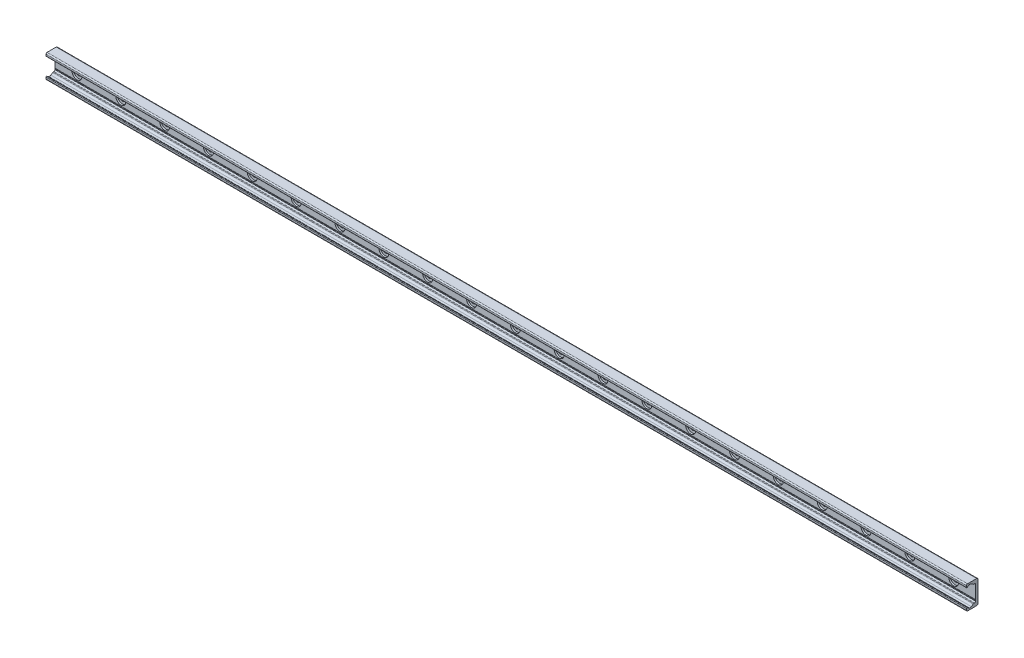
ISO-10303-21;
HEADER;
FILE_DESCRIPTION(('STEP AP214'),'2;1');
FILE_NAME('part.step','',(''),(''),'','','');
FILE_SCHEMA(('AUTOMOTIVE_DESIGN { 1 0 10303 214 1 1 1 1 }'));
ENDSEC;
DATA;
#1=APPLICATION_CONTEXT('core data for automotive mechanical design processes');
#2=APPLICATION_PROTOCOL_DEFINITION('international standard','automotive_design',2000,#1);
#3=PRODUCT_CONTEXT('',#1,'mechanical');
#4=PRODUCT('Part','Part','',(#3));
#5=PRODUCT_RELATED_PRODUCT_CATEGORY('part','',(#4));
#6=PRODUCT_DEFINITION_FORMATION('','',#4);
#7=PRODUCT_DEFINITION_CONTEXT('part definition',#1,'design');
#8=PRODUCT_DEFINITION('design','',#6,#7);
#9=PRODUCT_DEFINITION_SHAPE('','',#8);
#10=(LENGTH_UNIT() NAMED_UNIT(*) SI_UNIT(.MILLI.,.METRE.));
#11=(NAMED_UNIT(*) PLANE_ANGLE_UNIT() SI_UNIT($,.RADIAN.));
#12=(NAMED_UNIT(*) SI_UNIT($,.STERADIAN.) SOLID_ANGLE_UNIT());
#13=UNCERTAINTY_MEASURE_WITH_UNIT(LENGTH_MEASURE(1.E-05),#10,'distance_accuracy_value','');
#14=(GEOMETRIC_REPRESENTATION_CONTEXT(3) GLOBAL_UNCERTAINTY_ASSIGNED_CONTEXT((#13)) GLOBAL_UNIT_ASSIGNED_CONTEXT((#10,
#11,#12)) REPRESENTATION_CONTEXT('',''));
#15=CARTESIAN_POINT('',(0.,0.,0.));
#16=DIRECTION('',(0.,0.,1.));
#17=DIRECTION('',(1.,0.,0.));
#18=AXIS2_PLACEMENT_3D('',#15,#16,#17);
#19=CARTESIAN_POINT('',(-800.,0.,1.39999999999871));
#20=DIRECTION('',(0.,0.,1.));
#21=DIRECTION('',(1.,0.,0.));
#22=AXIS2_PLACEMENT_3D('',#19,#20,#21);
#23=PLANE('',#22);
#24=CARTESIAN_POINT('',(-800.,0.,1.39999999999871));
#25=DIRECTION('',(0.,0.,1.));
#26=DIRECTION('',(1.,0.,0.));
#27=AXIS2_PLACEMENT_3D('',#24,#25,#26);
#28=CIRCLE('',#27,4.49999999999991);
#29=CARTESIAN_POINT('',(-795.5,0.,1.39999999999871));
#30=VERTEX_POINT('',#29);
#31=EDGE_CURVE('E625',#30,#30,#28,.T.);
#32=ORIENTED_EDGE('',*,*,#31,.F.);
#33=EDGE_LOOP('',(#32));
#34=FACE_BOUND('',#33,.T.);
#35=CARTESIAN_POINT('',(-800.,0.,1.39999999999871));
#36=DIRECTION('',(0.,0.,1.));
#37=DIRECTION('',(1.,0.,0.));
#38=AXIS2_PLACEMENT_3D('',#35,#36,#37);
#39=CIRCLE('',#38,9.00000000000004);
#40=CARTESIAN_POINT('',(-791.,0.,1.39999999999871));
#41=VERTEX_POINT('',#40);
#42=EDGE_CURVE('E11',#41,#41,#39,.T.);
#43=ORIENTED_EDGE('',*,*,#42,.T.);
#44=EDGE_LOOP('',(#43));
#45=FACE_BOUND('',#44,.T.);
#46=ADVANCED_FACE('F39',(#34,#45),#23,.T.);
#47=CARTESIAN_POINT('',(-800.,0.,1.39999999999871));
#48=DIRECTION('',(0.,0.,1.));
#49=DIRECTION('',(1.,0.,0.));
#50=AXIS2_PLACEMENT_3D('',#47,#48,#49);
#51=CYLINDRICAL_SURFACE('',#50,9.00000000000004);
#52=CARTESIAN_POINT('',(-800.,0.,4.49999999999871));
#53=DIRECTION('',(0.,0.,1.));
#54=DIRECTION('',(1.,0.,0.));
#55=AXIS2_PLACEMENT_3D('',#52,#53,#54);
#56=CIRCLE('',#55,9.00000000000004);
#57=CARTESIAN_POINT('',(-791.,0.,4.49999999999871));
#58=VERTEX_POINT('',#57);
#59=EDGE_CURVE('E49',#58,#58,#56,.T.);
#60=CARTESIAN_POINT('',(-791.,0.,1.39999999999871));
#61=CARTESIAN_POINT('',(-791.,0.,1.43229166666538));
#62=CARTESIAN_POINT('',(-791.,0.,1.46458333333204));
#63=CARTESIAN_POINT('',(-791.,0.,1.52916666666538));
#64=CARTESIAN_POINT('',(-791.,0.,1.56145833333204));
#65=CARTESIAN_POINT('',(-791.,0.,1.62604166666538));
#66=CARTESIAN_POINT('',(-791.,0.,1.65833333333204));
#67=CARTESIAN_POINT('',(-791.,0.,1.72291666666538));
#68=CARTESIAN_POINT('',(-791.,0.,1.75520833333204));
#69=CARTESIAN_POINT('',(-791.,0.,1.81979166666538));
#70=CARTESIAN_POINT('',(-791.,0.,1.85208333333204));
#71=CARTESIAN_POINT('',(-791.,0.,1.91666666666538));
#72=CARTESIAN_POINT('',(-791.,0.,1.94895833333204));
#73=CARTESIAN_POINT('',(-791.,0.,2.01354166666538));
#74=CARTESIAN_POINT('',(-791.,0.,2.04583333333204));
#75=CARTESIAN_POINT('',(-791.,0.,2.11041666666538));
#76=CARTESIAN_POINT('',(-791.,0.,2.14270833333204));
#77=CARTESIAN_POINT('',(-791.,0.,2.20729166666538));
#78=CARTESIAN_POINT('',(-791.,0.,2.23958333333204));
#79=CARTESIAN_POINT('',(-791.,0.,2.30416666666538));
#80=CARTESIAN_POINT('',(-791.,0.,2.33645833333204));
#81=CARTESIAN_POINT('',(-791.,0.,2.40104166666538));
#82=CARTESIAN_POINT('',(-791.,0.,2.43333333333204));
#83=CARTESIAN_POINT('',(-791.,0.,2.49791666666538));
#84=CARTESIAN_POINT('',(-791.,0.,2.53020833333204));
#85=CARTESIAN_POINT('',(-791.,0.,2.59479166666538));
#86=CARTESIAN_POINT('',(-791.,0.,2.62708333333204));
#87=CARTESIAN_POINT('',(-791.,0.,2.69166666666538));
#88=CARTESIAN_POINT('',(-791.,0.,2.72395833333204));
#89=CARTESIAN_POINT('',(-791.,0.,2.78854166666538));
#90=CARTESIAN_POINT('',(-791.,0.,2.82083333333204));
#91=CARTESIAN_POINT('',(-791.,0.,2.88541666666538));
#92=CARTESIAN_POINT('',(-791.,0.,2.91770833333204));
#93=CARTESIAN_POINT('',(-791.,0.,2.98229166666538));
#94=CARTESIAN_POINT('',(-791.,0.,3.01458333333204));
#95=CARTESIAN_POINT('',(-791.,0.,3.07916666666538));
#96=CARTESIAN_POINT('',(-791.,0.,3.11145833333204));
#97=CARTESIAN_POINT('',(-791.,0.,3.17604166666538));
#98=CARTESIAN_POINT('',(-791.,0.,3.20833333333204));
#99=CARTESIAN_POINT('',(-791.,0.,3.27291666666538));
#100=CARTESIAN_POINT('',(-791.,0.,3.30520833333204));
#101=CARTESIAN_POINT('',(-791.,0.,3.36979166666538));
#102=CARTESIAN_POINT('',(-791.,0.,3.40208333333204));
#103=CARTESIAN_POINT('',(-791.,0.,3.46666666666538));
#104=CARTESIAN_POINT('',(-791.,0.,3.49895833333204));
#105=CARTESIAN_POINT('',(-791.,0.,3.56354166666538));
#106=CARTESIAN_POINT('',(-791.,0.,3.59583333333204));
#107=CARTESIAN_POINT('',(-791.,0.,3.66041666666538));
#108=CARTESIAN_POINT('',(-791.,0.,3.69270833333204));
#109=CARTESIAN_POINT('',(-791.,0.,3.75729166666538));
#110=CARTESIAN_POINT('',(-791.,0.,3.78958333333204));
#111=CARTESIAN_POINT('',(-791.,0.,3.85416666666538));
#112=CARTESIAN_POINT('',(-791.,0.,3.88645833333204));
#113=CARTESIAN_POINT('',(-791.,0.,3.95104166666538));
#114=CARTESIAN_POINT('',(-791.,0.,3.98333333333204));
#115=CARTESIAN_POINT('',(-791.,0.,4.04791666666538));
#116=CARTESIAN_POINT('',(-791.,0.,4.08020833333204));
#117=CARTESIAN_POINT('',(-791.,0.,4.14479166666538));
#118=CARTESIAN_POINT('',(-791.,0.,4.17708333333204));
#119=CARTESIAN_POINT('',(-791.,0.,4.24166666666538));
#120=CARTESIAN_POINT('',(-791.,0.,4.27395833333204));
#121=CARTESIAN_POINT('',(-791.,0.,4.33854166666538));
#122=CARTESIAN_POINT('',(-791.,0.,4.37083333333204));
#123=CARTESIAN_POINT('',(-791.,0.,4.43541666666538));
#124=CARTESIAN_POINT('',(-791.,0.,4.46770833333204));
#125=CARTESIAN_POINT('',(-791.,0.,4.49999999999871));
#126=B_SPLINE_CURVE_WITH_KNOTS('',3,(#60,#61,#62,#63,#64,#65,#66,#67,#68,#69,#70,#71,#72,#73,
#74,#75,#76,#77,#78,#79,#80,#81,#82,#83,#84,#85,#86,#87,#88,#89,#90,#91,#92,#93,#94,#95,#96,#97,
#98,#99,#100,#101,#102,#103,#104,#105,#106,#107,#108,#109,#110,#111,#112,#113,#114,#115,#116,
#117,#118,#119,#120,#121,#122,#123,#124,#125),.UNSPECIFIED.,.F.,.F.,(4,2,2,2,2,2,2,2,2,2,2,2,2,
2,2,2,2,2,2,2,2,2,2,2,2,2,2,2,2,2,2,2,4),(0.,0.0968750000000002,0.19375,0.290625,0.3875,
0.484375,0.58125,0.678125,0.775,0.871875,0.96875,1.065625,1.1625,1.259375,1.35625,1.453125,1.55,
1.646875,1.74375,1.840625,1.9375,2.034375,2.13125,2.228125,2.325,2.421875,2.51875,2.615625,
2.7125,2.809375,2.90625,3.003125,3.1),.UNSPECIFIED.);
#127=EDGE_CURVE('BSEAM595',#41,#58,#126,.T.);
#128=ORIENTED_EDGE('',*,*,#42,.F.);
#129=ORIENTED_EDGE('',*,*,#59,.T.);
#130=ORIENTED_EDGE('',*,*,#127,.T.);
#131=ORIENTED_EDGE('',*,*,#127,.F.);
#132=EDGE_LOOP('',(#128,#130,#129,#131));
#133=FACE_BOUND('',#132,.T.);
#134=ADVANCED_FACE('F595',(#133),#51,.F.);
#135=CARTESIAN_POINT('',(-720.,0.,1.39999999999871));
#136=DIRECTION('',(0.,0.,1.));
#137=DIRECTION('',(1.,0.,0.));
#138=AXIS2_PLACEMENT_3D('',#135,#136,#137);
#139=PLANE('',#138);
#140=CARTESIAN_POINT('',(-720.,0.,1.39999999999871));
#141=DIRECTION('',(0.,0.,1.));
#142=DIRECTION('',(1.,0.,0.));
#143=AXIS2_PLACEMENT_3D('',#140,#141,#142);
#144=CIRCLE('',#143,4.49999999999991);
#145=CARTESIAN_POINT('',(-715.5,0.,1.39999999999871));
#146=VERTEX_POINT('',#145);
#147=EDGE_CURVE('E629',#146,#146,#144,.T.);
#148=ORIENTED_EDGE('',*,*,#147,.F.);
#149=EDGE_LOOP('',(#148));
#150=FACE_BOUND('',#149,.T.);
#151=CARTESIAN_POINT('',(-720.,0.,1.39999999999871));
#152=DIRECTION('',(0.,0.,1.));
#153=DIRECTION('',(1.,0.,0.));
#154=AXIS2_PLACEMENT_3D('',#151,#152,#153);
#155=CIRCLE('',#154,9.00000000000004);
#156=CARTESIAN_POINT('',(-711.,0.,1.39999999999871));
#157=VERTEX_POINT('',#156);
#158=EDGE_CURVE('E587',#157,#157,#155,.T.);
#159=ORIENTED_EDGE('',*,*,#158,.T.);
#160=EDGE_LOOP('',(#159));
#161=FACE_BOUND('',#160,.T.);
#162=ADVANCED_FACE('F620',(#150,#161),#139,.T.);
#163=CARTESIAN_POINT('',(-720.,0.,1.39999999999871));
#164=DIRECTION('',(0.,0.,1.));
#165=DIRECTION('',(1.,0.,0.));
#166=AXIS2_PLACEMENT_3D('',#163,#164,#165);
#167=CYLINDRICAL_SURFACE('',#166,9.00000000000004);
#168=CARTESIAN_POINT('',(-720.,0.,4.49999999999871));
#169=DIRECTION('',(0.,0.,1.));
#170=DIRECTION('',(1.,0.,0.));
#171=AXIS2_PLACEMENT_3D('',#168,#169,#170);
#172=CIRCLE('',#171,9.00000000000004);
#173=CARTESIAN_POINT('',(-711.,0.,4.49999999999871));
#174=VERTEX_POINT('',#173);
#175=EDGE_CURVE('E583',#174,#174,#172,.T.);
#176=CARTESIAN_POINT('',(-711.,0.,1.39999999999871));
#177=CARTESIAN_POINT('',(-711.,0.,1.43229166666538));
#178=CARTESIAN_POINT('',(-711.,0.,1.46458333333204));
#179=CARTESIAN_POINT('',(-711.,0.,1.52916666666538));
#180=CARTESIAN_POINT('',(-711.,0.,1.56145833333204));
#181=CARTESIAN_POINT('',(-711.,0.,1.62604166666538));
#182=CARTESIAN_POINT('',(-711.,0.,1.65833333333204));
#183=CARTESIAN_POINT('',(-711.,0.,1.72291666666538));
#184=CARTESIAN_POINT('',(-711.,0.,1.75520833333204));
#185=CARTESIAN_POINT('',(-711.,0.,1.81979166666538));
#186=CARTESIAN_POINT('',(-711.,0.,1.85208333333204));
#187=CARTESIAN_POINT('',(-711.,0.,1.91666666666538));
#188=CARTESIAN_POINT('',(-711.,0.,1.94895833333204));
#189=CARTESIAN_POINT('',(-711.,0.,2.01354166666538));
#190=CARTESIAN_POINT('',(-711.,0.,2.04583333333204));
#191=CARTESIAN_POINT('',(-711.,0.,2.11041666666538));
#192=CARTESIAN_POINT('',(-711.,0.,2.14270833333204));
#193=CARTESIAN_POINT('',(-711.,0.,2.20729166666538));
#194=CARTESIAN_POINT('',(-711.,0.,2.23958333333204));
#195=CARTESIAN_POINT('',(-711.,0.,2.30416666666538));
#196=CARTESIAN_POINT('',(-711.,0.,2.33645833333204));
#197=CARTESIAN_POINT('',(-711.,0.,2.40104166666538));
#198=CARTESIAN_POINT('',(-711.,0.,2.43333333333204));
#199=CARTESIAN_POINT('',(-711.,0.,2.49791666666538));
#200=CARTESIAN_POINT('',(-711.,0.,2.53020833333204));
#201=CARTESIAN_POINT('',(-711.,0.,2.59479166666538));
#202=CARTESIAN_POINT('',(-711.,0.,2.62708333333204));
#203=CARTESIAN_POINT('',(-711.,0.,2.69166666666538));
#204=CARTESIAN_POINT('',(-711.,0.,2.72395833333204));
#205=CARTESIAN_POINT('',(-711.,0.,2.78854166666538));
#206=CARTESIAN_POINT('',(-711.,0.,2.82083333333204));
#207=CARTESIAN_POINT('',(-711.,0.,2.88541666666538));
#208=CARTESIAN_POINT('',(-711.,0.,2.91770833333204));
#209=CARTESIAN_POINT('',(-711.,0.,2.98229166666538));
#210=CARTESIAN_POINT('',(-711.,0.,3.01458333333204));
#211=CARTESIAN_POINT('',(-711.,0.,3.07916666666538));
#212=CARTESIAN_POINT('',(-711.,0.,3.11145833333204));
#213=CARTESIAN_POINT('',(-711.,0.,3.17604166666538));
#214=CARTESIAN_POINT('',(-711.,0.,3.20833333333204));
#215=CARTESIAN_POINT('',(-711.,0.,3.27291666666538));
#216=CARTESIAN_POINT('',(-711.,0.,3.30520833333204));
#217=CARTESIAN_POINT('',(-711.,0.,3.36979166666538));
#218=CARTESIAN_POINT('',(-711.,0.,3.40208333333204));
#219=CARTESIAN_POINT('',(-711.,0.,3.46666666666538));
#220=CARTESIAN_POINT('',(-711.,0.,3.49895833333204));
#221=CARTESIAN_POINT('',(-711.,0.,3.56354166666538));
#222=CARTESIAN_POINT('',(-711.,0.,3.59583333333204));
#223=CARTESIAN_POINT('',(-711.,0.,3.66041666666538));
#224=CARTESIAN_POINT('',(-711.,0.,3.69270833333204));
#225=CARTESIAN_POINT('',(-711.,0.,3.75729166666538));
#226=CARTESIAN_POINT('',(-711.,0.,3.78958333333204));
#227=CARTESIAN_POINT('',(-711.,0.,3.85416666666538));
#228=CARTESIAN_POINT('',(-711.,0.,3.88645833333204));
#229=CARTESIAN_POINT('',(-711.,0.,3.95104166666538));
#230=CARTESIAN_POINT('',(-711.,0.,3.98333333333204));
#231=CARTESIAN_POINT('',(-711.,0.,4.04791666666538));
#232=CARTESIAN_POINT('',(-711.,0.,4.08020833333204));
#233=CARTESIAN_POINT('',(-711.,0.,4.14479166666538));
#234=CARTESIAN_POINT('',(-711.,0.,4.17708333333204));
#235=CARTESIAN_POINT('',(-711.,0.,4.24166666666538));
#236=CARTESIAN_POINT('',(-711.,0.,4.27395833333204));
#237=CARTESIAN_POINT('',(-711.,0.,4.33854166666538));
#238=CARTESIAN_POINT('',(-711.,0.,4.37083333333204));
#239=CARTESIAN_POINT('',(-711.,0.,4.43541666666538));
#240=CARTESIAN_POINT('',(-711.,0.,4.46770833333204));
#241=CARTESIAN_POINT('',(-711.,0.,4.49999999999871));
#242=B_SPLINE_CURVE_WITH_KNOTS('',3,(#176,#177,#178,#179,#180,#181,#182,#183,#184,#185,#186,
#187,#188,#189,#190,#191,#192,#193,#194,#195,#196,#197,#198,#199,#200,#201,#202,#203,#204,#205,
#206,#207,#208,#209,#210,#211,#212,#213,#214,#215,#216,#217,#218,#219,#220,#221,#222,#223,#224,
#225,#226,#227,#228,#229,#230,#231,#232,#233,#234,#235,#236,#237,#238,#239,#240,#241),
.UNSPECIFIED.,.F.,.F.,(4,2,2,2,2,2,2,2,2,2,2,2,2,2,2,2,2,2,2,2,2,2,2,2,2,2,2,2,2,2,2,2,4),(0.,
0.0968750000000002,0.19375,0.290625,0.3875,0.484375,0.58125,0.678125,0.775,0.871875,0.96875,
1.065625,1.1625,1.259375,1.35625,1.453125,1.55,1.646875,1.74375,1.840625,1.9375,2.034375,
2.13125,2.228125,2.325,2.421875,2.51875,2.615625,2.7125,2.809375,2.90625,3.003125,3.1),.UNSPECIFIED.);
#243=EDGE_CURVE('BSEAM1196',#157,#174,#242,.T.);
#244=ORIENTED_EDGE('',*,*,#158,.F.);
#245=ORIENTED_EDGE('',*,*,#175,.T.);
#246=ORIENTED_EDGE('',*,*,#243,.T.);
#247=ORIENTED_EDGE('',*,*,#243,.F.);
#248=EDGE_LOOP('',(#244,#246,#245,#247));
#249=FACE_BOUND('',#248,.T.);
#250=ADVANCED_FACE('F1196',(#249),#167,.F.);
#251=CARTESIAN_POINT('',(-640.,0.,1.39999999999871));
#252=DIRECTION('',(0.,0.,1.));
#253=DIRECTION('',(1.,0.,0.));
#254=AXIS2_PLACEMENT_3D('',#251,#252,#253);
#255=PLANE('',#254);
#256=CARTESIAN_POINT('',(-640.,0.,1.39999999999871));
#257=DIRECTION('',(0.,0.,1.));
#258=DIRECTION('',(1.,0.,0.));
#259=AXIS2_PLACEMENT_3D('',#256,#257,#258);
#260=CIRCLE('',#259,4.49999999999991);
#261=CARTESIAN_POINT('',(-635.5,0.,1.39999999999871));
#262=VERTEX_POINT('',#261);
#263=EDGE_CURVE('E633',#262,#262,#260,.T.);
#264=ORIENTED_EDGE('',*,*,#263,.F.);
#265=EDGE_LOOP('',(#264));
#266=FACE_BOUND('',#265,.T.);
#267=CARTESIAN_POINT('',(-640.,0.,1.39999999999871));
#268=DIRECTION('',(0.,0.,1.));
#269=DIRECTION('',(1.,0.,0.));
#270=AXIS2_PLACEMENT_3D('',#267,#268,#269);
#271=CIRCLE('',#270,9.00000000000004);
#272=CARTESIAN_POINT('',(-631.,0.,1.39999999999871));
#273=VERTEX_POINT('',#272);
#274=EDGE_CURVE('E579',#273,#273,#271,.T.);
#275=ORIENTED_EDGE('',*,*,#274,.T.);
#276=EDGE_LOOP('',(#275));
#277=FACE_BOUND('',#276,.T.);
#278=ADVANCED_FACE('F1192',(#266,#277),#255,.T.);
#279=CARTESIAN_POINT('',(-640.,0.,1.39999999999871));
#280=DIRECTION('',(0.,0.,1.));
#281=DIRECTION('',(1.,0.,0.));
#282=AXIS2_PLACEMENT_3D('',#279,#280,#281);
#283=CYLINDRICAL_SURFACE('',#282,9.00000000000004);
#284=CARTESIAN_POINT('',(-640.,0.,4.49999999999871));
#285=DIRECTION('',(0.,0.,1.));
#286=DIRECTION('',(1.,0.,0.));
#287=AXIS2_PLACEMENT_3D('',#284,#285,#286);
#288=CIRCLE('',#287,9.00000000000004);
#289=CARTESIAN_POINT('',(-631.,0.,4.49999999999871));
#290=VERTEX_POINT('',#289);
#291=EDGE_CURVE('E575',#290,#290,#288,.T.);
#292=CARTESIAN_POINT('',(-631.,0.,1.39999999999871));
#293=CARTESIAN_POINT('',(-631.,0.,1.43229166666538));
#294=CARTESIAN_POINT('',(-631.,0.,1.46458333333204));
#295=CARTESIAN_POINT('',(-631.,0.,1.52916666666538));
#296=CARTESIAN_POINT('',(-631.,0.,1.56145833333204));
#297=CARTESIAN_POINT('',(-631.,0.,1.62604166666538));
#298=CARTESIAN_POINT('',(-631.,0.,1.65833333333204));
#299=CARTESIAN_POINT('',(-631.,0.,1.72291666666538));
#300=CARTESIAN_POINT('',(-631.,0.,1.75520833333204));
#301=CARTESIAN_POINT('',(-631.,0.,1.81979166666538));
#302=CARTESIAN_POINT('',(-631.,0.,1.85208333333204));
#303=CARTESIAN_POINT('',(-631.,0.,1.91666666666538));
#304=CARTESIAN_POINT('',(-631.,0.,1.94895833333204));
#305=CARTESIAN_POINT('',(-631.,0.,2.01354166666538));
#306=CARTESIAN_POINT('',(-631.,0.,2.04583333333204));
#307=CARTESIAN_POINT('',(-631.,0.,2.11041666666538));
#308=CARTESIAN_POINT('',(-631.,0.,2.14270833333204));
#309=CARTESIAN_POINT('',(-631.,0.,2.20729166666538));
#310=CARTESIAN_POINT('',(-631.,0.,2.23958333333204));
#311=CARTESIAN_POINT('',(-631.,0.,2.30416666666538));
#312=CARTESIAN_POINT('',(-631.,0.,2.33645833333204));
#313=CARTESIAN_POINT('',(-631.,0.,2.40104166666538));
#314=CARTESIAN_POINT('',(-631.,0.,2.43333333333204));
#315=CARTESIAN_POINT('',(-631.,0.,2.49791666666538));
#316=CARTESIAN_POINT('',(-631.,0.,2.53020833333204));
#317=CARTESIAN_POINT('',(-631.,0.,2.59479166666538));
#318=CARTESIAN_POINT('',(-631.,0.,2.62708333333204));
#319=CARTESIAN_POINT('',(-631.,0.,2.69166666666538));
#320=CARTESIAN_POINT('',(-631.,0.,2.72395833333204));
#321=CARTESIAN_POINT('',(-631.,0.,2.78854166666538));
#322=CARTESIAN_POINT('',(-631.,0.,2.82083333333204));
#323=CARTESIAN_POINT('',(-631.,0.,2.88541666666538));
#324=CARTESIAN_POINT('',(-631.,0.,2.91770833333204));
#325=CARTESIAN_POINT('',(-631.,0.,2.98229166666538));
#326=CARTESIAN_POINT('',(-631.,0.,3.01458333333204));
#327=CARTESIAN_POINT('',(-631.,0.,3.07916666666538));
#328=CARTESIAN_POINT('',(-631.,0.,3.11145833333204));
#329=CARTESIAN_POINT('',(-631.,0.,3.17604166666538));
#330=CARTESIAN_POINT('',(-631.,0.,3.20833333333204));
#331=CARTESIAN_POINT('',(-631.,0.,3.27291666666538));
#332=CARTESIAN_POINT('',(-631.,0.,3.30520833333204));
#333=CARTESIAN_POINT('',(-631.,0.,3.36979166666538));
#334=CARTESIAN_POINT('',(-631.,0.,3.40208333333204));
#335=CARTESIAN_POINT('',(-631.,0.,3.46666666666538));
#336=CARTESIAN_POINT('',(-631.,0.,3.49895833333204));
#337=CARTESIAN_POINT('',(-631.,0.,3.56354166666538));
#338=CARTESIAN_POINT('',(-631.,0.,3.59583333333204));
#339=CARTESIAN_POINT('',(-631.,0.,3.66041666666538));
#340=CARTESIAN_POINT('',(-631.,0.,3.69270833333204));
#341=CARTESIAN_POINT('',(-631.,0.,3.75729166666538));
#342=CARTESIAN_POINT('',(-631.,0.,3.78958333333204));
#343=CARTESIAN_POINT('',(-631.,0.,3.85416666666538));
#344=CARTESIAN_POINT('',(-631.,0.,3.88645833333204));
#345=CARTESIAN_POINT('',(-631.,0.,3.95104166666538));
#346=CARTESIAN_POINT('',(-631.,0.,3.98333333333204));
#347=CARTESIAN_POINT('',(-631.,0.,4.04791666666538));
#348=CARTESIAN_POINT('',(-631.,0.,4.08020833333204));
#349=CARTESIAN_POINT('',(-631.,0.,4.14479166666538));
#350=CARTESIAN_POINT('',(-631.,0.,4.17708333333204));
#351=CARTESIAN_POINT('',(-631.,0.,4.24166666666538));
#352=CARTESIAN_POINT('',(-631.,0.,4.27395833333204));
#353=CARTESIAN_POINT('',(-631.,0.,4.33854166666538));
#354=CARTESIAN_POINT('',(-631.,0.,4.37083333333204));
#355=CARTESIAN_POINT('',(-631.,0.,4.43541666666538));
#356=CARTESIAN_POINT('',(-631.,0.,4.46770833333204));
#357=CARTESIAN_POINT('',(-631.,0.,4.49999999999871));
#358=B_SPLINE_CURVE_WITH_KNOTS('',3,(#292,#293,#294,#295,#296,#297,#298,#299,#300,#301,#302,
#303,#304,#305,#306,#307,#308,#309,#310,#311,#312,#313,#314,#315,#316,#317,#318,#319,#320,#321,
#322,#323,#324,#325,#326,#327,#328,#329,#330,#331,#332,#333,#334,#335,#336,#337,#338,#339,#340,
#341,#342,#343,#344,#345,#346,#347,#348,#349,#350,#351,#352,#353,#354,#355,#356,#357),
.UNSPECIFIED.,.F.,.F.,(4,2,2,2,2,2,2,2,2,2,2,2,2,2,2,2,2,2,2,2,2,2,2,2,2,2,2,2,2,2,2,2,4),(0.,
0.0968750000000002,0.19375,0.290625,0.3875,0.484375,0.58125,0.678125,0.775,0.871875,0.96875,
1.065625,1.1625,1.259375,1.35625,1.453125,1.55,1.646875,1.74375,1.840625,1.9375,2.034375,
2.13125,2.228125,2.325,2.421875,2.51875,2.615625,2.7125,2.809375,2.90625,3.003125,3.1),.UNSPECIFIED.);
#359=EDGE_CURVE('BSEAM1188',#273,#290,#358,.T.);
#360=ORIENTED_EDGE('',*,*,#274,.F.);
#361=ORIENTED_EDGE('',*,*,#291,.T.);
#362=ORIENTED_EDGE('',*,*,#359,.T.);
#363=ORIENTED_EDGE('',*,*,#359,.F.);
#364=EDGE_LOOP('',(#360,#362,#361,#363));
#365=FACE_BOUND('',#364,.T.);
#366=ADVANCED_FACE('F1188',(#365),#283,.F.);
#367=CARTESIAN_POINT('',(-560.,0.,1.39999999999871));
#368=DIRECTION('',(0.,0.,1.));
#369=DIRECTION('',(1.,0.,0.));
#370=AXIS2_PLACEMENT_3D('',#367,#368,#369);
#371=PLANE('',#370);
#372=CARTESIAN_POINT('',(-560.,0.,1.39999999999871));
#373=DIRECTION('',(0.,0.,1.));
#374=DIRECTION('',(1.,0.,0.));
#375=AXIS2_PLACEMENT_3D('',#372,#373,#374);
#376=CIRCLE('',#375,4.49999999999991);
#377=CARTESIAN_POINT('',(-555.5,0.,1.39999999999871));
#378=VERTEX_POINT('',#377);
#379=EDGE_CURVE('E645',#378,#378,#376,.T.);
#380=ORIENTED_EDGE('',*,*,#379,.F.);
#381=EDGE_LOOP('',(#380));
#382=FACE_BOUND('',#381,.T.);
#383=CARTESIAN_POINT('',(-560.,0.,1.39999999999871));
#384=DIRECTION('',(0.,0.,1.));
#385=DIRECTION('',(1.,0.,0.));
#386=AXIS2_PLACEMENT_3D('',#383,#384,#385);
#387=CIRCLE('',#386,9.00000000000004);
#388=CARTESIAN_POINT('',(-551.,0.,1.39999999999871));
#389=VERTEX_POINT('',#388);
#390=EDGE_CURVE('E571',#389,#389,#387,.T.);
#391=ORIENTED_EDGE('',*,*,#390,.T.);
#392=EDGE_LOOP('',(#391));
#393=FACE_BOUND('',#392,.T.);
#394=ADVANCED_FACE('F1184',(#382,#393),#371,.T.);
#395=CARTESIAN_POINT('',(-560.,0.,1.39999999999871));
#396=DIRECTION('',(0.,0.,1.));
#397=DIRECTION('',(1.,0.,0.));
#398=AXIS2_PLACEMENT_3D('',#395,#396,#397);
#399=CYLINDRICAL_SURFACE('',#398,9.00000000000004);
#400=CARTESIAN_POINT('',(-560.,0.,4.49999999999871));
#401=DIRECTION('',(0.,0.,1.));
#402=DIRECTION('',(1.,0.,0.));
#403=AXIS2_PLACEMENT_3D('',#400,#401,#402);
#404=CIRCLE('',#403,9.00000000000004);
#405=CARTESIAN_POINT('',(-551.,0.,4.49999999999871));
#406=VERTEX_POINT('',#405);
#407=EDGE_CURVE('E567',#406,#406,#404,.T.);
#408=CARTESIAN_POINT('',(-551.,0.,1.39999999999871));
#409=CARTESIAN_POINT('',(-551.,0.,1.43229166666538));
#410=CARTESIAN_POINT('',(-551.,0.,1.46458333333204));
#411=CARTESIAN_POINT('',(-551.,0.,1.52916666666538));
#412=CARTESIAN_POINT('',(-551.,0.,1.56145833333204));
#413=CARTESIAN_POINT('',(-551.,0.,1.62604166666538));
#414=CARTESIAN_POINT('',(-551.,0.,1.65833333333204));
#415=CARTESIAN_POINT('',(-551.,0.,1.72291666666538));
#416=CARTESIAN_POINT('',(-551.,0.,1.75520833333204));
#417=CARTESIAN_POINT('',(-551.,0.,1.81979166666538));
#418=CARTESIAN_POINT('',(-551.,0.,1.85208333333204));
#419=CARTESIAN_POINT('',(-551.,0.,1.91666666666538));
#420=CARTESIAN_POINT('',(-551.,0.,1.94895833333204));
#421=CARTESIAN_POINT('',(-551.,0.,2.01354166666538));
#422=CARTESIAN_POINT('',(-551.,0.,2.04583333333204));
#423=CARTESIAN_POINT('',(-551.,0.,2.11041666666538));
#424=CARTESIAN_POINT('',(-551.,0.,2.14270833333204));
#425=CARTESIAN_POINT('',(-551.,0.,2.20729166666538));
#426=CARTESIAN_POINT('',(-551.,0.,2.23958333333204));
#427=CARTESIAN_POINT('',(-551.,0.,2.30416666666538));
#428=CARTESIAN_POINT('',(-551.,0.,2.33645833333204));
#429=CARTESIAN_POINT('',(-551.,0.,2.40104166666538));
#430=CARTESIAN_POINT('',(-551.,0.,2.43333333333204));
#431=CARTESIAN_POINT('',(-551.,0.,2.49791666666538));
#432=CARTESIAN_POINT('',(-551.,0.,2.53020833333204));
#433=CARTESIAN_POINT('',(-551.,0.,2.59479166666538));
#434=CARTESIAN_POINT('',(-551.,0.,2.62708333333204));
#435=CARTESIAN_POINT('',(-551.,0.,2.69166666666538));
#436=CARTESIAN_POINT('',(-551.,0.,2.72395833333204));
#437=CARTESIAN_POINT('',(-551.,0.,2.78854166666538));
#438=CARTESIAN_POINT('',(-551.,0.,2.82083333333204));
#439=CARTESIAN_POINT('',(-551.,0.,2.88541666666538));
#440=CARTESIAN_POINT('',(-551.,0.,2.91770833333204));
#441=CARTESIAN_POINT('',(-551.,0.,2.98229166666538));
#442=CARTESIAN_POINT('',(-551.,0.,3.01458333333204));
#443=CARTESIAN_POINT('',(-551.,0.,3.07916666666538));
#444=CARTESIAN_POINT('',(-551.,0.,3.11145833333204));
#445=CARTESIAN_POINT('',(-551.,0.,3.17604166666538));
#446=CARTESIAN_POINT('',(-551.,0.,3.20833333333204));
#447=CARTESIAN_POINT('',(-551.,0.,3.27291666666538));
#448=CARTESIAN_POINT('',(-551.,0.,3.30520833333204));
#449=CARTESIAN_POINT('',(-551.,0.,3.36979166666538));
#450=CARTESIAN_POINT('',(-551.,0.,3.40208333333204));
#451=CARTESIAN_POINT('',(-551.,0.,3.46666666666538));
#452=CARTESIAN_POINT('',(-551.,0.,3.49895833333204));
#453=CARTESIAN_POINT('',(-551.,0.,3.56354166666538));
#454=CARTESIAN_POINT('',(-551.,0.,3.59583333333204));
#455=CARTESIAN_POINT('',(-551.,0.,3.66041666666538));
#456=CARTESIAN_POINT('',(-551.,0.,3.69270833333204));
#457=CARTESIAN_POINT('',(-551.,0.,3.75729166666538));
#458=CARTESIAN_POINT('',(-551.,0.,3.78958333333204));
#459=CARTESIAN_POINT('',(-551.,0.,3.85416666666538));
#460=CARTESIAN_POINT('',(-551.,0.,3.88645833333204));
#461=CARTESIAN_POINT('',(-551.,0.,3.95104166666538));
#462=CARTESIAN_POINT('',(-551.,0.,3.98333333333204));
#463=CARTESIAN_POINT('',(-551.,0.,4.04791666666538));
#464=CARTESIAN_POINT('',(-551.,0.,4.08020833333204));
#465=CARTESIAN_POINT('',(-551.,0.,4.14479166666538));
#466=CARTESIAN_POINT('',(-551.,0.,4.17708333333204));
#467=CARTESIAN_POINT('',(-551.,0.,4.24166666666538));
#468=CARTESIAN_POINT('',(-551.,0.,4.27395833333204));
#469=CARTESIAN_POINT('',(-551.,0.,4.33854166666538));
#470=CARTESIAN_POINT('',(-551.,0.,4.37083333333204));
#471=CARTESIAN_POINT('',(-551.,0.,4.43541666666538));
#472=CARTESIAN_POINT('',(-551.,0.,4.46770833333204));
#473=CARTESIAN_POINT('',(-551.,0.,4.49999999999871));
#474=B_SPLINE_CURVE_WITH_KNOTS('',3,(#408,#409,#410,#411,#412,#413,#414,#415,#416,#417,#418,
#419,#420,#421,#422,#423,#424,#425,#426,#427,#428,#429,#430,#431,#432,#433,#434,#435,#436,#437,
#438,#439,#440,#441,#442,#443,#444,#445,#446,#447,#448,#449,#450,#451,#452,#453,#454,#455,#456,
#457,#458,#459,#460,#461,#462,#463,#464,#465,#466,#467,#468,#469,#470,#471,#472,#473),
.UNSPECIFIED.,.F.,.F.,(4,2,2,2,2,2,2,2,2,2,2,2,2,2,2,2,2,2,2,2,2,2,2,2,2,2,2,2,2,2,2,2,4),(0.,
0.0968750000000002,0.19375,0.290625,0.3875,0.484375,0.58125,0.678125,0.775,0.871875,0.96875,
1.065625,1.1625,1.259375,1.35625,1.453125,1.55,1.646875,1.74375,1.840625,1.9375,2.034375,
2.13125,2.228125,2.325,2.421875,2.51875,2.615625,2.7125,2.809375,2.90625,3.003125,3.1),.UNSPECIFIED.);
#475=EDGE_CURVE('BSEAM1180',#389,#406,#474,.T.);
#476=ORIENTED_EDGE('',*,*,#390,.F.);
#477=ORIENTED_EDGE('',*,*,#407,.T.);
#478=ORIENTED_EDGE('',*,*,#475,.T.);
#479=ORIENTED_EDGE('',*,*,#475,.F.);
#480=EDGE_LOOP('',(#476,#478,#477,#479));
#481=FACE_BOUND('',#480,.T.);
#482=ADVANCED_FACE('F1180',(#481),#399,.F.);
#483=CARTESIAN_POINT('',(-480.,0.,1.39999999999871));
#484=DIRECTION('',(0.,0.,1.));
#485=DIRECTION('',(1.,0.,0.));
#486=AXIS2_PLACEMENT_3D('',#483,#484,#485);
#487=PLANE('',#486);
#488=CARTESIAN_POINT('',(-480.,0.,1.39999999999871));
#489=DIRECTION('',(0.,0.,1.));
#490=DIRECTION('',(1.,0.,0.));
#491=AXIS2_PLACEMENT_3D('',#488,#489,#490);
#492=CIRCLE('',#491,4.49999999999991);
#493=CARTESIAN_POINT('',(-475.5,0.,1.39999999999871));
#494=VERTEX_POINT('',#493);
#495=EDGE_CURVE('E649',#494,#494,#492,.T.);
#496=ORIENTED_EDGE('',*,*,#495,.F.);
#497=EDGE_LOOP('',(#496));
#498=FACE_BOUND('',#497,.T.);
#499=CARTESIAN_POINT('',(-480.,0.,1.39999999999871));
#500=DIRECTION('',(0.,0.,1.));
#501=DIRECTION('',(1.,0.,0.));
#502=AXIS2_PLACEMENT_3D('',#499,#500,#501);
#503=CIRCLE('',#502,9.00000000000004);
#504=CARTESIAN_POINT('',(-471.,0.,1.39999999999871));
#505=VERTEX_POINT('',#504);
#506=EDGE_CURVE('E563',#505,#505,#503,.T.);
#507=ORIENTED_EDGE('',*,*,#506,.T.);
#508=EDGE_LOOP('',(#507));
#509=FACE_BOUND('',#508,.T.);
#510=ADVANCED_FACE('F1176',(#498,#509),#487,.T.);
#511=CARTESIAN_POINT('',(-480.,0.,1.39999999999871));
#512=DIRECTION('',(0.,0.,1.));
#513=DIRECTION('',(1.,0.,0.));
#514=AXIS2_PLACEMENT_3D('',#511,#512,#513);
#515=CYLINDRICAL_SURFACE('',#514,9.00000000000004);
#516=CARTESIAN_POINT('',(-480.,0.,4.49999999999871));
#517=DIRECTION('',(0.,0.,1.));
#518=DIRECTION('',(1.,0.,0.));
#519=AXIS2_PLACEMENT_3D('',#516,#517,#518);
#520=CIRCLE('',#519,9.00000000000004);
#521=CARTESIAN_POINT('',(-471.,0.,4.49999999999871));
#522=VERTEX_POINT('',#521);
#523=EDGE_CURVE('E559',#522,#522,#520,.T.);
#524=CARTESIAN_POINT('',(-471.,0.,1.39999999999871));
#525=CARTESIAN_POINT('',(-471.,0.,1.43229166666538));
#526=CARTESIAN_POINT('',(-471.,0.,1.46458333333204));
#527=CARTESIAN_POINT('',(-471.,0.,1.52916666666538));
#528=CARTESIAN_POINT('',(-471.,0.,1.56145833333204));
#529=CARTESIAN_POINT('',(-471.,0.,1.62604166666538));
#530=CARTESIAN_POINT('',(-471.,0.,1.65833333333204));
#531=CARTESIAN_POINT('',(-471.,0.,1.72291666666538));
#532=CARTESIAN_POINT('',(-471.,0.,1.75520833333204));
#533=CARTESIAN_POINT('',(-471.,0.,1.81979166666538));
#534=CARTESIAN_POINT('',(-471.,0.,1.85208333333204));
#535=CARTESIAN_POINT('',(-471.,0.,1.91666666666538));
#536=CARTESIAN_POINT('',(-471.,0.,1.94895833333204));
#537=CARTESIAN_POINT('',(-471.,0.,2.01354166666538));
#538=CARTESIAN_POINT('',(-471.,0.,2.04583333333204));
#539=CARTESIAN_POINT('',(-471.,0.,2.11041666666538));
#540=CARTESIAN_POINT('',(-471.,0.,2.14270833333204));
#541=CARTESIAN_POINT('',(-471.,0.,2.20729166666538));
#542=CARTESIAN_POINT('',(-471.,0.,2.23958333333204));
#543=CARTESIAN_POINT('',(-471.,0.,2.30416666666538));
#544=CARTESIAN_POINT('',(-471.,0.,2.33645833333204));
#545=CARTESIAN_POINT('',(-471.,0.,2.40104166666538));
#546=CARTESIAN_POINT('',(-471.,0.,2.43333333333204));
#547=CARTESIAN_POINT('',(-471.,0.,2.49791666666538));
#548=CARTESIAN_POINT('',(-471.,0.,2.53020833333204));
#549=CARTESIAN_POINT('',(-471.,0.,2.59479166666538));
#550=CARTESIAN_POINT('',(-471.,0.,2.62708333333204));
#551=CARTESIAN_POINT('',(-471.,0.,2.69166666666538));
#552=CARTESIAN_POINT('',(-471.,0.,2.72395833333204));
#553=CARTESIAN_POINT('',(-471.,0.,2.78854166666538));
#554=CARTESIAN_POINT('',(-471.,0.,2.82083333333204));
#555=CARTESIAN_POINT('',(-471.,0.,2.88541666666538));
#556=CARTESIAN_POINT('',(-471.,0.,2.91770833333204));
#557=CARTESIAN_POINT('',(-471.,0.,2.98229166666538));
#558=CARTESIAN_POINT('',(-471.,0.,3.01458333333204));
#559=CARTESIAN_POINT('',(-471.,0.,3.07916666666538));
#560=CARTESIAN_POINT('',(-471.,0.,3.11145833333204));
#561=CARTESIAN_POINT('',(-471.,0.,3.17604166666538));
#562=CARTESIAN_POINT('',(-471.,0.,3.20833333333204));
#563=CARTESIAN_POINT('',(-471.,0.,3.27291666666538));
#564=CARTESIAN_POINT('',(-471.,0.,3.30520833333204));
#565=CARTESIAN_POINT('',(-471.,0.,3.36979166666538));
#566=CARTESIAN_POINT('',(-471.,0.,3.40208333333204));
#567=CARTESIAN_POINT('',(-471.,0.,3.46666666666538));
#568=CARTESIAN_POINT('',(-471.,0.,3.49895833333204));
#569=CARTESIAN_POINT('',(-471.,0.,3.56354166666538));
#570=CARTESIAN_POINT('',(-471.,0.,3.59583333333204));
#571=CARTESIAN_POINT('',(-471.,0.,3.66041666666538));
#572=CARTESIAN_POINT('',(-471.,0.,3.69270833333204));
#573=CARTESIAN_POINT('',(-471.,0.,3.75729166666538));
#574=CARTESIAN_POINT('',(-471.,0.,3.78958333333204));
#575=CARTESIAN_POINT('',(-471.,0.,3.85416666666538));
#576=CARTESIAN_POINT('',(-471.,0.,3.88645833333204));
#577=CARTESIAN_POINT('',(-471.,0.,3.95104166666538));
#578=CARTESIAN_POINT('',(-471.,0.,3.98333333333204));
#579=CARTESIAN_POINT('',(-471.,0.,4.04791666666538));
#580=CARTESIAN_POINT('',(-471.,0.,4.08020833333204));
#581=CARTESIAN_POINT('',(-471.,0.,4.14479166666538));
#582=CARTESIAN_POINT('',(-471.,0.,4.17708333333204));
#583=CARTESIAN_POINT('',(-471.,0.,4.24166666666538));
#584=CARTESIAN_POINT('',(-471.,0.,4.27395833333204));
#585=CARTESIAN_POINT('',(-471.,0.,4.33854166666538));
#586=CARTESIAN_POINT('',(-471.,0.,4.37083333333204));
#587=CARTESIAN_POINT('',(-471.,0.,4.43541666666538));
#588=CARTESIAN_POINT('',(-471.,0.,4.46770833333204));
#589=CARTESIAN_POINT('',(-471.,0.,4.49999999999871));
#590=B_SPLINE_CURVE_WITH_KNOTS('',3,(#524,#525,#526,#527,#528,#529,#530,#531,#532,#533,#534,
#535,#536,#537,#538,#539,#540,#541,#542,#543,#544,#545,#546,#547,#548,#549,#550,#551,#552,#553,
#554,#555,#556,#557,#558,#559,#560,#561,#562,#563,#564,#565,#566,#567,#568,#569,#570,#571,#572,
#573,#574,#575,#576,#577,#578,#579,#580,#581,#582,#583,#584,#585,#586,#587,#588,#589),
.UNSPECIFIED.,.F.,.F.,(4,2,2,2,2,2,2,2,2,2,2,2,2,2,2,2,2,2,2,2,2,2,2,2,2,2,2,2,2,2,2,2,4),(0.,
0.0968750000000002,0.19375,0.290625,0.3875,0.484375,0.58125,0.678125,0.775,0.871875,0.96875,
1.065625,1.1625,1.259375,1.35625,1.453125,1.55,1.646875,1.74375,1.840625,1.9375,2.034375,
2.13125,2.228125,2.325,2.421875,2.51875,2.615625,2.7125,2.809375,2.90625,3.003125,3.1),.UNSPECIFIED.);
#591=EDGE_CURVE('BSEAM1172',#505,#522,#590,.T.);
#592=ORIENTED_EDGE('',*,*,#506,.F.);
#593=ORIENTED_EDGE('',*,*,#523,.T.);
#594=ORIENTED_EDGE('',*,*,#591,.T.);
#595=ORIENTED_EDGE('',*,*,#591,.F.);
#596=EDGE_LOOP('',(#592,#594,#593,#595));
#597=FACE_BOUND('',#596,.T.);
#598=ADVANCED_FACE('F1172',(#597),#515,.F.);
#599=CARTESIAN_POINT('',(-400.,0.,1.39999999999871));
#600=DIRECTION('',(0.,0.,1.));
#601=DIRECTION('',(1.,0.,0.));
#602=AXIS2_PLACEMENT_3D('',#599,#600,#601);
#603=PLANE('',#602);
#604=CARTESIAN_POINT('',(-400.,0.,1.39999999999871));
#605=DIRECTION('',(0.,0.,1.));
#606=DIRECTION('',(1.,0.,0.));
#607=AXIS2_PLACEMENT_3D('',#604,#605,#606);
#608=CIRCLE('',#607,4.49999999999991);
#609=CARTESIAN_POINT('',(-395.5,0.,1.39999999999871));
#610=VERTEX_POINT('',#609);
#611=EDGE_CURVE('E653',#610,#610,#608,.T.);
#612=ORIENTED_EDGE('',*,*,#611,.F.);
#613=EDGE_LOOP('',(#612));
#614=FACE_BOUND('',#613,.T.);
#615=CARTESIAN_POINT('',(-400.,0.,1.39999999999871));
#616=DIRECTION('',(0.,0.,1.));
#617=DIRECTION('',(1.,0.,0.));
#618=AXIS2_PLACEMENT_3D('',#615,#616,#617);
#619=CIRCLE('',#618,9.00000000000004);
#620=CARTESIAN_POINT('',(-391.,0.,1.39999999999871));
#621=VERTEX_POINT('',#620);
#622=EDGE_CURVE('E555',#621,#621,#619,.T.);
#623=ORIENTED_EDGE('',*,*,#622,.T.);
#624=EDGE_LOOP('',(#623));
#625=FACE_BOUND('',#624,.T.);
#626=ADVANCED_FACE('F1168',(#614,#625),#603,.T.);
#627=CARTESIAN_POINT('',(-400.,0.,1.39999999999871));
#628=DIRECTION('',(0.,0.,1.));
#629=DIRECTION('',(1.,0.,0.));
#630=AXIS2_PLACEMENT_3D('',#627,#628,#629);
#631=CYLINDRICAL_SURFACE('',#630,9.00000000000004);
#632=CARTESIAN_POINT('',(-400.,0.,4.49999999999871));
#633=DIRECTION('',(0.,0.,1.));
#634=DIRECTION('',(1.,0.,0.));
#635=AXIS2_PLACEMENT_3D('',#632,#633,#634);
#636=CIRCLE('',#635,9.00000000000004);
#637=CARTESIAN_POINT('',(-391.,0.,4.49999999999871));
#638=VERTEX_POINT('',#637);
#639=EDGE_CURVE('E551',#638,#638,#636,.T.);
#640=CARTESIAN_POINT('',(-391.,0.,1.39999999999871));
#641=CARTESIAN_POINT('',(-391.,0.,1.43229166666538));
#642=CARTESIAN_POINT('',(-391.,0.,1.46458333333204));
#643=CARTESIAN_POINT('',(-391.,0.,1.52916666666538));
#644=CARTESIAN_POINT('',(-391.,0.,1.56145833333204));
#645=CARTESIAN_POINT('',(-391.,0.,1.62604166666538));
#646=CARTESIAN_POINT('',(-391.,0.,1.65833333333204));
#647=CARTESIAN_POINT('',(-391.,0.,1.72291666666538));
#648=CARTESIAN_POINT('',(-391.,0.,1.75520833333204));
#649=CARTESIAN_POINT('',(-391.,0.,1.81979166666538));
#650=CARTESIAN_POINT('',(-391.,0.,1.85208333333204));
#651=CARTESIAN_POINT('',(-391.,0.,1.91666666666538));
#652=CARTESIAN_POINT('',(-391.,0.,1.94895833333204));
#653=CARTESIAN_POINT('',(-391.,0.,2.01354166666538));
#654=CARTESIAN_POINT('',(-391.,0.,2.04583333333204));
#655=CARTESIAN_POINT('',(-391.,0.,2.11041666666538));
#656=CARTESIAN_POINT('',(-391.,0.,2.14270833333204));
#657=CARTESIAN_POINT('',(-391.,0.,2.20729166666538));
#658=CARTESIAN_POINT('',(-391.,0.,2.23958333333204));
#659=CARTESIAN_POINT('',(-391.,0.,2.30416666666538));
#660=CARTESIAN_POINT('',(-391.,0.,2.33645833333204));
#661=CARTESIAN_POINT('',(-391.,0.,2.40104166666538));
#662=CARTESIAN_POINT('',(-391.,0.,2.43333333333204));
#663=CARTESIAN_POINT('',(-391.,0.,2.49791666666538));
#664=CARTESIAN_POINT('',(-391.,0.,2.53020833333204));
#665=CARTESIAN_POINT('',(-391.,0.,2.59479166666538));
#666=CARTESIAN_POINT('',(-391.,0.,2.62708333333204));
#667=CARTESIAN_POINT('',(-391.,0.,2.69166666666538));
#668=CARTESIAN_POINT('',(-391.,0.,2.72395833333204));
#669=CARTESIAN_POINT('',(-391.,0.,2.78854166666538));
#670=CARTESIAN_POINT('',(-391.,0.,2.82083333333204));
#671=CARTESIAN_POINT('',(-391.,0.,2.88541666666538));
#672=CARTESIAN_POINT('',(-391.,0.,2.91770833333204));
#673=CARTESIAN_POINT('',(-391.,0.,2.98229166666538));
#674=CARTESIAN_POINT('',(-391.,0.,3.01458333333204));
#675=CARTESIAN_POINT('',(-391.,0.,3.07916666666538));
#676=CARTESIAN_POINT('',(-391.,0.,3.11145833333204));
#677=CARTESIAN_POINT('',(-391.,0.,3.17604166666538));
#678=CARTESIAN_POINT('',(-391.,0.,3.20833333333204));
#679=CARTESIAN_POINT('',(-391.,0.,3.27291666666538));
#680=CARTESIAN_POINT('',(-391.,0.,3.30520833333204));
#681=CARTESIAN_POINT('',(-391.,0.,3.36979166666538));
#682=CARTESIAN_POINT('',(-391.,0.,3.40208333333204));
#683=CARTESIAN_POINT('',(-391.,0.,3.46666666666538));
#684=CARTESIAN_POINT('',(-391.,0.,3.49895833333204));
#685=CARTESIAN_POINT('',(-391.,0.,3.56354166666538));
#686=CARTESIAN_POINT('',(-391.,0.,3.59583333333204));
#687=CARTESIAN_POINT('',(-391.,0.,3.66041666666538));
#688=CARTESIAN_POINT('',(-391.,0.,3.69270833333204));
#689=CARTESIAN_POINT('',(-391.,0.,3.75729166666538));
#690=CARTESIAN_POINT('',(-391.,0.,3.78958333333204));
#691=CARTESIAN_POINT('',(-391.,0.,3.85416666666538));
#692=CARTESIAN_POINT('',(-391.,0.,3.88645833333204));
#693=CARTESIAN_POINT('',(-391.,0.,3.95104166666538));
#694=CARTESIAN_POINT('',(-391.,0.,3.98333333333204));
#695=CARTESIAN_POINT('',(-391.,0.,4.04791666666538));
#696=CARTESIAN_POINT('',(-391.,0.,4.08020833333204));
#697=CARTESIAN_POINT('',(-391.,0.,4.14479166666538));
#698=CARTESIAN_POINT('',(-391.,0.,4.17708333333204));
#699=CARTESIAN_POINT('',(-391.,0.,4.24166666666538));
#700=CARTESIAN_POINT('',(-391.,0.,4.27395833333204));
#701=CARTESIAN_POINT('',(-391.,0.,4.33854166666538));
#702=CARTESIAN_POINT('',(-391.,0.,4.37083333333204));
#703=CARTESIAN_POINT('',(-391.,0.,4.43541666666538));
#704=CARTESIAN_POINT('',(-391.,0.,4.46770833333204));
#705=CARTESIAN_POINT('',(-391.,0.,4.49999999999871));
#706=B_SPLINE_CURVE_WITH_KNOTS('',3,(#640,#641,#642,#643,#644,#645,#646,#647,#648,#649,#650,
#651,#652,#653,#654,#655,#656,#657,#658,#659,#660,#661,#662,#663,#664,#665,#666,#667,#668,#669,
#670,#671,#672,#673,#674,#675,#676,#677,#678,#679,#680,#681,#682,#683,#684,#685,#686,#687,#688,
#689,#690,#691,#692,#693,#694,#695,#696,#697,#698,#699,#700,#701,#702,#703,#704,#705),
.UNSPECIFIED.,.F.,.F.,(4,2,2,2,2,2,2,2,2,2,2,2,2,2,2,2,2,2,2,2,2,2,2,2,2,2,2,2,2,2,2,2,4),(0.,
0.0968750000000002,0.19375,0.290625,0.3875,0.484375,0.58125,0.678125,0.775,0.871875,0.96875,
1.065625,1.1625,1.259375,1.35625,1.453125,1.55,1.646875,1.74375,1.840625,1.9375,2.034375,
2.13125,2.228125,2.325,2.421875,2.51875,2.615625,2.7125,2.809375,2.90625,3.003125,3.1),.UNSPECIFIED.);
#707=EDGE_CURVE('BSEAM1164',#621,#638,#706,.T.);
#708=ORIENTED_EDGE('',*,*,#622,.F.);
#709=ORIENTED_EDGE('',*,*,#639,.T.);
#710=ORIENTED_EDGE('',*,*,#707,.T.);
#711=ORIENTED_EDGE('',*,*,#707,.F.);
#712=EDGE_LOOP('',(#708,#710,#709,#711));
#713=FACE_BOUND('',#712,.T.);
#714=ADVANCED_FACE('F1164',(#713),#631,.F.);
#715=CARTESIAN_POINT('',(-320.,0.,1.39999999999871));
#716=DIRECTION('',(0.,0.,1.));
#717=DIRECTION('',(1.,0.,0.));
#718=AXIS2_PLACEMENT_3D('',#715,#716,#717);
#719=PLANE('',#718);
#720=CARTESIAN_POINT('',(-320.,0.,1.39999999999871));
#721=DIRECTION('',(0.,0.,1.));
#722=DIRECTION('',(1.,0.,0.));
#723=AXIS2_PLACEMENT_3D('',#720,#721,#722);
#724=CIRCLE('',#723,4.49999999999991);
#725=CARTESIAN_POINT('',(-315.5,0.,1.39999999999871));
#726=VERTEX_POINT('',#725);
#727=EDGE_CURVE('E657',#726,#726,#724,.T.);
#728=ORIENTED_EDGE('',*,*,#727,.F.);
#729=EDGE_LOOP('',(#728));
#730=FACE_BOUND('',#729,.T.);
#731=CARTESIAN_POINT('',(-320.,0.,1.39999999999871));
#732=DIRECTION('',(0.,0.,1.));
#733=DIRECTION('',(1.,0.,0.));
#734=AXIS2_PLACEMENT_3D('',#731,#732,#733);
#735=CIRCLE('',#734,9.00000000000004);
#736=CARTESIAN_POINT('',(-311.,0.,1.39999999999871));
#737=VERTEX_POINT('',#736);
#738=EDGE_CURVE('E547',#737,#737,#735,.T.);
#739=ORIENTED_EDGE('',*,*,#738,.T.);
#740=EDGE_LOOP('',(#739));
#741=FACE_BOUND('',#740,.T.);
#742=ADVANCED_FACE('F1160',(#730,#741),#719,.T.);
#743=CARTESIAN_POINT('',(-320.,0.,1.39999999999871));
#744=DIRECTION('',(0.,0.,1.));
#745=DIRECTION('',(1.,0.,0.));
#746=AXIS2_PLACEMENT_3D('',#743,#744,#745);
#747=CYLINDRICAL_SURFACE('',#746,9.00000000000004);
#748=CARTESIAN_POINT('',(-320.,0.,4.49999999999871));
#749=DIRECTION('',(0.,0.,1.));
#750=DIRECTION('',(1.,0.,0.));
#751=AXIS2_PLACEMENT_3D('',#748,#749,#750);
#752=CIRCLE('',#751,9.00000000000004);
#753=CARTESIAN_POINT('',(-311.,0.,4.49999999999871));
#754=VERTEX_POINT('',#753);
#755=EDGE_CURVE('E543',#754,#754,#752,.T.);
#756=CARTESIAN_POINT('',(-311.,0.,1.39999999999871));
#757=CARTESIAN_POINT('',(-311.,0.,1.43229166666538));
#758=CARTESIAN_POINT('',(-311.,0.,1.46458333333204));
#759=CARTESIAN_POINT('',(-311.,0.,1.52916666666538));
#760=CARTESIAN_POINT('',(-311.,0.,1.56145833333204));
#761=CARTESIAN_POINT('',(-311.,0.,1.62604166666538));
#762=CARTESIAN_POINT('',(-311.,0.,1.65833333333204));
#763=CARTESIAN_POINT('',(-311.,0.,1.72291666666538));
#764=CARTESIAN_POINT('',(-311.,0.,1.75520833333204));
#765=CARTESIAN_POINT('',(-311.,0.,1.81979166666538));
#766=CARTESIAN_POINT('',(-311.,0.,1.85208333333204));
#767=CARTESIAN_POINT('',(-311.,0.,1.91666666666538));
#768=CARTESIAN_POINT('',(-311.,0.,1.94895833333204));
#769=CARTESIAN_POINT('',(-311.,0.,2.01354166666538));
#770=CARTESIAN_POINT('',(-311.,0.,2.04583333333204));
#771=CARTESIAN_POINT('',(-311.,0.,2.11041666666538));
#772=CARTESIAN_POINT('',(-311.,0.,2.14270833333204));
#773=CARTESIAN_POINT('',(-311.,0.,2.20729166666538));
#774=CARTESIAN_POINT('',(-311.,0.,2.23958333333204));
#775=CARTESIAN_POINT('',(-311.,0.,2.30416666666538));
#776=CARTESIAN_POINT('',(-311.,0.,2.33645833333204));
#777=CARTESIAN_POINT('',(-311.,0.,2.40104166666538));
#778=CARTESIAN_POINT('',(-311.,0.,2.43333333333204));
#779=CARTESIAN_POINT('',(-311.,0.,2.49791666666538));
#780=CARTESIAN_POINT('',(-311.,0.,2.53020833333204));
#781=CARTESIAN_POINT('',(-311.,0.,2.59479166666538));
#782=CARTESIAN_POINT('',(-311.,0.,2.62708333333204));
#783=CARTESIAN_POINT('',(-311.,0.,2.69166666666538));
#784=CARTESIAN_POINT('',(-311.,0.,2.72395833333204));
#785=CARTESIAN_POINT('',(-311.,0.,2.78854166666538));
#786=CARTESIAN_POINT('',(-311.,0.,2.82083333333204));
#787=CARTESIAN_POINT('',(-311.,0.,2.88541666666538));
#788=CARTESIAN_POINT('',(-311.,0.,2.91770833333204));
#789=CARTESIAN_POINT('',(-311.,0.,2.98229166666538));
#790=CARTESIAN_POINT('',(-311.,0.,3.01458333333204));
#791=CARTESIAN_POINT('',(-311.,0.,3.07916666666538));
#792=CARTESIAN_POINT('',(-311.,0.,3.11145833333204));
#793=CARTESIAN_POINT('',(-311.,0.,3.17604166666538));
#794=CARTESIAN_POINT('',(-311.,0.,3.20833333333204));
#795=CARTESIAN_POINT('',(-311.,0.,3.27291666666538));
#796=CARTESIAN_POINT('',(-311.,0.,3.30520833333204));
#797=CARTESIAN_POINT('',(-311.,0.,3.36979166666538));
#798=CARTESIAN_POINT('',(-311.,0.,3.40208333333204));
#799=CARTESIAN_POINT('',(-311.,0.,3.46666666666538));
#800=CARTESIAN_POINT('',(-311.,0.,3.49895833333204));
#801=CARTESIAN_POINT('',(-311.,0.,3.56354166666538));
#802=CARTESIAN_POINT('',(-311.,0.,3.59583333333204));
#803=CARTESIAN_POINT('',(-311.,0.,3.66041666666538));
#804=CARTESIAN_POINT('',(-311.,0.,3.69270833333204));
#805=CARTESIAN_POINT('',(-311.,0.,3.75729166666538));
#806=CARTESIAN_POINT('',(-311.,0.,3.78958333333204));
#807=CARTESIAN_POINT('',(-311.,0.,3.85416666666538));
#808=CARTESIAN_POINT('',(-311.,0.,3.88645833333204));
#809=CARTESIAN_POINT('',(-311.,0.,3.95104166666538));
#810=CARTESIAN_POINT('',(-311.,0.,3.98333333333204));
#811=CARTESIAN_POINT('',(-311.,0.,4.04791666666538));
#812=CARTESIAN_POINT('',(-311.,0.,4.08020833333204));
#813=CARTESIAN_POINT('',(-311.,0.,4.14479166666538));
#814=CARTESIAN_POINT('',(-311.,0.,4.17708333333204));
#815=CARTESIAN_POINT('',(-311.,0.,4.24166666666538));
#816=CARTESIAN_POINT('',(-311.,0.,4.27395833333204));
#817=CARTESIAN_POINT('',(-311.,0.,4.33854166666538));
#818=CARTESIAN_POINT('',(-311.,0.,4.37083333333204));
#819=CARTESIAN_POINT('',(-311.,0.,4.43541666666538));
#820=CARTESIAN_POINT('',(-311.,0.,4.46770833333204));
#821=CARTESIAN_POINT('',(-311.,0.,4.49999999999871));
#822=B_SPLINE_CURVE_WITH_KNOTS('',3,(#756,#757,#758,#759,#760,#761,#762,#763,#764,#765,#766,
#767,#768,#769,#770,#771,#772,#773,#774,#775,#776,#777,#778,#779,#780,#781,#782,#783,#784,#785,
#786,#787,#788,#789,#790,#791,#792,#793,#794,#795,#796,#797,#798,#799,#800,#801,#802,#803,#804,
#805,#806,#807,#808,#809,#810,#811,#812,#813,#814,#815,#816,#817,#818,#819,#820,#821),
.UNSPECIFIED.,.F.,.F.,(4,2,2,2,2,2,2,2,2,2,2,2,2,2,2,2,2,2,2,2,2,2,2,2,2,2,2,2,2,2,2,2,4),(0.,
0.0968750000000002,0.19375,0.290625,0.3875,0.484375,0.58125,0.678125,0.775,0.871875,0.96875,
1.065625,1.1625,1.259375,1.35625,1.453125,1.55,1.646875,1.74375,1.840625,1.9375,2.034375,
2.13125,2.228125,2.325,2.421875,2.51875,2.615625,2.7125,2.809375,2.90625,3.003125,3.1),.UNSPECIFIED.);
#823=EDGE_CURVE('BSEAM1156',#737,#754,#822,.T.);
#824=ORIENTED_EDGE('',*,*,#738,.F.);
#825=ORIENTED_EDGE('',*,*,#755,.T.);
#826=ORIENTED_EDGE('',*,*,#823,.T.);
#827=ORIENTED_EDGE('',*,*,#823,.F.);
#828=EDGE_LOOP('',(#824,#826,#825,#827));
#829=FACE_BOUND('',#828,.T.);
#830=ADVANCED_FACE('F1156',(#829),#747,.F.);
#831=CARTESIAN_POINT('',(-240.,0.,1.39999999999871));
#832=DIRECTION('',(0.,0.,1.));
#833=DIRECTION('',(1.,0.,0.));
#834=AXIS2_PLACEMENT_3D('',#831,#832,#833);
#835=PLANE('',#834);
#836=CARTESIAN_POINT('',(-240.,0.,1.39999999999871));
#837=DIRECTION('',(0.,0.,1.));
#838=DIRECTION('',(1.,0.,0.));
#839=AXIS2_PLACEMENT_3D('',#836,#837,#838);
#840=CIRCLE('',#839,4.49999999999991);
#841=CARTESIAN_POINT('',(-235.5,0.,1.39999999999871));
#842=VERTEX_POINT('',#841);
#843=EDGE_CURVE('E661',#842,#842,#840,.T.);
#844=ORIENTED_EDGE('',*,*,#843,.F.);
#845=EDGE_LOOP('',(#844));
#846=FACE_BOUND('',#845,.T.);
#847=CARTESIAN_POINT('',(-240.,0.,1.39999999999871));
#848=DIRECTION('',(0.,0.,1.));
#849=DIRECTION('',(1.,0.,0.));
#850=AXIS2_PLACEMENT_3D('',#847,#848,#849);
#851=CIRCLE('',#850,9.00000000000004);
#852=CARTESIAN_POINT('',(-231.,0.,1.39999999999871));
#853=VERTEX_POINT('',#852);
#854=EDGE_CURVE('E539',#853,#853,#851,.T.);
#855=ORIENTED_EDGE('',*,*,#854,.T.);
#856=EDGE_LOOP('',(#855));
#857=FACE_BOUND('',#856,.T.);
#858=ADVANCED_FACE('F1152',(#846,#857),#835,.T.);
#859=CARTESIAN_POINT('',(-240.,0.,1.39999999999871));
#860=DIRECTION('',(0.,0.,1.));
#861=DIRECTION('',(1.,0.,0.));
#862=AXIS2_PLACEMENT_3D('',#859,#860,#861);
#863=CYLINDRICAL_SURFACE('',#862,9.00000000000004);
#864=CARTESIAN_POINT('',(-240.,0.,4.49999999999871));
#865=DIRECTION('',(0.,0.,1.));
#866=DIRECTION('',(1.,0.,0.));
#867=AXIS2_PLACEMENT_3D('',#864,#865,#866);
#868=CIRCLE('',#867,9.00000000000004);
#869=CARTESIAN_POINT('',(-231.,0.,4.49999999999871));
#870=VERTEX_POINT('',#869);
#871=EDGE_CURVE('E535',#870,#870,#868,.T.);
#872=CARTESIAN_POINT('',(-231.,0.,1.39999999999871));
#873=CARTESIAN_POINT('',(-231.,0.,1.43229166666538));
#874=CARTESIAN_POINT('',(-231.,0.,1.46458333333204));
#875=CARTESIAN_POINT('',(-231.,0.,1.52916666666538));
#876=CARTESIAN_POINT('',(-231.,0.,1.56145833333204));
#877=CARTESIAN_POINT('',(-231.,0.,1.62604166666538));
#878=CARTESIAN_POINT('',(-231.,0.,1.65833333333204));
#879=CARTESIAN_POINT('',(-231.,0.,1.72291666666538));
#880=CARTESIAN_POINT('',(-231.,0.,1.75520833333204));
#881=CARTESIAN_POINT('',(-231.,0.,1.81979166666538));
#882=CARTESIAN_POINT('',(-231.,0.,1.85208333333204));
#883=CARTESIAN_POINT('',(-231.,0.,1.91666666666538));
#884=CARTESIAN_POINT('',(-231.,0.,1.94895833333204));
#885=CARTESIAN_POINT('',(-231.,0.,2.01354166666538));
#886=CARTESIAN_POINT('',(-231.,0.,2.04583333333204));
#887=CARTESIAN_POINT('',(-231.,0.,2.11041666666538));
#888=CARTESIAN_POINT('',(-231.,0.,2.14270833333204));
#889=CARTESIAN_POINT('',(-231.,0.,2.20729166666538));
#890=CARTESIAN_POINT('',(-231.,0.,2.23958333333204));
#891=CARTESIAN_POINT('',(-231.,0.,2.30416666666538));
#892=CARTESIAN_POINT('',(-231.,0.,2.33645833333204));
#893=CARTESIAN_POINT('',(-231.,0.,2.40104166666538));
#894=CARTESIAN_POINT('',(-231.,0.,2.43333333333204));
#895=CARTESIAN_POINT('',(-231.,0.,2.49791666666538));
#896=CARTESIAN_POINT('',(-231.,0.,2.53020833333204));
#897=CARTESIAN_POINT('',(-231.,0.,2.59479166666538));
#898=CARTESIAN_POINT('',(-231.,0.,2.62708333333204));
#899=CARTESIAN_POINT('',(-231.,0.,2.69166666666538));
#900=CARTESIAN_POINT('',(-231.,0.,2.72395833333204));
#901=CARTESIAN_POINT('',(-231.,0.,2.78854166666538));
#902=CARTESIAN_POINT('',(-231.,0.,2.82083333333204));
#903=CARTESIAN_POINT('',(-231.,0.,2.88541666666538));
#904=CARTESIAN_POINT('',(-231.,0.,2.91770833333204));
#905=CARTESIAN_POINT('',(-231.,0.,2.98229166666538));
#906=CARTESIAN_POINT('',(-231.,0.,3.01458333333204));
#907=CARTESIAN_POINT('',(-231.,0.,3.07916666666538));
#908=CARTESIAN_POINT('',(-231.,0.,3.11145833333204));
#909=CARTESIAN_POINT('',(-231.,0.,3.17604166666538));
#910=CARTESIAN_POINT('',(-231.,0.,3.20833333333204));
#911=CARTESIAN_POINT('',(-231.,0.,3.27291666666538));
#912=CARTESIAN_POINT('',(-231.,0.,3.30520833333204));
#913=CARTESIAN_POINT('',(-231.,0.,3.36979166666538));
#914=CARTESIAN_POINT('',(-231.,0.,3.40208333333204));
#915=CARTESIAN_POINT('',(-231.,0.,3.46666666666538));
#916=CARTESIAN_POINT('',(-231.,0.,3.49895833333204));
#917=CARTESIAN_POINT('',(-231.,0.,3.56354166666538));
#918=CARTESIAN_POINT('',(-231.,0.,3.59583333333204));
#919=CARTESIAN_POINT('',(-231.,0.,3.66041666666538));
#920=CARTESIAN_POINT('',(-231.,0.,3.69270833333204));
#921=CARTESIAN_POINT('',(-231.,0.,3.75729166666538));
#922=CARTESIAN_POINT('',(-231.,0.,3.78958333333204));
#923=CARTESIAN_POINT('',(-231.,0.,3.85416666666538));
#924=CARTESIAN_POINT('',(-231.,0.,3.88645833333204));
#925=CARTESIAN_POINT('',(-231.,0.,3.95104166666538));
#926=CARTESIAN_POINT('',(-231.,0.,3.98333333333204));
#927=CARTESIAN_POINT('',(-231.,0.,4.04791666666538));
#928=CARTESIAN_POINT('',(-231.,0.,4.08020833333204));
#929=CARTESIAN_POINT('',(-231.,0.,4.14479166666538));
#930=CARTESIAN_POINT('',(-231.,0.,4.17708333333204));
#931=CARTESIAN_POINT('',(-231.,0.,4.24166666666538));
#932=CARTESIAN_POINT('',(-231.,0.,4.27395833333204));
#933=CARTESIAN_POINT('',(-231.,0.,4.33854166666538));
#934=CARTESIAN_POINT('',(-231.,0.,4.37083333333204));
#935=CARTESIAN_POINT('',(-231.,0.,4.43541666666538));
#936=CARTESIAN_POINT('',(-231.,0.,4.46770833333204));
#937=CARTESIAN_POINT('',(-231.,0.,4.49999999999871));
#938=B_SPLINE_CURVE_WITH_KNOTS('',3,(#872,#873,#874,#875,#876,#877,#878,#879,#880,#881,#882,
#883,#884,#885,#886,#887,#888,#889,#890,#891,#892,#893,#894,#895,#896,#897,#898,#899,#900,#901,
#902,#903,#904,#905,#906,#907,#908,#909,#910,#911,#912,#913,#914,#915,#916,#917,#918,#919,#920,
#921,#922,#923,#924,#925,#926,#927,#928,#929,#930,#931,#932,#933,#934,#935,#936,#937),
.UNSPECIFIED.,.F.,.F.,(4,2,2,2,2,2,2,2,2,2,2,2,2,2,2,2,2,2,2,2,2,2,2,2,2,2,2,2,2,2,2,2,4),(0.,
0.0968750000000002,0.19375,0.290625,0.3875,0.484375,0.58125,0.678125,0.775,0.871875,0.96875,
1.065625,1.1625,1.259375,1.35625,1.453125,1.55,1.646875,1.74375,1.840625,1.9375,2.034375,
2.13125,2.228125,2.325,2.421875,2.51875,2.615625,2.7125,2.809375,2.90625,3.003125,3.1),.UNSPECIFIED.);
#939=EDGE_CURVE('BSEAM1148',#853,#870,#938,.T.);
#940=ORIENTED_EDGE('',*,*,#854,.F.);
#941=ORIENTED_EDGE('',*,*,#871,.T.);
#942=ORIENTED_EDGE('',*,*,#939,.T.);
#943=ORIENTED_EDGE('',*,*,#939,.F.);
#944=EDGE_LOOP('',(#940,#942,#941,#943));
#945=FACE_BOUND('',#944,.T.);
#946=ADVANCED_FACE('F1148',(#945),#863,.F.);
#947=CARTESIAN_POINT('',(-160.,0.,1.39999999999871));
#948=DIRECTION('',(0.,0.,1.));
#949=DIRECTION('',(1.,0.,0.));
#950=AXIS2_PLACEMENT_3D('',#947,#948,#949);
#951=PLANE('',#950);
#952=CARTESIAN_POINT('',(-160.,0.,1.39999999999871));
#953=DIRECTION('',(0.,0.,1.));
#954=DIRECTION('',(1.,0.,0.));
#955=AXIS2_PLACEMENT_3D('',#952,#953,#954);
#956=CIRCLE('',#955,4.49999999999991);
#957=CARTESIAN_POINT('',(-155.5,0.,1.39999999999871));
#958=VERTEX_POINT('',#957);
#959=EDGE_CURVE('E665',#958,#958,#956,.T.);
#960=ORIENTED_EDGE('',*,*,#959,.F.);
#961=EDGE_LOOP('',(#960));
#962=FACE_BOUND('',#961,.T.);
#963=CARTESIAN_POINT('',(-160.,0.,1.39999999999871));
#964=DIRECTION('',(0.,0.,1.));
#965=DIRECTION('',(1.,0.,0.));
#966=AXIS2_PLACEMENT_3D('',#963,#964,#965);
#967=CIRCLE('',#966,9.00000000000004);
#968=CARTESIAN_POINT('',(-151.,0.,1.39999999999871));
#969=VERTEX_POINT('',#968);
#970=EDGE_CURVE('E531',#969,#969,#967,.T.);
#971=ORIENTED_EDGE('',*,*,#970,.T.);
#972=EDGE_LOOP('',(#971));
#973=FACE_BOUND('',#972,.T.);
#974=ADVANCED_FACE('F1144',(#962,#973),#951,.T.);
#975=CARTESIAN_POINT('',(-160.,0.,1.39999999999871));
#976=DIRECTION('',(0.,0.,1.));
#977=DIRECTION('',(1.,0.,0.));
#978=AXIS2_PLACEMENT_3D('',#975,#976,#977);
#979=CYLINDRICAL_SURFACE('',#978,9.00000000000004);
#980=CARTESIAN_POINT('',(-160.,0.,4.49999999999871));
#981=DIRECTION('',(0.,0.,1.));
#982=DIRECTION('',(1.,0.,0.));
#983=AXIS2_PLACEMENT_3D('',#980,#981,#982);
#984=CIRCLE('',#983,9.00000000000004);
#985=CARTESIAN_POINT('',(-151.,0.,4.49999999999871));
#986=VERTEX_POINT('',#985);
#987=EDGE_CURVE('E527',#986,#986,#984,.T.);
#988=CARTESIAN_POINT('',(-151.,0.,1.39999999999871));
#989=CARTESIAN_POINT('',(-151.,0.,1.43229166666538));
#990=CARTESIAN_POINT('',(-151.,0.,1.46458333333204));
#991=CARTESIAN_POINT('',(-151.,0.,1.52916666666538));
#992=CARTESIAN_POINT('',(-151.,0.,1.56145833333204));
#993=CARTESIAN_POINT('',(-151.,0.,1.62604166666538));
#994=CARTESIAN_POINT('',(-151.,0.,1.65833333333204));
#995=CARTESIAN_POINT('',(-151.,0.,1.72291666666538));
#996=CARTESIAN_POINT('',(-151.,0.,1.75520833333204));
#997=CARTESIAN_POINT('',(-151.,0.,1.81979166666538));
#998=CARTESIAN_POINT('',(-151.,0.,1.85208333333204));
#999=CARTESIAN_POINT('',(-151.,0.,1.91666666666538));
#1000=CARTESIAN_POINT('',(-151.,0.,1.94895833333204));
#1001=CARTESIAN_POINT('',(-151.,0.,2.01354166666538));
#1002=CARTESIAN_POINT('',(-151.,0.,2.04583333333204));
#1003=CARTESIAN_POINT('',(-151.,0.,2.11041666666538));
#1004=CARTESIAN_POINT('',(-151.,0.,2.14270833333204));
#1005=CARTESIAN_POINT('',(-151.,0.,2.20729166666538));
#1006=CARTESIAN_POINT('',(-151.,0.,2.23958333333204));
#1007=CARTESIAN_POINT('',(-151.,0.,2.30416666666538));
#1008=CARTESIAN_POINT('',(-151.,0.,2.33645833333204));
#1009=CARTESIAN_POINT('',(-151.,0.,2.40104166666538));
#1010=CARTESIAN_POINT('',(-151.,0.,2.43333333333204));
#1011=CARTESIAN_POINT('',(-151.,0.,2.49791666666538));
#1012=CARTESIAN_POINT('',(-151.,0.,2.53020833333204));
#1013=CARTESIAN_POINT('',(-151.,0.,2.59479166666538));
#1014=CARTESIAN_POINT('',(-151.,0.,2.62708333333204));
#1015=CARTESIAN_POINT('',(-151.,0.,2.69166666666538));
#1016=CARTESIAN_POINT('',(-151.,0.,2.72395833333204));
#1017=CARTESIAN_POINT('',(-151.,0.,2.78854166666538));
#1018=CARTESIAN_POINT('',(-151.,0.,2.82083333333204));
#1019=CARTESIAN_POINT('',(-151.,0.,2.88541666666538));
#1020=CARTESIAN_POINT('',(-151.,0.,2.91770833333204));
#1021=CARTESIAN_POINT('',(-151.,0.,2.98229166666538));
#1022=CARTESIAN_POINT('',(-151.,0.,3.01458333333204));
#1023=CARTESIAN_POINT('',(-151.,0.,3.07916666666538));
#1024=CARTESIAN_POINT('',(-151.,0.,3.11145833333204));
#1025=CARTESIAN_POINT('',(-151.,0.,3.17604166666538));
#1026=CARTESIAN_POINT('',(-151.,0.,3.20833333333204));
#1027=CARTESIAN_POINT('',(-151.,0.,3.27291666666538));
#1028=CARTESIAN_POINT('',(-151.,0.,3.30520833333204));
#1029=CARTESIAN_POINT('',(-151.,0.,3.36979166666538));
#1030=CARTESIAN_POINT('',(-151.,0.,3.40208333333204));
#1031=CARTESIAN_POINT('',(-151.,0.,3.46666666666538));
#1032=CARTESIAN_POINT('',(-151.,0.,3.49895833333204));
#1033=CARTESIAN_POINT('',(-151.,0.,3.56354166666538));
#1034=CARTESIAN_POINT('',(-151.,0.,3.59583333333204));
#1035=CARTESIAN_POINT('',(-151.,0.,3.66041666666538));
#1036=CARTESIAN_POINT('',(-151.,0.,3.69270833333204));
#1037=CARTESIAN_POINT('',(-151.,0.,3.75729166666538));
#1038=CARTESIAN_POINT('',(-151.,0.,3.78958333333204));
#1039=CARTESIAN_POINT('',(-151.,0.,3.85416666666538));
#1040=CARTESIAN_POINT('',(-151.,0.,3.88645833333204));
#1041=CARTESIAN_POINT('',(-151.,0.,3.95104166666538));
#1042=CARTESIAN_POINT('',(-151.,0.,3.98333333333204));
#1043=CARTESIAN_POINT('',(-151.,0.,4.04791666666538));
#1044=CARTESIAN_POINT('',(-151.,0.,4.08020833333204));
#1045=CARTESIAN_POINT('',(-151.,0.,4.14479166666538));
#1046=CARTESIAN_POINT('',(-151.,0.,4.17708333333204));
#1047=CARTESIAN_POINT('',(-151.,0.,4.24166666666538));
#1048=CARTESIAN_POINT('',(-151.,0.,4.27395833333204));
#1049=CARTESIAN_POINT('',(-151.,0.,4.33854166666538));
#1050=CARTESIAN_POINT('',(-151.,0.,4.37083333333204));
#1051=CARTESIAN_POINT('',(-151.,0.,4.43541666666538));
#1052=CARTESIAN_POINT('',(-151.,0.,4.46770833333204));
#1053=CARTESIAN_POINT('',(-151.,0.,4.49999999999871));
#1054=B_SPLINE_CURVE_WITH_KNOTS('',3,(#988,#989,#990,#991,#992,#993,#994,#995,#996,#997,#998,
#999,#1000,#1001,#1002,#1003,#1004,#1005,#1006,#1007,#1008,#1009,#1010,#1011,#1012,#1013,#1014,
#1015,#1016,#1017,#1018,#1019,#1020,#1021,#1022,#1023,#1024,#1025,#1026,#1027,#1028,#1029,#1030,
#1031,#1032,#1033,#1034,#1035,#1036,#1037,#1038,#1039,#1040,#1041,#1042,#1043,#1044,#1045,#1046,
#1047,#1048,#1049,#1050,#1051,#1052,#1053),.UNSPECIFIED.,.F.,.F.,(4,2,2,2,2,2,2,2,2,2,2,2,2,2,2,
2,2,2,2,2,2,2,2,2,2,2,2,2,2,2,2,2,4),(0.,0.0968750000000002,0.19375,0.290625,0.3875,0.484375,
0.58125,0.678125,0.775,0.871875,0.96875,1.065625,1.1625,1.259375,1.35625,1.453125,1.55,1.646875,
1.74375,1.840625,1.9375,2.034375,2.13125,2.228125,2.325,2.421875,2.51875,2.615625,2.7125,
2.809375,2.90625,3.003125,3.1),.UNSPECIFIED.);
#1055=EDGE_CURVE('BSEAM1140',#969,#986,#1054,.T.);
#1056=ORIENTED_EDGE('',*,*,#970,.F.);
#1057=ORIENTED_EDGE('',*,*,#987,.T.);
#1058=ORIENTED_EDGE('',*,*,#1055,.T.);
#1059=ORIENTED_EDGE('',*,*,#1055,.F.);
#1060=EDGE_LOOP('',(#1056,#1058,#1057,#1059));
#1061=FACE_BOUND('',#1060,.T.);
#1062=ADVANCED_FACE('F1140',(#1061),#979,.F.);
#1063=CARTESIAN_POINT('',(-80.0000000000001,0.,1.39999999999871));
#1064=DIRECTION('',(0.,0.,1.));
#1065=DIRECTION('',(1.,0.,0.));
#1066=AXIS2_PLACEMENT_3D('',#1063,#1064,#1065);
#1067=PLANE('',#1066);
#1068=CARTESIAN_POINT('',(-80.0000000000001,0.,1.39999999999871));
#1069=DIRECTION('',(0.,0.,1.));
#1070=DIRECTION('',(1.,0.,0.));
#1071=AXIS2_PLACEMENT_3D('',#1068,#1069,#1070);
#1072=CIRCLE('',#1071,4.49999999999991);
#1073=CARTESIAN_POINT('',(-75.5000000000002,0.,1.39999999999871));
#1074=VERTEX_POINT('',#1073);
#1075=EDGE_CURVE('E669',#1074,#1074,#1072,.T.);
#1076=ORIENTED_EDGE('',*,*,#1075,.F.);
#1077=EDGE_LOOP('',(#1076));
#1078=FACE_BOUND('',#1077,.T.);
#1079=CARTESIAN_POINT('',(-80.0000000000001,0.,1.39999999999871));
#1080=DIRECTION('',(0.,0.,1.));
#1081=DIRECTION('',(1.,0.,0.));
#1082=AXIS2_PLACEMENT_3D('',#1079,#1080,#1081);
#1083=CIRCLE('',#1082,9.00000000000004);
#1084=CARTESIAN_POINT('',(-71.,0.,1.39999999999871));
#1085=VERTEX_POINT('',#1084);
#1086=EDGE_CURVE('E523',#1085,#1085,#1083,.T.);
#1087=ORIENTED_EDGE('',*,*,#1086,.T.);
#1088=EDGE_LOOP('',(#1087));
#1089=FACE_BOUND('',#1088,.T.);
#1090=ADVANCED_FACE('F1136',(#1078,#1089),#1067,.T.);
#1091=CARTESIAN_POINT('',(-80.0000000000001,0.,1.39999999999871));
#1092=DIRECTION('',(0.,0.,1.));
#1093=DIRECTION('',(1.,0.,0.));
#1094=AXIS2_PLACEMENT_3D('',#1091,#1092,#1093);
#1095=CYLINDRICAL_SURFACE('',#1094,9.00000000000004);
#1096=CARTESIAN_POINT('',(-80.0000000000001,0.,4.49999999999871));
#1097=DIRECTION('',(0.,0.,1.));
#1098=DIRECTION('',(1.,0.,0.));
#1099=AXIS2_PLACEMENT_3D('',#1096,#1097,#1098);
#1100=CIRCLE('',#1099,9.00000000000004);
#1101=CARTESIAN_POINT('',(-71.,0.,4.49999999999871));
#1102=VERTEX_POINT('',#1101);
#1103=EDGE_CURVE('E519',#1102,#1102,#1100,.T.);
#1104=CARTESIAN_POINT('',(-71.,0.,1.39999999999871));
#1105=CARTESIAN_POINT('',(-71.,0.,1.43229166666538));
#1106=CARTESIAN_POINT('',(-71.,0.,1.46458333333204));
#1107=CARTESIAN_POINT('',(-71.,0.,1.52916666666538));
#1108=CARTESIAN_POINT('',(-71.,0.,1.56145833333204));
#1109=CARTESIAN_POINT('',(-71.,0.,1.62604166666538));
#1110=CARTESIAN_POINT('',(-71.,0.,1.65833333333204));
#1111=CARTESIAN_POINT('',(-71.,0.,1.72291666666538));
#1112=CARTESIAN_POINT('',(-71.,0.,1.75520833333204));
#1113=CARTESIAN_POINT('',(-71.,0.,1.81979166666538));
#1114=CARTESIAN_POINT('',(-71.,0.,1.85208333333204));
#1115=CARTESIAN_POINT('',(-71.,0.,1.91666666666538));
#1116=CARTESIAN_POINT('',(-71.,0.,1.94895833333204));
#1117=CARTESIAN_POINT('',(-71.,0.,2.01354166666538));
#1118=CARTESIAN_POINT('',(-71.,0.,2.04583333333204));
#1119=CARTESIAN_POINT('',(-71.,0.,2.11041666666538));
#1120=CARTESIAN_POINT('',(-71.,0.,2.14270833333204));
#1121=CARTESIAN_POINT('',(-71.,0.,2.20729166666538));
#1122=CARTESIAN_POINT('',(-71.,0.,2.23958333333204));
#1123=CARTESIAN_POINT('',(-71.,0.,2.30416666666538));
#1124=CARTESIAN_POINT('',(-71.,0.,2.33645833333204));
#1125=CARTESIAN_POINT('',(-71.,0.,2.40104166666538));
#1126=CARTESIAN_POINT('',(-71.,0.,2.43333333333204));
#1127=CARTESIAN_POINT('',(-71.,0.,2.49791666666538));
#1128=CARTESIAN_POINT('',(-71.,0.,2.53020833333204));
#1129=CARTESIAN_POINT('',(-71.,0.,2.59479166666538));
#1130=CARTESIAN_POINT('',(-71.,0.,2.62708333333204));
#1131=CARTESIAN_POINT('',(-71.,0.,2.69166666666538));
#1132=CARTESIAN_POINT('',(-71.,0.,2.72395833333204));
#1133=CARTESIAN_POINT('',(-71.,0.,2.78854166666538));
#1134=CARTESIAN_POINT('',(-71.,0.,2.82083333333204));
#1135=CARTESIAN_POINT('',(-71.,0.,2.88541666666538));
#1136=CARTESIAN_POINT('',(-71.,0.,2.91770833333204));
#1137=CARTESIAN_POINT('',(-71.,0.,2.98229166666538));
#1138=CARTESIAN_POINT('',(-71.,0.,3.01458333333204));
#1139=CARTESIAN_POINT('',(-71.,0.,3.07916666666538));
#1140=CARTESIAN_POINT('',(-71.,0.,3.11145833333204));
#1141=CARTESIAN_POINT('',(-71.,0.,3.17604166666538));
#1142=CARTESIAN_POINT('',(-71.,0.,3.20833333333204));
#1143=CARTESIAN_POINT('',(-71.,0.,3.27291666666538));
#1144=CARTESIAN_POINT('',(-71.,0.,3.30520833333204));
#1145=CARTESIAN_POINT('',(-71.,0.,3.36979166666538));
#1146=CARTESIAN_POINT('',(-71.,0.,3.40208333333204));
#1147=CARTESIAN_POINT('',(-71.,0.,3.46666666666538));
#1148=CARTESIAN_POINT('',(-71.,0.,3.49895833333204));
#1149=CARTESIAN_POINT('',(-71.,0.,3.56354166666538));
#1150=CARTESIAN_POINT('',(-71.,0.,3.59583333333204));
#1151=CARTESIAN_POINT('',(-71.,0.,3.66041666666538));
#1152=CARTESIAN_POINT('',(-71.,0.,3.69270833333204));
#1153=CARTESIAN_POINT('',(-71.,0.,3.75729166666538));
#1154=CARTESIAN_POINT('',(-71.,0.,3.78958333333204));
#1155=CARTESIAN_POINT('',(-71.,0.,3.85416666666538));
#1156=CARTESIAN_POINT('',(-71.,0.,3.88645833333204));
#1157=CARTESIAN_POINT('',(-71.,0.,3.95104166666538));
#1158=CARTESIAN_POINT('',(-71.,0.,3.98333333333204));
#1159=CARTESIAN_POINT('',(-71.,0.,4.04791666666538));
#1160=CARTESIAN_POINT('',(-71.,0.,4.08020833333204));
#1161=CARTESIAN_POINT('',(-71.,0.,4.14479166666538));
#1162=CARTESIAN_POINT('',(-71.,0.,4.17708333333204));
#1163=CARTESIAN_POINT('',(-71.,0.,4.24166666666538));
#1164=CARTESIAN_POINT('',(-71.,0.,4.27395833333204));
#1165=CARTESIAN_POINT('',(-71.,0.,4.33854166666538));
#1166=CARTESIAN_POINT('',(-71.,0.,4.37083333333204));
#1167=CARTESIAN_POINT('',(-71.,0.,4.43541666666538));
#1168=CARTESIAN_POINT('',(-71.,0.,4.46770833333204));
#1169=CARTESIAN_POINT('',(-71.,0.,4.49999999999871));
#1170=B_SPLINE_CURVE_WITH_KNOTS('',3,(#1104,#1105,#1106,#1107,#1108,#1109,#1110,#1111,#1112,
#1113,#1114,#1115,#1116,#1117,#1118,#1119,#1120,#1121,#1122,#1123,#1124,#1125,#1126,#1127,#1128,
#1129,#1130,#1131,#1132,#1133,#1134,#1135,#1136,#1137,#1138,#1139,#1140,#1141,#1142,#1143,#1144,
#1145,#1146,#1147,#1148,#1149,#1150,#1151,#1152,#1153,#1154,#1155,#1156,#1157,#1158,#1159,#1160,
#1161,#1162,#1163,#1164,#1165,#1166,#1167,#1168,#1169),.UNSPECIFIED.,.F.,.F.,(4,2,2,2,2,2,2,2,2,
2,2,2,2,2,2,2,2,2,2,2,2,2,2,2,2,2,2,2,2,2,2,2,4),(0.,0.0968750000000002,0.19375,0.290625,0.3875,
0.484375,0.58125,0.678125,0.775,0.871875,0.96875,1.065625,1.1625,1.259375,1.35625,1.453125,1.55,
1.646875,1.74375,1.840625,1.9375,2.034375,2.13125,2.228125,2.325,2.421875,2.51875,2.615625,
2.7125,2.809375,2.90625,3.003125,3.1),.UNSPECIFIED.);
#1171=EDGE_CURVE('BSEAM1132',#1085,#1102,#1170,.T.);
#1172=ORIENTED_EDGE('',*,*,#1086,.F.);
#1173=ORIENTED_EDGE('',*,*,#1103,.T.);
#1174=ORIENTED_EDGE('',*,*,#1171,.T.);
#1175=ORIENTED_EDGE('',*,*,#1171,.F.);
#1176=EDGE_LOOP('',(#1172,#1174,#1173,#1175));
#1177=FACE_BOUND('',#1176,.T.);
#1178=ADVANCED_FACE('F1132',(#1177),#1095,.F.);
#1179=CARTESIAN_POINT('',(-1.11022302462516E-13,0.,1.39999999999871));
#1180=DIRECTION('',(0.,0.,1.));
#1181=DIRECTION('',(1.,0.,0.));
#1182=AXIS2_PLACEMENT_3D('',#1179,#1180,#1181);
#1183=PLANE('',#1182);
#1184=CARTESIAN_POINT('',(-1.11022302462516E-13,0.,1.39999999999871));
#1185=DIRECTION('',(0.,0.,1.));
#1186=DIRECTION('',(1.,0.,0.));
#1187=AXIS2_PLACEMENT_3D('',#1184,#1185,#1186);
#1188=CIRCLE('',#1187,4.49999999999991);
#1189=CARTESIAN_POINT('',(4.4999999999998,0.,1.39999999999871));
#1190=VERTEX_POINT('',#1189);
#1191=EDGE_CURVE('E673',#1190,#1190,#1188,.T.);
#1192=ORIENTED_EDGE('',*,*,#1191,.F.);
#1193=EDGE_LOOP('',(#1192));
#1194=FACE_BOUND('',#1193,.T.);
#1195=CARTESIAN_POINT('',(-1.11022302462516E-13,0.,1.39999999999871));
#1196=DIRECTION('',(0.,0.,1.));
#1197=DIRECTION('',(1.,0.,0.));
#1198=AXIS2_PLACEMENT_3D('',#1195,#1196,#1197);
#1199=CIRCLE('',#1198,9.00000000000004);
#1200=CARTESIAN_POINT('',(8.99999999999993,0.,1.39999999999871));
#1201=VERTEX_POINT('',#1200);
#1202=EDGE_CURVE('E515',#1201,#1201,#1199,.T.);
#1203=ORIENTED_EDGE('',*,*,#1202,.T.);
#1204=EDGE_LOOP('',(#1203));
#1205=FACE_BOUND('',#1204,.T.);
#1206=ADVANCED_FACE('F1128',(#1194,#1205),#1183,.T.);
#1207=CARTESIAN_POINT('',(-1.11022302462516E-13,0.,1.39999999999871));
#1208=DIRECTION('',(0.,0.,1.));
#1209=DIRECTION('',(1.,0.,0.));
#1210=AXIS2_PLACEMENT_3D('',#1207,#1208,#1209);
#1211=CYLINDRICAL_SURFACE('',#1210,9.00000000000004);
#1212=CARTESIAN_POINT('',(-1.11022302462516E-13,0.,4.49999999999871));
#1213=DIRECTION('',(0.,0.,1.));
#1214=DIRECTION('',(1.,0.,0.));
#1215=AXIS2_PLACEMENT_3D('',#1212,#1213,#1214);
#1216=CIRCLE('',#1215,9.00000000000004);
#1217=CARTESIAN_POINT('',(8.99999999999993,0.,4.49999999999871));
#1218=VERTEX_POINT('',#1217);
#1219=EDGE_CURVE('E512',#1218,#1218,#1216,.T.);
#1220=CARTESIAN_POINT('',(8.99999999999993,0.,1.39999999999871));
#1221=CARTESIAN_POINT('',(8.99999999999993,0.,1.43229166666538));
#1222=CARTESIAN_POINT('',(8.99999999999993,0.,1.46458333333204));
#1223=CARTESIAN_POINT('',(8.99999999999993,0.,1.52916666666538));
#1224=CARTESIAN_POINT('',(8.99999999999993,0.,1.56145833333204));
#1225=CARTESIAN_POINT('',(8.99999999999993,0.,1.62604166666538));
#1226=CARTESIAN_POINT('',(8.99999999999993,0.,1.65833333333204));
#1227=CARTESIAN_POINT('',(8.99999999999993,0.,1.72291666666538));
#1228=CARTESIAN_POINT('',(8.99999999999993,0.,1.75520833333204));
#1229=CARTESIAN_POINT('',(8.99999999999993,0.,1.81979166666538));
#1230=CARTESIAN_POINT('',(8.99999999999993,0.,1.85208333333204));
#1231=CARTESIAN_POINT('',(8.99999999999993,0.,1.91666666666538));
#1232=CARTESIAN_POINT('',(8.99999999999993,0.,1.94895833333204));
#1233=CARTESIAN_POINT('',(8.99999999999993,0.,2.01354166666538));
#1234=CARTESIAN_POINT('',(8.99999999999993,0.,2.04583333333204));
#1235=CARTESIAN_POINT('',(8.99999999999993,0.,2.11041666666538));
#1236=CARTESIAN_POINT('',(8.99999999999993,0.,2.14270833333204));
#1237=CARTESIAN_POINT('',(8.99999999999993,0.,2.20729166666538));
#1238=CARTESIAN_POINT('',(8.99999999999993,0.,2.23958333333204));
#1239=CARTESIAN_POINT('',(8.99999999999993,0.,2.30416666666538));
#1240=CARTESIAN_POINT('',(8.99999999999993,0.,2.33645833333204));
#1241=CARTESIAN_POINT('',(8.99999999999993,0.,2.40104166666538));
#1242=CARTESIAN_POINT('',(8.99999999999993,0.,2.43333333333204));
#1243=CARTESIAN_POINT('',(8.99999999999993,0.,2.49791666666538));
#1244=CARTESIAN_POINT('',(8.99999999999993,0.,2.53020833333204));
#1245=CARTESIAN_POINT('',(8.99999999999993,0.,2.59479166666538));
#1246=CARTESIAN_POINT('',(8.99999999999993,0.,2.62708333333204));
#1247=CARTESIAN_POINT('',(8.99999999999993,0.,2.69166666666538));
#1248=CARTESIAN_POINT('',(8.99999999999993,0.,2.72395833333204));
#1249=CARTESIAN_POINT('',(8.99999999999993,0.,2.78854166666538));
#1250=CARTESIAN_POINT('',(8.99999999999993,0.,2.82083333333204));
#1251=CARTESIAN_POINT('',(8.99999999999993,0.,2.88541666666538));
#1252=CARTESIAN_POINT('',(8.99999999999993,0.,2.91770833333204));
#1253=CARTESIAN_POINT('',(8.99999999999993,0.,2.98229166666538));
#1254=CARTESIAN_POINT('',(8.99999999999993,0.,3.01458333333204));
#1255=CARTESIAN_POINT('',(8.99999999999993,0.,3.07916666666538));
#1256=CARTESIAN_POINT('',(8.99999999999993,0.,3.11145833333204));
#1257=CARTESIAN_POINT('',(8.99999999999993,0.,3.17604166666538));
#1258=CARTESIAN_POINT('',(8.99999999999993,0.,3.20833333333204));
#1259=CARTESIAN_POINT('',(8.99999999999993,0.,3.27291666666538));
#1260=CARTESIAN_POINT('',(8.99999999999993,0.,3.30520833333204));
#1261=CARTESIAN_POINT('',(8.99999999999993,0.,3.36979166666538));
#1262=CARTESIAN_POINT('',(8.99999999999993,0.,3.40208333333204));
#1263=CARTESIAN_POINT('',(8.99999999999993,0.,3.46666666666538));
#1264=CARTESIAN_POINT('',(8.99999999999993,0.,3.49895833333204));
#1265=CARTESIAN_POINT('',(8.99999999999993,0.,3.56354166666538));
#1266=CARTESIAN_POINT('',(8.99999999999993,0.,3.59583333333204));
#1267=CARTESIAN_POINT('',(8.99999999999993,0.,3.66041666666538));
#1268=CARTESIAN_POINT('',(8.99999999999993,0.,3.69270833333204));
#1269=CARTESIAN_POINT('',(8.99999999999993,0.,3.75729166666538));
#1270=CARTESIAN_POINT('',(8.99999999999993,0.,3.78958333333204));
#1271=CARTESIAN_POINT('',(8.99999999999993,0.,3.85416666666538));
#1272=CARTESIAN_POINT('',(8.99999999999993,0.,3.88645833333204));
#1273=CARTESIAN_POINT('',(8.99999999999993,0.,3.95104166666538));
#1274=CARTESIAN_POINT('',(8.99999999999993,0.,3.98333333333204));
#1275=CARTESIAN_POINT('',(8.99999999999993,0.,4.04791666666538));
#1276=CARTESIAN_POINT('',(8.99999999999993,0.,4.08020833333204));
#1277=CARTESIAN_POINT('',(8.99999999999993,0.,4.14479166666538));
#1278=CARTESIAN_POINT('',(8.99999999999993,0.,4.17708333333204));
#1279=CARTESIAN_POINT('',(8.99999999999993,0.,4.24166666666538));
#1280=CARTESIAN_POINT('',(8.99999999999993,0.,4.27395833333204));
#1281=CARTESIAN_POINT('',(8.99999999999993,0.,4.33854166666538));
#1282=CARTESIAN_POINT('',(8.99999999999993,0.,4.37083333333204));
#1283=CARTESIAN_POINT('',(8.99999999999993,0.,4.43541666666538));
#1284=CARTESIAN_POINT('',(8.99999999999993,0.,4.46770833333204));
#1285=CARTESIAN_POINT('',(8.99999999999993,0.,4.49999999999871));
#1286=B_SPLINE_CURVE_WITH_KNOTS('',3,(#1220,#1221,#1222,#1223,#1224,#1225,#1226,#1227,#1228,
#1229,#1230,#1231,#1232,#1233,#1234,#1235,#1236,#1237,#1238,#1239,#1240,#1241,#1242,#1243,#1244,
#1245,#1246,#1247,#1248,#1249,#1250,#1251,#1252,#1253,#1254,#1255,#1256,#1257,#1258,#1259,#1260,
#1261,#1262,#1263,#1264,#1265,#1266,#1267,#1268,#1269,#1270,#1271,#1272,#1273,#1274,#1275,#1276,
#1277,#1278,#1279,#1280,#1281,#1282,#1283,#1284,#1285),.UNSPECIFIED.,.F.,.F.,(4,2,2,2,2,2,2,2,2,
2,2,2,2,2,2,2,2,2,2,2,2,2,2,2,2,2,2,2,2,2,2,2,4),(0.,0.0968750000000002,0.19375,0.290625,0.3875,
0.484375,0.58125,0.678125,0.775,0.871875,0.96875,1.065625,1.1625,1.259375,1.35625,1.453125,1.55,
1.646875,1.74375,1.840625,1.9375,2.034375,2.13125,2.228125,2.325,2.421875,2.51875,2.615625,
2.7125,2.809375,2.90625,3.003125,3.1),.UNSPECIFIED.);
#1287=EDGE_CURVE('BSEAM1124',#1201,#1218,#1286,.T.);
#1288=ORIENTED_EDGE('',*,*,#1202,.F.);
#1289=ORIENTED_EDGE('',*,*,#1219,.T.);
#1290=ORIENTED_EDGE('',*,*,#1287,.T.);
#1291=ORIENTED_EDGE('',*,*,#1287,.F.);
#1292=EDGE_LOOP('',(#1288,#1290,#1289,#1291));
#1293=FACE_BOUND('',#1292,.T.);
#1294=ADVANCED_FACE('F1124',(#1293),#1211,.F.);
#1295=CARTESIAN_POINT('',(80.,0.,1.39999999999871));
#1296=DIRECTION('',(0.,0.,1.));
#1297=DIRECTION('',(1.,0.,0.));
#1298=AXIS2_PLACEMENT_3D('',#1295,#1296,#1297);
#1299=PLANE('',#1298);
#1300=CARTESIAN_POINT('',(80.,0.,1.39999999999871));
#1301=DIRECTION('',(0.,0.,1.));
#1302=DIRECTION('',(1.,0.,0.));
#1303=AXIS2_PLACEMENT_3D('',#1300,#1301,#1302);
#1304=CIRCLE('',#1303,4.49999999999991);
#1305=CARTESIAN_POINT('',(84.4999999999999,0.,1.39999999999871));
#1306=VERTEX_POINT('',#1305);
#1307=EDGE_CURVE('E677',#1306,#1306,#1304,.T.);
#1308=ORIENTED_EDGE('',*,*,#1307,.F.);
#1309=EDGE_LOOP('',(#1308));
#1310=FACE_BOUND('',#1309,.T.);
#1311=CARTESIAN_POINT('',(80.,0.,1.39999999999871));
#1312=DIRECTION('',(0.,0.,1.));
#1313=DIRECTION('',(1.,0.,0.));
#1314=AXIS2_PLACEMENT_3D('',#1311,#1312,#1313);
#1315=CIRCLE('',#1314,9.00000000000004);
#1316=CARTESIAN_POINT('',(89.,0.,1.39999999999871));
#1317=VERTEX_POINT('',#1316);
#1318=EDGE_CURVE('E508',#1317,#1317,#1315,.T.);
#1319=ORIENTED_EDGE('',*,*,#1318,.T.);
#1320=EDGE_LOOP('',(#1319));
#1321=FACE_BOUND('',#1320,.T.);
#1322=ADVANCED_FACE('F1120',(#1310,#1321),#1299,.T.);
#1323=CARTESIAN_POINT('',(80.,0.,1.39999999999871));
#1324=DIRECTION('',(0.,0.,1.));
#1325=DIRECTION('',(1.,0.,0.));
#1326=AXIS2_PLACEMENT_3D('',#1323,#1324,#1325);
#1327=CYLINDRICAL_SURFACE('',#1326,9.00000000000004);
#1328=CARTESIAN_POINT('',(80.,0.,4.49999999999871));
#1329=DIRECTION('',(0.,0.,1.));
#1330=DIRECTION('',(1.,0.,0.));
#1331=AXIS2_PLACEMENT_3D('',#1328,#1329,#1330);
#1332=CIRCLE('',#1331,9.00000000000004);
#1333=CARTESIAN_POINT('',(89.,0.,4.49999999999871));
#1334=VERTEX_POINT('',#1333);
#1335=EDGE_CURVE('E504',#1334,#1334,#1332,.T.);
#1336=CARTESIAN_POINT('',(89.,0.,1.39999999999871));
#1337=CARTESIAN_POINT('',(89.,0.,1.43229166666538));
#1338=CARTESIAN_POINT('',(89.,0.,1.46458333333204));
#1339=CARTESIAN_POINT('',(89.,0.,1.52916666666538));
#1340=CARTESIAN_POINT('',(89.,0.,1.56145833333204));
#1341=CARTESIAN_POINT('',(89.,0.,1.62604166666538));
#1342=CARTESIAN_POINT('',(89.,0.,1.65833333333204));
#1343=CARTESIAN_POINT('',(89.,0.,1.72291666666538));
#1344=CARTESIAN_POINT('',(89.,0.,1.75520833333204));
#1345=CARTESIAN_POINT('',(89.,0.,1.81979166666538));
#1346=CARTESIAN_POINT('',(89.,0.,1.85208333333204));
#1347=CARTESIAN_POINT('',(89.,0.,1.91666666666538));
#1348=CARTESIAN_POINT('',(89.,0.,1.94895833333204));
#1349=CARTESIAN_POINT('',(89.,0.,2.01354166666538));
#1350=CARTESIAN_POINT('',(89.,0.,2.04583333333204));
#1351=CARTESIAN_POINT('',(89.,0.,2.11041666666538));
#1352=CARTESIAN_POINT('',(89.,0.,2.14270833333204));
#1353=CARTESIAN_POINT('',(89.,0.,2.20729166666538));
#1354=CARTESIAN_POINT('',(89.,0.,2.23958333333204));
#1355=CARTESIAN_POINT('',(89.,0.,2.30416666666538));
#1356=CARTESIAN_POINT('',(89.,0.,2.33645833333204));
#1357=CARTESIAN_POINT('',(89.,0.,2.40104166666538));
#1358=CARTESIAN_POINT('',(89.,0.,2.43333333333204));
#1359=CARTESIAN_POINT('',(89.,0.,2.49791666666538));
#1360=CARTESIAN_POINT('',(89.,0.,2.53020833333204));
#1361=CARTESIAN_POINT('',(89.,0.,2.59479166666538));
#1362=CARTESIAN_POINT('',(89.,0.,2.62708333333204));
#1363=CARTESIAN_POINT('',(89.,0.,2.69166666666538));
#1364=CARTESIAN_POINT('',(89.,0.,2.72395833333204));
#1365=CARTESIAN_POINT('',(89.,0.,2.78854166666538));
#1366=CARTESIAN_POINT('',(89.,0.,2.82083333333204));
#1367=CARTESIAN_POINT('',(89.,0.,2.88541666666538));
#1368=CARTESIAN_POINT('',(89.,0.,2.91770833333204));
#1369=CARTESIAN_POINT('',(89.,0.,2.98229166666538));
#1370=CARTESIAN_POINT('',(89.,0.,3.01458333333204));
#1371=CARTESIAN_POINT('',(89.,0.,3.07916666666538));
#1372=CARTESIAN_POINT('',(89.,0.,3.11145833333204));
#1373=CARTESIAN_POINT('',(89.,0.,3.17604166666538));
#1374=CARTESIAN_POINT('',(89.,0.,3.20833333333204));
#1375=CARTESIAN_POINT('',(89.,0.,3.27291666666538));
#1376=CARTESIAN_POINT('',(89.,0.,3.30520833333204));
#1377=CARTESIAN_POINT('',(89.,0.,3.36979166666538));
#1378=CARTESIAN_POINT('',(89.,0.,3.40208333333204));
#1379=CARTESIAN_POINT('',(89.,0.,3.46666666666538));
#1380=CARTESIAN_POINT('',(89.,0.,3.49895833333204));
#1381=CARTESIAN_POINT('',(89.,0.,3.56354166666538));
#1382=CARTESIAN_POINT('',(89.,0.,3.59583333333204));
#1383=CARTESIAN_POINT('',(89.,0.,3.66041666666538));
#1384=CARTESIAN_POINT('',(89.,0.,3.69270833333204));
#1385=CARTESIAN_POINT('',(89.,0.,3.75729166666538));
#1386=CARTESIAN_POINT('',(89.,0.,3.78958333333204));
#1387=CARTESIAN_POINT('',(89.,0.,3.85416666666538));
#1388=CARTESIAN_POINT('',(89.,0.,3.88645833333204));
#1389=CARTESIAN_POINT('',(89.,0.,3.95104166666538));
#1390=CARTESIAN_POINT('',(89.,0.,3.98333333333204));
#1391=CARTESIAN_POINT('',(89.,0.,4.04791666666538));
#1392=CARTESIAN_POINT('',(89.,0.,4.08020833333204));
#1393=CARTESIAN_POINT('',(89.,0.,4.14479166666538));
#1394=CARTESIAN_POINT('',(89.,0.,4.17708333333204));
#1395=CARTESIAN_POINT('',(89.,0.,4.24166666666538));
#1396=CARTESIAN_POINT('',(89.,0.,4.27395833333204));
#1397=CARTESIAN_POINT('',(89.,0.,4.33854166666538));
#1398=CARTESIAN_POINT('',(89.,0.,4.37083333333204));
#1399=CARTESIAN_POINT('',(89.,0.,4.43541666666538));
#1400=CARTESIAN_POINT('',(89.,0.,4.46770833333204));
#1401=CARTESIAN_POINT('',(89.,0.,4.49999999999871));
#1402=B_SPLINE_CURVE_WITH_KNOTS('',3,(#1336,#1337,#1338,#1339,#1340,#1341,#1342,#1343,#1344,
#1345,#1346,#1347,#1348,#1349,#1350,#1351,#1352,#1353,#1354,#1355,#1356,#1357,#1358,#1359,#1360,
#1361,#1362,#1363,#1364,#1365,#1366,#1367,#1368,#1369,#1370,#1371,#1372,#1373,#1374,#1375,#1376,
#1377,#1378,#1379,#1380,#1381,#1382,#1383,#1384,#1385,#1386,#1387,#1388,#1389,#1390,#1391,#1392,
#1393,#1394,#1395,#1396,#1397,#1398,#1399,#1400,#1401),.UNSPECIFIED.,.F.,.F.,(4,2,2,2,2,2,2,2,2,
2,2,2,2,2,2,2,2,2,2,2,2,2,2,2,2,2,2,2,2,2,2,2,4),(0.,0.0968750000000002,0.19375,0.290625,0.3875,
0.484375,0.58125,0.678125,0.775,0.871875,0.96875,1.065625,1.1625,1.259375,1.35625,1.453125,1.55,
1.646875,1.74375,1.840625,1.9375,2.034375,2.13125,2.228125,2.325,2.421875,2.51875,2.615625,
2.7125,2.809375,2.90625,3.003125,3.1),.UNSPECIFIED.);
#1403=EDGE_CURVE('BSEAM1116',#1317,#1334,#1402,.T.);
#1404=ORIENTED_EDGE('',*,*,#1318,.F.);
#1405=ORIENTED_EDGE('',*,*,#1335,.T.);
#1406=ORIENTED_EDGE('',*,*,#1403,.T.);
#1407=ORIENTED_EDGE('',*,*,#1403,.F.);
#1408=EDGE_LOOP('',(#1404,#1406,#1405,#1407));
#1409=FACE_BOUND('',#1408,.T.);
#1410=ADVANCED_FACE('F1116',(#1409),#1327,.F.);
#1411=CARTESIAN_POINT('',(160.,0.,1.39999999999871));
#1412=DIRECTION('',(0.,0.,1.));
#1413=DIRECTION('',(1.,0.,0.));
#1414=AXIS2_PLACEMENT_3D('',#1411,#1412,#1413);
#1415=PLANE('',#1414);
#1416=CARTESIAN_POINT('',(160.,0.,1.39999999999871));
#1417=DIRECTION('',(0.,0.,1.));
#1418=DIRECTION('',(1.,0.,0.));
#1419=AXIS2_PLACEMENT_3D('',#1416,#1417,#1418);
#1420=CIRCLE('',#1419,4.49999999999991);
#1421=CARTESIAN_POINT('',(164.5,0.,1.39999999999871));
#1422=VERTEX_POINT('',#1421);
#1423=EDGE_CURVE('E681',#1422,#1422,#1420,.T.);
#1424=ORIENTED_EDGE('',*,*,#1423,.F.);
#1425=EDGE_LOOP('',(#1424));
#1426=FACE_BOUND('',#1425,.T.);
#1427=CARTESIAN_POINT('',(160.,0.,1.39999999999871));
#1428=DIRECTION('',(0.,0.,1.));
#1429=DIRECTION('',(1.,0.,0.));
#1430=AXIS2_PLACEMENT_3D('',#1427,#1428,#1429);
#1431=CIRCLE('',#1430,9.00000000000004);
#1432=CARTESIAN_POINT('',(169.,0.,1.39999999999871));
#1433=VERTEX_POINT('',#1432);
#1434=EDGE_CURVE('E500',#1433,#1433,#1431,.T.);
#1435=ORIENTED_EDGE('',*,*,#1434,.T.);
#1436=EDGE_LOOP('',(#1435));
#1437=FACE_BOUND('',#1436,.T.);
#1438=ADVANCED_FACE('F1112',(#1426,#1437),#1415,.T.);
#1439=CARTESIAN_POINT('',(160.,0.,1.39999999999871));
#1440=DIRECTION('',(0.,0.,1.));
#1441=DIRECTION('',(1.,0.,0.));
#1442=AXIS2_PLACEMENT_3D('',#1439,#1440,#1441);
#1443=CYLINDRICAL_SURFACE('',#1442,9.00000000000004);
#1444=CARTESIAN_POINT('',(160.,0.,4.49999999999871));
#1445=DIRECTION('',(0.,0.,1.));
#1446=DIRECTION('',(1.,0.,0.));
#1447=AXIS2_PLACEMENT_3D('',#1444,#1445,#1446);
#1448=CIRCLE('',#1447,9.00000000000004);
#1449=CARTESIAN_POINT('',(169.,0.,4.49999999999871));
#1450=VERTEX_POINT('',#1449);
#1451=EDGE_CURVE('E496',#1450,#1450,#1448,.T.);
#1452=CARTESIAN_POINT('',(169.,0.,1.39999999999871));
#1453=CARTESIAN_POINT('',(169.,0.,1.43229166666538));
#1454=CARTESIAN_POINT('',(169.,0.,1.46458333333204));
#1455=CARTESIAN_POINT('',(169.,0.,1.52916666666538));
#1456=CARTESIAN_POINT('',(169.,0.,1.56145833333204));
#1457=CARTESIAN_POINT('',(169.,0.,1.62604166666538));
#1458=CARTESIAN_POINT('',(169.,0.,1.65833333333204));
#1459=CARTESIAN_POINT('',(169.,0.,1.72291666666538));
#1460=CARTESIAN_POINT('',(169.,0.,1.75520833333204));
#1461=CARTESIAN_POINT('',(169.,0.,1.81979166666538));
#1462=CARTESIAN_POINT('',(169.,0.,1.85208333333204));
#1463=CARTESIAN_POINT('',(169.,0.,1.91666666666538));
#1464=CARTESIAN_POINT('',(169.,0.,1.94895833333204));
#1465=CARTESIAN_POINT('',(169.,0.,2.01354166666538));
#1466=CARTESIAN_POINT('',(169.,0.,2.04583333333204));
#1467=CARTESIAN_POINT('',(169.,0.,2.11041666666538));
#1468=CARTESIAN_POINT('',(169.,0.,2.14270833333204));
#1469=CARTESIAN_POINT('',(169.,0.,2.20729166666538));
#1470=CARTESIAN_POINT('',(169.,0.,2.23958333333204));
#1471=CARTESIAN_POINT('',(169.,0.,2.30416666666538));
#1472=CARTESIAN_POINT('',(169.,0.,2.33645833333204));
#1473=CARTESIAN_POINT('',(169.,0.,2.40104166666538));
#1474=CARTESIAN_POINT('',(169.,0.,2.43333333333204));
#1475=CARTESIAN_POINT('',(169.,0.,2.49791666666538));
#1476=CARTESIAN_POINT('',(169.,0.,2.53020833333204));
#1477=CARTESIAN_POINT('',(169.,0.,2.59479166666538));
#1478=CARTESIAN_POINT('',(169.,0.,2.62708333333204));
#1479=CARTESIAN_POINT('',(169.,0.,2.69166666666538));
#1480=CARTESIAN_POINT('',(169.,0.,2.72395833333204));
#1481=CARTESIAN_POINT('',(169.,0.,2.78854166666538));
#1482=CARTESIAN_POINT('',(169.,0.,2.82083333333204));
#1483=CARTESIAN_POINT('',(169.,0.,2.88541666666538));
#1484=CARTESIAN_POINT('',(169.,0.,2.91770833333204));
#1485=CARTESIAN_POINT('',(169.,0.,2.98229166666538));
#1486=CARTESIAN_POINT('',(169.,0.,3.01458333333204));
#1487=CARTESIAN_POINT('',(169.,0.,3.07916666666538));
#1488=CARTESIAN_POINT('',(169.,0.,3.11145833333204));
#1489=CARTESIAN_POINT('',(169.,0.,3.17604166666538));
#1490=CARTESIAN_POINT('',(169.,0.,3.20833333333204));
#1491=CARTESIAN_POINT('',(169.,0.,3.27291666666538));
#1492=CARTESIAN_POINT('',(169.,0.,3.30520833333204));
#1493=CARTESIAN_POINT('',(169.,0.,3.36979166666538));
#1494=CARTESIAN_POINT('',(169.,0.,3.40208333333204));
#1495=CARTESIAN_POINT('',(169.,0.,3.46666666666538));
#1496=CARTESIAN_POINT('',(169.,0.,3.49895833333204));
#1497=CARTESIAN_POINT('',(169.,0.,3.56354166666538));
#1498=CARTESIAN_POINT('',(169.,0.,3.59583333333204));
#1499=CARTESIAN_POINT('',(169.,0.,3.66041666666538));
#1500=CARTESIAN_POINT('',(169.,0.,3.69270833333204));
#1501=CARTESIAN_POINT('',(169.,0.,3.75729166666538));
#1502=CARTESIAN_POINT('',(169.,0.,3.78958333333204));
#1503=CARTESIAN_POINT('',(169.,0.,3.85416666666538));
#1504=CARTESIAN_POINT('',(169.,0.,3.88645833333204));
#1505=CARTESIAN_POINT('',(169.,0.,3.95104166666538));
#1506=CARTESIAN_POINT('',(169.,0.,3.98333333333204));
#1507=CARTESIAN_POINT('',(169.,0.,4.04791666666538));
#1508=CARTESIAN_POINT('',(169.,0.,4.08020833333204));
#1509=CARTESIAN_POINT('',(169.,0.,4.14479166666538));
#1510=CARTESIAN_POINT('',(169.,0.,4.17708333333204));
#1511=CARTESIAN_POINT('',(169.,0.,4.24166666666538));
#1512=CARTESIAN_POINT('',(169.,0.,4.27395833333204));
#1513=CARTESIAN_POINT('',(169.,0.,4.33854166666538));
#1514=CARTESIAN_POINT('',(169.,0.,4.37083333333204));
#1515=CARTESIAN_POINT('',(169.,0.,4.43541666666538));
#1516=CARTESIAN_POINT('',(169.,0.,4.46770833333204));
#1517=CARTESIAN_POINT('',(169.,0.,4.49999999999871));
#1518=B_SPLINE_CURVE_WITH_KNOTS('',3,(#1452,#1453,#1454,#1455,#1456,#1457,#1458,#1459,#1460,
#1461,#1462,#1463,#1464,#1465,#1466,#1467,#1468,#1469,#1470,#1471,#1472,#1473,#1474,#1475,#1476,
#1477,#1478,#1479,#1480,#1481,#1482,#1483,#1484,#1485,#1486,#1487,#1488,#1489,#1490,#1491,#1492,
#1493,#1494,#1495,#1496,#1497,#1498,#1499,#1500,#1501,#1502,#1503,#1504,#1505,#1506,#1507,#1508,
#1509,#1510,#1511,#1512,#1513,#1514,#1515,#1516,#1517),.UNSPECIFIED.,.F.,.F.,(4,2,2,2,2,2,2,2,2,
2,2,2,2,2,2,2,2,2,2,2,2,2,2,2,2,2,2,2,2,2,2,2,4),(0.,0.0968750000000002,0.19375,0.290625,0.3875,
0.484375,0.58125,0.678125,0.775,0.871875,0.96875,1.065625,1.1625,1.259375,1.35625,1.453125,1.55,
1.646875,1.74375,1.840625,1.9375,2.034375,2.13125,2.228125,2.325,2.421875,2.51875,2.615625,
2.7125,2.809375,2.90625,3.003125,3.1),.UNSPECIFIED.);
#1519=EDGE_CURVE('BSEAM1108',#1433,#1450,#1518,.T.);
#1520=ORIENTED_EDGE('',*,*,#1434,.F.);
#1521=ORIENTED_EDGE('',*,*,#1451,.T.);
#1522=ORIENTED_EDGE('',*,*,#1519,.T.);
#1523=ORIENTED_EDGE('',*,*,#1519,.F.);
#1524=EDGE_LOOP('',(#1520,#1522,#1521,#1523));
#1525=FACE_BOUND('',#1524,.T.);
#1526=ADVANCED_FACE('F1108',(#1525),#1443,.F.);
#1527=CARTESIAN_POINT('',(240.,0.,1.39999999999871));
#1528=DIRECTION('',(0.,0.,1.));
#1529=DIRECTION('',(1.,0.,0.));
#1530=AXIS2_PLACEMENT_3D('',#1527,#1528,#1529);
#1531=PLANE('',#1530);
#1532=CARTESIAN_POINT('',(240.,0.,1.39999999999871));
#1533=DIRECTION('',(0.,0.,1.));
#1534=DIRECTION('',(1.,0.,0.));
#1535=AXIS2_PLACEMENT_3D('',#1532,#1533,#1534);
#1536=CIRCLE('',#1535,4.49999999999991);
#1537=CARTESIAN_POINT('',(244.5,0.,1.39999999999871));
#1538=VERTEX_POINT('',#1537);
#1539=EDGE_CURVE('E685',#1538,#1538,#1536,.T.);
#1540=ORIENTED_EDGE('',*,*,#1539,.F.);
#1541=EDGE_LOOP('',(#1540));
#1542=FACE_BOUND('',#1541,.T.);
#1543=CARTESIAN_POINT('',(240.,0.,1.39999999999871));
#1544=DIRECTION('',(0.,0.,1.));
#1545=DIRECTION('',(1.,0.,0.));
#1546=AXIS2_PLACEMENT_3D('',#1543,#1544,#1545);
#1547=CIRCLE('',#1546,9.00000000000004);
#1548=CARTESIAN_POINT('',(249.,0.,1.39999999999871));
#1549=VERTEX_POINT('',#1548);
#1550=EDGE_CURVE('E492',#1549,#1549,#1547,.T.);
#1551=ORIENTED_EDGE('',*,*,#1550,.T.);
#1552=EDGE_LOOP('',(#1551));
#1553=FACE_BOUND('',#1552,.T.);
#1554=ADVANCED_FACE('F1104',(#1542,#1553),#1531,.T.);
#1555=CARTESIAN_POINT('',(240.,0.,1.39999999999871));
#1556=DIRECTION('',(0.,0.,1.));
#1557=DIRECTION('',(1.,0.,0.));
#1558=AXIS2_PLACEMENT_3D('',#1555,#1556,#1557);
#1559=CYLINDRICAL_SURFACE('',#1558,9.00000000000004);
#1560=CARTESIAN_POINT('',(240.,0.,4.49999999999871));
#1561=DIRECTION('',(0.,0.,1.));
#1562=DIRECTION('',(1.,0.,0.));
#1563=AXIS2_PLACEMENT_3D('',#1560,#1561,#1562);
#1564=CIRCLE('',#1563,9.00000000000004);
#1565=CARTESIAN_POINT('',(249.,0.,4.49999999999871));
#1566=VERTEX_POINT('',#1565);
#1567=EDGE_CURVE('E488',#1566,#1566,#1564,.T.);
#1568=CARTESIAN_POINT('',(249.,0.,1.39999999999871));
#1569=CARTESIAN_POINT('',(249.,0.,1.43229166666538));
#1570=CARTESIAN_POINT('',(249.,0.,1.46458333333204));
#1571=CARTESIAN_POINT('',(249.,0.,1.52916666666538));
#1572=CARTESIAN_POINT('',(249.,0.,1.56145833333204));
#1573=CARTESIAN_POINT('',(249.,0.,1.62604166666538));
#1574=CARTESIAN_POINT('',(249.,0.,1.65833333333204));
#1575=CARTESIAN_POINT('',(249.,0.,1.72291666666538));
#1576=CARTESIAN_POINT('',(249.,0.,1.75520833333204));
#1577=CARTESIAN_POINT('',(249.,0.,1.81979166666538));
#1578=CARTESIAN_POINT('',(249.,0.,1.85208333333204));
#1579=CARTESIAN_POINT('',(249.,0.,1.91666666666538));
#1580=CARTESIAN_POINT('',(249.,0.,1.94895833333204));
#1581=CARTESIAN_POINT('',(249.,0.,2.01354166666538));
#1582=CARTESIAN_POINT('',(249.,0.,2.04583333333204));
#1583=CARTESIAN_POINT('',(249.,0.,2.11041666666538));
#1584=CARTESIAN_POINT('',(249.,0.,2.14270833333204));
#1585=CARTESIAN_POINT('',(249.,0.,2.20729166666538));
#1586=CARTESIAN_POINT('',(249.,0.,2.23958333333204));
#1587=CARTESIAN_POINT('',(249.,0.,2.30416666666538));
#1588=CARTESIAN_POINT('',(249.,0.,2.33645833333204));
#1589=CARTESIAN_POINT('',(249.,0.,2.40104166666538));
#1590=CARTESIAN_POINT('',(249.,0.,2.43333333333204));
#1591=CARTESIAN_POINT('',(249.,0.,2.49791666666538));
#1592=CARTESIAN_POINT('',(249.,0.,2.53020833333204));
#1593=CARTESIAN_POINT('',(249.,0.,2.59479166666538));
#1594=CARTESIAN_POINT('',(249.,0.,2.62708333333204));
#1595=CARTESIAN_POINT('',(249.,0.,2.69166666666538));
#1596=CARTESIAN_POINT('',(249.,0.,2.72395833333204));
#1597=CARTESIAN_POINT('',(249.,0.,2.78854166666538));
#1598=CARTESIAN_POINT('',(249.,0.,2.82083333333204));
#1599=CARTESIAN_POINT('',(249.,0.,2.88541666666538));
#1600=CARTESIAN_POINT('',(249.,0.,2.91770833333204));
#1601=CARTESIAN_POINT('',(249.,0.,2.98229166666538));
#1602=CARTESIAN_POINT('',(249.,0.,3.01458333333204));
#1603=CARTESIAN_POINT('',(249.,0.,3.07916666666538));
#1604=CARTESIAN_POINT('',(249.,0.,3.11145833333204));
#1605=CARTESIAN_POINT('',(249.,0.,3.17604166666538));
#1606=CARTESIAN_POINT('',(249.,0.,3.20833333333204));
#1607=CARTESIAN_POINT('',(249.,0.,3.27291666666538));
#1608=CARTESIAN_POINT('',(249.,0.,3.30520833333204));
#1609=CARTESIAN_POINT('',(249.,0.,3.36979166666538));
#1610=CARTESIAN_POINT('',(249.,0.,3.40208333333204));
#1611=CARTESIAN_POINT('',(249.,0.,3.46666666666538));
#1612=CARTESIAN_POINT('',(249.,0.,3.49895833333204));
#1613=CARTESIAN_POINT('',(249.,0.,3.56354166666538));
#1614=CARTESIAN_POINT('',(249.,0.,3.59583333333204));
#1615=CARTESIAN_POINT('',(249.,0.,3.66041666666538));
#1616=CARTESIAN_POINT('',(249.,0.,3.69270833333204));
#1617=CARTESIAN_POINT('',(249.,0.,3.75729166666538));
#1618=CARTESIAN_POINT('',(249.,0.,3.78958333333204));
#1619=CARTESIAN_POINT('',(249.,0.,3.85416666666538));
#1620=CARTESIAN_POINT('',(249.,0.,3.88645833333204));
#1621=CARTESIAN_POINT('',(249.,0.,3.95104166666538));
#1622=CARTESIAN_POINT('',(249.,0.,3.98333333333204));
#1623=CARTESIAN_POINT('',(249.,0.,4.04791666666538));
#1624=CARTESIAN_POINT('',(249.,0.,4.08020833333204));
#1625=CARTESIAN_POINT('',(249.,0.,4.14479166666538));
#1626=CARTESIAN_POINT('',(249.,0.,4.17708333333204));
#1627=CARTESIAN_POINT('',(249.,0.,4.24166666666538));
#1628=CARTESIAN_POINT('',(249.,0.,4.27395833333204));
#1629=CARTESIAN_POINT('',(249.,0.,4.33854166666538));
#1630=CARTESIAN_POINT('',(249.,0.,4.37083333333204));
#1631=CARTESIAN_POINT('',(249.,0.,4.43541666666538));
#1632=CARTESIAN_POINT('',(249.,0.,4.46770833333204));
#1633=CARTESIAN_POINT('',(249.,0.,4.49999999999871));
#1634=B_SPLINE_CURVE_WITH_KNOTS('',3,(#1568,#1569,#1570,#1571,#1572,#1573,#1574,#1575,#1576,
#1577,#1578,#1579,#1580,#1581,#1582,#1583,#1584,#1585,#1586,#1587,#1588,#1589,#1590,#1591,#1592,
#1593,#1594,#1595,#1596,#1597,#1598,#1599,#1600,#1601,#1602,#1603,#1604,#1605,#1606,#1607,#1608,
#1609,#1610,#1611,#1612,#1613,#1614,#1615,#1616,#1617,#1618,#1619,#1620,#1621,#1622,#1623,#1624,
#1625,#1626,#1627,#1628,#1629,#1630,#1631,#1632,#1633),.UNSPECIFIED.,.F.,.F.,(4,2,2,2,2,2,2,2,2,
2,2,2,2,2,2,2,2,2,2,2,2,2,2,2,2,2,2,2,2,2,2,2,4),(0.,0.0968750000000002,0.19375,0.290625,0.3875,
0.484375,0.58125,0.678125,0.775,0.871875,0.96875,1.065625,1.1625,1.259375,1.35625,1.453125,1.55,
1.646875,1.74375,1.840625,1.9375,2.034375,2.13125,2.228125,2.325,2.421875,2.51875,2.615625,
2.7125,2.809375,2.90625,3.003125,3.1),.UNSPECIFIED.);
#1635=EDGE_CURVE('BSEAM1100',#1549,#1566,#1634,.T.);
#1636=ORIENTED_EDGE('',*,*,#1550,.F.);
#1637=ORIENTED_EDGE('',*,*,#1567,.T.);
#1638=ORIENTED_EDGE('',*,*,#1635,.T.);
#1639=ORIENTED_EDGE('',*,*,#1635,.F.);
#1640=EDGE_LOOP('',(#1636,#1638,#1637,#1639));
#1641=FACE_BOUND('',#1640,.T.);
#1642=ADVANCED_FACE('F1100',(#1641),#1559,.F.);
#1643=CARTESIAN_POINT('',(320.,0.,1.39999999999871));
#1644=DIRECTION('',(0.,0.,1.));
#1645=DIRECTION('',(1.,0.,0.));
#1646=AXIS2_PLACEMENT_3D('',#1643,#1644,#1645);
#1647=PLANE('',#1646);
#1648=CARTESIAN_POINT('',(320.,0.,1.39999999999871));
#1649=DIRECTION('',(0.,0.,1.));
#1650=DIRECTION('',(1.,0.,0.));
#1651=AXIS2_PLACEMENT_3D('',#1648,#1649,#1650);
#1652=CIRCLE('',#1651,4.49999999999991);
#1653=CARTESIAN_POINT('',(324.5,0.,1.39999999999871));
#1654=VERTEX_POINT('',#1653);
#1655=EDGE_CURVE('E689',#1654,#1654,#1652,.T.);
#1656=ORIENTED_EDGE('',*,*,#1655,.F.);
#1657=EDGE_LOOP('',(#1656));
#1658=FACE_BOUND('',#1657,.T.);
#1659=CARTESIAN_POINT('',(320.,0.,1.39999999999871));
#1660=DIRECTION('',(0.,0.,1.));
#1661=DIRECTION('',(1.,0.,0.));
#1662=AXIS2_PLACEMENT_3D('',#1659,#1660,#1661);
#1663=CIRCLE('',#1662,9.00000000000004);
#1664=CARTESIAN_POINT('',(329.,0.,1.39999999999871));
#1665=VERTEX_POINT('',#1664);
#1666=EDGE_CURVE('E484',#1665,#1665,#1663,.T.);
#1667=ORIENTED_EDGE('',*,*,#1666,.T.);
#1668=EDGE_LOOP('',(#1667));
#1669=FACE_BOUND('',#1668,.T.);
#1670=ADVANCED_FACE('F1096',(#1658,#1669),#1647,.T.);
#1671=CARTESIAN_POINT('',(320.,0.,1.39999999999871));
#1672=DIRECTION('',(0.,0.,1.));
#1673=DIRECTION('',(1.,0.,0.));
#1674=AXIS2_PLACEMENT_3D('',#1671,#1672,#1673);
#1675=CYLINDRICAL_SURFACE('',#1674,9.00000000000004);
#1676=CARTESIAN_POINT('',(320.,0.,4.49999999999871));
#1677=DIRECTION('',(0.,0.,1.));
#1678=DIRECTION('',(1.,0.,0.));
#1679=AXIS2_PLACEMENT_3D('',#1676,#1677,#1678);
#1680=CIRCLE('',#1679,9.00000000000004);
#1681=CARTESIAN_POINT('',(329.,0.,4.49999999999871));
#1682=VERTEX_POINT('',#1681);
#1683=EDGE_CURVE('E480',#1682,#1682,#1680,.T.);
#1684=CARTESIAN_POINT('',(329.,0.,1.39999999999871));
#1685=CARTESIAN_POINT('',(329.,0.,1.43229166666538));
#1686=CARTESIAN_POINT('',(329.,0.,1.46458333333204));
#1687=CARTESIAN_POINT('',(329.,0.,1.52916666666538));
#1688=CARTESIAN_POINT('',(329.,0.,1.56145833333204));
#1689=CARTESIAN_POINT('',(329.,0.,1.62604166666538));
#1690=CARTESIAN_POINT('',(329.,0.,1.65833333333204));
#1691=CARTESIAN_POINT('',(329.,0.,1.72291666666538));
#1692=CARTESIAN_POINT('',(329.,0.,1.75520833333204));
#1693=CARTESIAN_POINT('',(329.,0.,1.81979166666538));
#1694=CARTESIAN_POINT('',(329.,0.,1.85208333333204));
#1695=CARTESIAN_POINT('',(329.,0.,1.91666666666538));
#1696=CARTESIAN_POINT('',(329.,0.,1.94895833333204));
#1697=CARTESIAN_POINT('',(329.,0.,2.01354166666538));
#1698=CARTESIAN_POINT('',(329.,0.,2.04583333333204));
#1699=CARTESIAN_POINT('',(329.,0.,2.11041666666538));
#1700=CARTESIAN_POINT('',(329.,0.,2.14270833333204));
#1701=CARTESIAN_POINT('',(329.,0.,2.20729166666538));
#1702=CARTESIAN_POINT('',(329.,0.,2.23958333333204));
#1703=CARTESIAN_POINT('',(329.,0.,2.30416666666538));
#1704=CARTESIAN_POINT('',(329.,0.,2.33645833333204));
#1705=CARTESIAN_POINT('',(329.,0.,2.40104166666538));
#1706=CARTESIAN_POINT('',(329.,0.,2.43333333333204));
#1707=CARTESIAN_POINT('',(329.,0.,2.49791666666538));
#1708=CARTESIAN_POINT('',(329.,0.,2.53020833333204));
#1709=CARTESIAN_POINT('',(329.,0.,2.59479166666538));
#1710=CARTESIAN_POINT('',(329.,0.,2.62708333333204));
#1711=CARTESIAN_POINT('',(329.,0.,2.69166666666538));
#1712=CARTESIAN_POINT('',(329.,0.,2.72395833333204));
#1713=CARTESIAN_POINT('',(329.,0.,2.78854166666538));
#1714=CARTESIAN_POINT('',(329.,0.,2.82083333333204));
#1715=CARTESIAN_POINT('',(329.,0.,2.88541666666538));
#1716=CARTESIAN_POINT('',(329.,0.,2.91770833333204));
#1717=CARTESIAN_POINT('',(329.,0.,2.98229166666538));
#1718=CARTESIAN_POINT('',(329.,0.,3.01458333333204));
#1719=CARTESIAN_POINT('',(329.,0.,3.07916666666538));
#1720=CARTESIAN_POINT('',(329.,0.,3.11145833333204));
#1721=CARTESIAN_POINT('',(329.,0.,3.17604166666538));
#1722=CARTESIAN_POINT('',(329.,0.,3.20833333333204));
#1723=CARTESIAN_POINT('',(329.,0.,3.27291666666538));
#1724=CARTESIAN_POINT('',(329.,0.,3.30520833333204));
#1725=CARTESIAN_POINT('',(329.,0.,3.36979166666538));
#1726=CARTESIAN_POINT('',(329.,0.,3.40208333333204));
#1727=CARTESIAN_POINT('',(329.,0.,3.46666666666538));
#1728=CARTESIAN_POINT('',(329.,0.,3.49895833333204));
#1729=CARTESIAN_POINT('',(329.,0.,3.56354166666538));
#1730=CARTESIAN_POINT('',(329.,0.,3.59583333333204));
#1731=CARTESIAN_POINT('',(329.,0.,3.66041666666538));
#1732=CARTESIAN_POINT('',(329.,0.,3.69270833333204));
#1733=CARTESIAN_POINT('',(329.,0.,3.75729166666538));
#1734=CARTESIAN_POINT('',(329.,0.,3.78958333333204));
#1735=CARTESIAN_POINT('',(329.,0.,3.85416666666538));
#1736=CARTESIAN_POINT('',(329.,0.,3.88645833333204));
#1737=CARTESIAN_POINT('',(329.,0.,3.95104166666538));
#1738=CARTESIAN_POINT('',(329.,0.,3.98333333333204));
#1739=CARTESIAN_POINT('',(329.,0.,4.04791666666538));
#1740=CARTESIAN_POINT('',(329.,0.,4.08020833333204));
#1741=CARTESIAN_POINT('',(329.,0.,4.14479166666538));
#1742=CARTESIAN_POINT('',(329.,0.,4.17708333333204));
#1743=CARTESIAN_POINT('',(329.,0.,4.24166666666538));
#1744=CARTESIAN_POINT('',(329.,0.,4.27395833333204));
#1745=CARTESIAN_POINT('',(329.,0.,4.33854166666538));
#1746=CARTESIAN_POINT('',(329.,0.,4.37083333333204));
#1747=CARTESIAN_POINT('',(329.,0.,4.43541666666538));
#1748=CARTESIAN_POINT('',(329.,0.,4.46770833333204));
#1749=CARTESIAN_POINT('',(329.,0.,4.49999999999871));
#1750=B_SPLINE_CURVE_WITH_KNOTS('',3,(#1684,#1685,#1686,#1687,#1688,#1689,#1690,#1691,#1692,
#1693,#1694,#1695,#1696,#1697,#1698,#1699,#1700,#1701,#1702,#1703,#1704,#1705,#1706,#1707,#1708,
#1709,#1710,#1711,#1712,#1713,#1714,#1715,#1716,#1717,#1718,#1719,#1720,#1721,#1722,#1723,#1724,
#1725,#1726,#1727,#1728,#1729,#1730,#1731,#1732,#1733,#1734,#1735,#1736,#1737,#1738,#1739,#1740,
#1741,#1742,#1743,#1744,#1745,#1746,#1747,#1748,#1749),.UNSPECIFIED.,.F.,.F.,(4,2,2,2,2,2,2,2,2,
2,2,2,2,2,2,2,2,2,2,2,2,2,2,2,2,2,2,2,2,2,2,2,4),(0.,0.0968750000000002,0.19375,0.290625,0.3875,
0.484375,0.58125,0.678125,0.775,0.871875,0.96875,1.065625,1.1625,1.259375,1.35625,1.453125,1.55,
1.646875,1.74375,1.840625,1.9375,2.034375,2.13125,2.228125,2.325,2.421875,2.51875,2.615625,
2.7125,2.809375,2.90625,3.003125,3.1),.UNSPECIFIED.);
#1751=EDGE_CURVE('BSEAM1092',#1665,#1682,#1750,.T.);
#1752=ORIENTED_EDGE('',*,*,#1666,.F.);
#1753=ORIENTED_EDGE('',*,*,#1683,.T.);
#1754=ORIENTED_EDGE('',*,*,#1751,.T.);
#1755=ORIENTED_EDGE('',*,*,#1751,.F.);
#1756=EDGE_LOOP('',(#1752,#1754,#1753,#1755));
#1757=FACE_BOUND('',#1756,.T.);
#1758=ADVANCED_FACE('F1092',(#1757),#1675,.F.);
#1759=CARTESIAN_POINT('',(400.,0.,1.39999999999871));
#1760=DIRECTION('',(0.,0.,1.));
#1761=DIRECTION('',(1.,0.,0.));
#1762=AXIS2_PLACEMENT_3D('',#1759,#1760,#1761);
#1763=PLANE('',#1762);
#1764=CARTESIAN_POINT('',(400.,0.,1.39999999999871));
#1765=DIRECTION('',(0.,0.,1.));
#1766=DIRECTION('',(1.,0.,0.));
#1767=AXIS2_PLACEMENT_3D('',#1764,#1765,#1766);
#1768=CIRCLE('',#1767,4.49999999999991);
#1769=CARTESIAN_POINT('',(404.5,0.,1.39999999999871));
#1770=VERTEX_POINT('',#1769);
#1771=EDGE_CURVE('E693',#1770,#1770,#1768,.T.);
#1772=ORIENTED_EDGE('',*,*,#1771,.F.);
#1773=EDGE_LOOP('',(#1772));
#1774=FACE_BOUND('',#1773,.T.);
#1775=CARTESIAN_POINT('',(400.,0.,1.39999999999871));
#1776=DIRECTION('',(0.,0.,1.));
#1777=DIRECTION('',(1.,0.,0.));
#1778=AXIS2_PLACEMENT_3D('',#1775,#1776,#1777);
#1779=CIRCLE('',#1778,9.00000000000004);
#1780=CARTESIAN_POINT('',(409.,0.,1.39999999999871));
#1781=VERTEX_POINT('',#1780);
#1782=EDGE_CURVE('E476',#1781,#1781,#1779,.T.);
#1783=ORIENTED_EDGE('',*,*,#1782,.T.);
#1784=EDGE_LOOP('',(#1783));
#1785=FACE_BOUND('',#1784,.T.);
#1786=ADVANCED_FACE('F1088',(#1774,#1785),#1763,.T.);
#1787=CARTESIAN_POINT('',(400.,0.,1.39999999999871));
#1788=DIRECTION('',(0.,0.,1.));
#1789=DIRECTION('',(1.,0.,0.));
#1790=AXIS2_PLACEMENT_3D('',#1787,#1788,#1789);
#1791=CYLINDRICAL_SURFACE('',#1790,9.00000000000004);
#1792=CARTESIAN_POINT('',(400.,0.,4.49999999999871));
#1793=DIRECTION('',(0.,0.,1.));
#1794=DIRECTION('',(1.,0.,0.));
#1795=AXIS2_PLACEMENT_3D('',#1792,#1793,#1794);
#1796=CIRCLE('',#1795,9.00000000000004);
#1797=CARTESIAN_POINT('',(409.,0.,4.49999999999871));
#1798=VERTEX_POINT('',#1797);
#1799=EDGE_CURVE('E472',#1798,#1798,#1796,.T.);
#1800=CARTESIAN_POINT('',(409.,0.,1.39999999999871));
#1801=CARTESIAN_POINT('',(409.,0.,1.43229166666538));
#1802=CARTESIAN_POINT('',(409.,0.,1.46458333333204));
#1803=CARTESIAN_POINT('',(409.,0.,1.52916666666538));
#1804=CARTESIAN_POINT('',(409.,0.,1.56145833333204));
#1805=CARTESIAN_POINT('',(409.,0.,1.62604166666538));
#1806=CARTESIAN_POINT('',(409.,0.,1.65833333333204));
#1807=CARTESIAN_POINT('',(409.,0.,1.72291666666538));
#1808=CARTESIAN_POINT('',(409.,0.,1.75520833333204));
#1809=CARTESIAN_POINT('',(409.,0.,1.81979166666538));
#1810=CARTESIAN_POINT('',(409.,0.,1.85208333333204));
#1811=CARTESIAN_POINT('',(409.,0.,1.91666666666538));
#1812=CARTESIAN_POINT('',(409.,0.,1.94895833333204));
#1813=CARTESIAN_POINT('',(409.,0.,2.01354166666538));
#1814=CARTESIAN_POINT('',(409.,0.,2.04583333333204));
#1815=CARTESIAN_POINT('',(409.,0.,2.11041666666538));
#1816=CARTESIAN_POINT('',(409.,0.,2.14270833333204));
#1817=CARTESIAN_POINT('',(409.,0.,2.20729166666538));
#1818=CARTESIAN_POINT('',(409.,0.,2.23958333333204));
#1819=CARTESIAN_POINT('',(409.,0.,2.30416666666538));
#1820=CARTESIAN_POINT('',(409.,0.,2.33645833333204));
#1821=CARTESIAN_POINT('',(409.,0.,2.40104166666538));
#1822=CARTESIAN_POINT('',(409.,0.,2.43333333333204));
#1823=CARTESIAN_POINT('',(409.,0.,2.49791666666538));
#1824=CARTESIAN_POINT('',(409.,0.,2.53020833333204));
#1825=CARTESIAN_POINT('',(409.,0.,2.59479166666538));
#1826=CARTESIAN_POINT('',(409.,0.,2.62708333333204));
#1827=CARTESIAN_POINT('',(409.,0.,2.69166666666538));
#1828=CARTESIAN_POINT('',(409.,0.,2.72395833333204));
#1829=CARTESIAN_POINT('',(409.,0.,2.78854166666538));
#1830=CARTESIAN_POINT('',(409.,0.,2.82083333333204));
#1831=CARTESIAN_POINT('',(409.,0.,2.88541666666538));
#1832=CARTESIAN_POINT('',(409.,0.,2.91770833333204));
#1833=CARTESIAN_POINT('',(409.,0.,2.98229166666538));
#1834=CARTESIAN_POINT('',(409.,0.,3.01458333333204));
#1835=CARTESIAN_POINT('',(409.,0.,3.07916666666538));
#1836=CARTESIAN_POINT('',(409.,0.,3.11145833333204));
#1837=CARTESIAN_POINT('',(409.,0.,3.17604166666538));
#1838=CARTESIAN_POINT('',(409.,0.,3.20833333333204));
#1839=CARTESIAN_POINT('',(409.,0.,3.27291666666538));
#1840=CARTESIAN_POINT('',(409.,0.,3.30520833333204));
#1841=CARTESIAN_POINT('',(409.,0.,3.36979166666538));
#1842=CARTESIAN_POINT('',(409.,0.,3.40208333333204));
#1843=CARTESIAN_POINT('',(409.,0.,3.46666666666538));
#1844=CARTESIAN_POINT('',(409.,0.,3.49895833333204));
#1845=CARTESIAN_POINT('',(409.,0.,3.56354166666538));
#1846=CARTESIAN_POINT('',(409.,0.,3.59583333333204));
#1847=CARTESIAN_POINT('',(409.,0.,3.66041666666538));
#1848=CARTESIAN_POINT('',(409.,0.,3.69270833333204));
#1849=CARTESIAN_POINT('',(409.,0.,3.75729166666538));
#1850=CARTESIAN_POINT('',(409.,0.,3.78958333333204));
#1851=CARTESIAN_POINT('',(409.,0.,3.85416666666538));
#1852=CARTESIAN_POINT('',(409.,0.,3.88645833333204));
#1853=CARTESIAN_POINT('',(409.,0.,3.95104166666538));
#1854=CARTESIAN_POINT('',(409.,0.,3.98333333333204));
#1855=CARTESIAN_POINT('',(409.,0.,4.04791666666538));
#1856=CARTESIAN_POINT('',(409.,0.,4.08020833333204));
#1857=CARTESIAN_POINT('',(409.,0.,4.14479166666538));
#1858=CARTESIAN_POINT('',(409.,0.,4.17708333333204));
#1859=CARTESIAN_POINT('',(409.,0.,4.24166666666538));
#1860=CARTESIAN_POINT('',(409.,0.,4.27395833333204));
#1861=CARTESIAN_POINT('',(409.,0.,4.33854166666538));
#1862=CARTESIAN_POINT('',(409.,0.,4.37083333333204));
#1863=CARTESIAN_POINT('',(409.,0.,4.43541666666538));
#1864=CARTESIAN_POINT('',(409.,0.,4.46770833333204));
#1865=CARTESIAN_POINT('',(409.,0.,4.49999999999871));
#1866=B_SPLINE_CURVE_WITH_KNOTS('',3,(#1800,#1801,#1802,#1803,#1804,#1805,#1806,#1807,#1808,
#1809,#1810,#1811,#1812,#1813,#1814,#1815,#1816,#1817,#1818,#1819,#1820,#1821,#1822,#1823,#1824,
#1825,#1826,#1827,#1828,#1829,#1830,#1831,#1832,#1833,#1834,#1835,#1836,#1837,#1838,#1839,#1840,
#1841,#1842,#1843,#1844,#1845,#1846,#1847,#1848,#1849,#1850,#1851,#1852,#1853,#1854,#1855,#1856,
#1857,#1858,#1859,#1860,#1861,#1862,#1863,#1864,#1865),.UNSPECIFIED.,.F.,.F.,(4,2,2,2,2,2,2,2,2,
2,2,2,2,2,2,2,2,2,2,2,2,2,2,2,2,2,2,2,2,2,2,2,4),(0.,0.0968750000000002,0.19375,0.290625,0.3875,
0.484375,0.58125,0.678125,0.775,0.871875,0.96875,1.065625,1.1625,1.259375,1.35625,1.453125,1.55,
1.646875,1.74375,1.840625,1.9375,2.034375,2.13125,2.228125,2.325,2.421875,2.51875,2.615625,
2.7125,2.809375,2.90625,3.003125,3.1),.UNSPECIFIED.);
#1867=EDGE_CURVE('BSEAM1084',#1781,#1798,#1866,.T.);
#1868=ORIENTED_EDGE('',*,*,#1782,.F.);
#1869=ORIENTED_EDGE('',*,*,#1799,.T.);
#1870=ORIENTED_EDGE('',*,*,#1867,.T.);
#1871=ORIENTED_EDGE('',*,*,#1867,.F.);
#1872=EDGE_LOOP('',(#1868,#1870,#1869,#1871));
#1873=FACE_BOUND('',#1872,.T.);
#1874=ADVANCED_FACE('F1084',(#1873),#1791,.F.);
#1875=CARTESIAN_POINT('',(480.,0.,1.39999999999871));
#1876=DIRECTION('',(0.,0.,1.));
#1877=DIRECTION('',(1.,0.,0.));
#1878=AXIS2_PLACEMENT_3D('',#1875,#1876,#1877);
#1879=PLANE('',#1878);
#1880=CARTESIAN_POINT('',(480.,0.,1.39999999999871));
#1881=DIRECTION('',(0.,0.,1.));
#1882=DIRECTION('',(1.,0.,0.));
#1883=AXIS2_PLACEMENT_3D('',#1880,#1881,#1882);
#1884=CIRCLE('',#1883,4.49999999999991);
#1885=CARTESIAN_POINT('',(484.5,0.,1.39999999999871));
#1886=VERTEX_POINT('',#1885);
#1887=EDGE_CURVE('E697',#1886,#1886,#1884,.T.);
#1888=ORIENTED_EDGE('',*,*,#1887,.F.);
#1889=EDGE_LOOP('',(#1888));
#1890=FACE_BOUND('',#1889,.T.);
#1891=CARTESIAN_POINT('',(480.,0.,1.39999999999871));
#1892=DIRECTION('',(0.,0.,1.));
#1893=DIRECTION('',(1.,0.,0.));
#1894=AXIS2_PLACEMENT_3D('',#1891,#1892,#1893);
#1895=CIRCLE('',#1894,9.00000000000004);
#1896=CARTESIAN_POINT('',(489.,0.,1.39999999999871));
#1897=VERTEX_POINT('',#1896);
#1898=EDGE_CURVE('E468',#1897,#1897,#1895,.T.);
#1899=ORIENTED_EDGE('',*,*,#1898,.T.);
#1900=EDGE_LOOP('',(#1899));
#1901=FACE_BOUND('',#1900,.T.);
#1902=ADVANCED_FACE('F1080',(#1890,#1901),#1879,.T.);
#1903=CARTESIAN_POINT('',(480.,0.,1.39999999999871));
#1904=DIRECTION('',(0.,0.,1.));
#1905=DIRECTION('',(1.,0.,0.));
#1906=AXIS2_PLACEMENT_3D('',#1903,#1904,#1905);
#1907=CYLINDRICAL_SURFACE('',#1906,9.00000000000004);
#1908=CARTESIAN_POINT('',(480.,0.,4.49999999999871));
#1909=DIRECTION('',(0.,0.,1.));
#1910=DIRECTION('',(1.,0.,0.));
#1911=AXIS2_PLACEMENT_3D('',#1908,#1909,#1910);
#1912=CIRCLE('',#1911,9.00000000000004);
#1913=CARTESIAN_POINT('',(489.,0.,4.49999999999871));
#1914=VERTEX_POINT('',#1913);
#1915=EDGE_CURVE('E464',#1914,#1914,#1912,.T.);
#1916=CARTESIAN_POINT('',(489.,0.,1.39999999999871));
#1917=CARTESIAN_POINT('',(489.,0.,1.43229166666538));
#1918=CARTESIAN_POINT('',(489.,0.,1.46458333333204));
#1919=CARTESIAN_POINT('',(489.,0.,1.52916666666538));
#1920=CARTESIAN_POINT('',(489.,0.,1.56145833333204));
#1921=CARTESIAN_POINT('',(489.,0.,1.62604166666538));
#1922=CARTESIAN_POINT('',(489.,0.,1.65833333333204));
#1923=CARTESIAN_POINT('',(489.,0.,1.72291666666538));
#1924=CARTESIAN_POINT('',(489.,0.,1.75520833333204));
#1925=CARTESIAN_POINT('',(489.,0.,1.81979166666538));
#1926=CARTESIAN_POINT('',(489.,0.,1.85208333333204));
#1927=CARTESIAN_POINT('',(489.,0.,1.91666666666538));
#1928=CARTESIAN_POINT('',(489.,0.,1.94895833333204));
#1929=CARTESIAN_POINT('',(489.,0.,2.01354166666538));
#1930=CARTESIAN_POINT('',(489.,0.,2.04583333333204));
#1931=CARTESIAN_POINT('',(489.,0.,2.11041666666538));
#1932=CARTESIAN_POINT('',(489.,0.,2.14270833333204));
#1933=CARTESIAN_POINT('',(489.,0.,2.20729166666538));
#1934=CARTESIAN_POINT('',(489.,0.,2.23958333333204));
#1935=CARTESIAN_POINT('',(489.,0.,2.30416666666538));
#1936=CARTESIAN_POINT('',(489.,0.,2.33645833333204));
#1937=CARTESIAN_POINT('',(489.,0.,2.40104166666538));
#1938=CARTESIAN_POINT('',(489.,0.,2.43333333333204));
#1939=CARTESIAN_POINT('',(489.,0.,2.49791666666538));
#1940=CARTESIAN_POINT('',(489.,0.,2.53020833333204));
#1941=CARTESIAN_POINT('',(489.,0.,2.59479166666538));
#1942=CARTESIAN_POINT('',(489.,0.,2.62708333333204));
#1943=CARTESIAN_POINT('',(489.,0.,2.69166666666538));
#1944=CARTESIAN_POINT('',(489.,0.,2.72395833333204));
#1945=CARTESIAN_POINT('',(489.,0.,2.78854166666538));
#1946=CARTESIAN_POINT('',(489.,0.,2.82083333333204));
#1947=CARTESIAN_POINT('',(489.,0.,2.88541666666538));
#1948=CARTESIAN_POINT('',(489.,0.,2.91770833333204));
#1949=CARTESIAN_POINT('',(489.,0.,2.98229166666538));
#1950=CARTESIAN_POINT('',(489.,0.,3.01458333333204));
#1951=CARTESIAN_POINT('',(489.,0.,3.07916666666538));
#1952=CARTESIAN_POINT('',(489.,0.,3.11145833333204));
#1953=CARTESIAN_POINT('',(489.,0.,3.17604166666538));
#1954=CARTESIAN_POINT('',(489.,0.,3.20833333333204));
#1955=CARTESIAN_POINT('',(489.,0.,3.27291666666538));
#1956=CARTESIAN_POINT('',(489.,0.,3.30520833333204));
#1957=CARTESIAN_POINT('',(489.,0.,3.36979166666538));
#1958=CARTESIAN_POINT('',(489.,0.,3.40208333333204));
#1959=CARTESIAN_POINT('',(489.,0.,3.46666666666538));
#1960=CARTESIAN_POINT('',(489.,0.,3.49895833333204));
#1961=CARTESIAN_POINT('',(489.,0.,3.56354166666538));
#1962=CARTESIAN_POINT('',(489.,0.,3.59583333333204));
#1963=CARTESIAN_POINT('',(489.,0.,3.66041666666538));
#1964=CARTESIAN_POINT('',(489.,0.,3.69270833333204));
#1965=CARTESIAN_POINT('',(489.,0.,3.75729166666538));
#1966=CARTESIAN_POINT('',(489.,0.,3.78958333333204));
#1967=CARTESIAN_POINT('',(489.,0.,3.85416666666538));
#1968=CARTESIAN_POINT('',(489.,0.,3.88645833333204));
#1969=CARTESIAN_POINT('',(489.,0.,3.95104166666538));
#1970=CARTESIAN_POINT('',(489.,0.,3.98333333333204));
#1971=CARTESIAN_POINT('',(489.,0.,4.04791666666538));
#1972=CARTESIAN_POINT('',(489.,0.,4.08020833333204));
#1973=CARTESIAN_POINT('',(489.,0.,4.14479166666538));
#1974=CARTESIAN_POINT('',(489.,0.,4.17708333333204));
#1975=CARTESIAN_POINT('',(489.,0.,4.24166666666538));
#1976=CARTESIAN_POINT('',(489.,0.,4.27395833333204));
#1977=CARTESIAN_POINT('',(489.,0.,4.33854166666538));
#1978=CARTESIAN_POINT('',(489.,0.,4.37083333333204));
#1979=CARTESIAN_POINT('',(489.,0.,4.43541666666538));
#1980=CARTESIAN_POINT('',(489.,0.,4.46770833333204));
#1981=CARTESIAN_POINT('',(489.,0.,4.49999999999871));
#1982=B_SPLINE_CURVE_WITH_KNOTS('',3,(#1916,#1917,#1918,#1919,#1920,#1921,#1922,#1923,#1924,
#1925,#1926,#1927,#1928,#1929,#1930,#1931,#1932,#1933,#1934,#1935,#1936,#1937,#1938,#1939,#1940,
#1941,#1942,#1943,#1944,#1945,#1946,#1947,#1948,#1949,#1950,#1951,#1952,#1953,#1954,#1955,#1956,
#1957,#1958,#1959,#1960,#1961,#1962,#1963,#1964,#1965,#1966,#1967,#1968,#1969,#1970,#1971,#1972,
#1973,#1974,#1975,#1976,#1977,#1978,#1979,#1980,#1981),.UNSPECIFIED.,.F.,.F.,(4,2,2,2,2,2,2,2,2,
2,2,2,2,2,2,2,2,2,2,2,2,2,2,2,2,2,2,2,2,2,2,2,4),(0.,0.0968750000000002,0.19375,0.290625,0.3875,
0.484375,0.58125,0.678125,0.775,0.871875,0.96875,1.065625,1.1625,1.259375,1.35625,1.453125,1.55,
1.646875,1.74375,1.840625,1.9375,2.034375,2.13125,2.228125,2.325,2.421875,2.51875,2.615625,
2.7125,2.809375,2.90625,3.003125,3.1),.UNSPECIFIED.);
#1983=EDGE_CURVE('BSEAM1076',#1897,#1914,#1982,.T.);
#1984=ORIENTED_EDGE('',*,*,#1898,.F.);
#1985=ORIENTED_EDGE('',*,*,#1915,.T.);
#1986=ORIENTED_EDGE('',*,*,#1983,.T.);
#1987=ORIENTED_EDGE('',*,*,#1983,.F.);
#1988=EDGE_LOOP('',(#1984,#1986,#1985,#1987));
#1989=FACE_BOUND('',#1988,.T.);
#1990=ADVANCED_FACE('F1076',(#1989),#1907,.F.);
#1991=CARTESIAN_POINT('',(560.,0.,1.39999999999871));
#1992=DIRECTION('',(0.,0.,1.));
#1993=DIRECTION('',(1.,0.,0.));
#1994=AXIS2_PLACEMENT_3D('',#1991,#1992,#1993);
#1995=PLANE('',#1994);
#1996=CARTESIAN_POINT('',(560.,0.,1.39999999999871));
#1997=DIRECTION('',(0.,0.,1.));
#1998=DIRECTION('',(1.,0.,0.));
#1999=AXIS2_PLACEMENT_3D('',#1996,#1997,#1998);
#2000=CIRCLE('',#1999,4.49999999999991);
#2001=CARTESIAN_POINT('',(564.5,0.,1.39999999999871));
#2002=VERTEX_POINT('',#2001);
#2003=EDGE_CURVE('E701',#2002,#2002,#2000,.T.);
#2004=ORIENTED_EDGE('',*,*,#2003,.F.);
#2005=EDGE_LOOP('',(#2004));
#2006=FACE_BOUND('',#2005,.T.);
#2007=CARTESIAN_POINT('',(560.,0.,1.39999999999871));
#2008=DIRECTION('',(0.,0.,1.));
#2009=DIRECTION('',(1.,0.,0.));
#2010=AXIS2_PLACEMENT_3D('',#2007,#2008,#2009);
#2011=CIRCLE('',#2010,9.00000000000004);
#2012=CARTESIAN_POINT('',(569.,0.,1.39999999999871));
#2013=VERTEX_POINT('',#2012);
#2014=EDGE_CURVE('E460',#2013,#2013,#2011,.T.);
#2015=ORIENTED_EDGE('',*,*,#2014,.T.);
#2016=EDGE_LOOP('',(#2015));
#2017=FACE_BOUND('',#2016,.T.);
#2018=ADVANCED_FACE('F1072',(#2006,#2017),#1995,.T.);
#2019=CARTESIAN_POINT('',(560.,0.,1.39999999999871));
#2020=DIRECTION('',(0.,0.,1.));
#2021=DIRECTION('',(1.,0.,0.));
#2022=AXIS2_PLACEMENT_3D('',#2019,#2020,#2021);
#2023=CYLINDRICAL_SURFACE('',#2022,9.00000000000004);
#2024=CARTESIAN_POINT('',(560.,0.,4.49999999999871));
#2025=DIRECTION('',(0.,0.,1.));
#2026=DIRECTION('',(1.,0.,0.));
#2027=AXIS2_PLACEMENT_3D('',#2024,#2025,#2026);
#2028=CIRCLE('',#2027,9.00000000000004);
#2029=CARTESIAN_POINT('',(569.,0.,4.49999999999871));
#2030=VERTEX_POINT('',#2029);
#2031=EDGE_CURVE('E456',#2030,#2030,#2028,.T.);
#2032=CARTESIAN_POINT('',(569.,0.,1.39999999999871));
#2033=CARTESIAN_POINT('',(569.,0.,1.43229166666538));
#2034=CARTESIAN_POINT('',(569.,0.,1.46458333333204));
#2035=CARTESIAN_POINT('',(569.,0.,1.52916666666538));
#2036=CARTESIAN_POINT('',(569.,0.,1.56145833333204));
#2037=CARTESIAN_POINT('',(569.,0.,1.62604166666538));
#2038=CARTESIAN_POINT('',(569.,0.,1.65833333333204));
#2039=CARTESIAN_POINT('',(569.,0.,1.72291666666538));
#2040=CARTESIAN_POINT('',(569.,0.,1.75520833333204));
#2041=CARTESIAN_POINT('',(569.,0.,1.81979166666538));
#2042=CARTESIAN_POINT('',(569.,0.,1.85208333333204));
#2043=CARTESIAN_POINT('',(569.,0.,1.91666666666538));
#2044=CARTESIAN_POINT('',(569.,0.,1.94895833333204));
#2045=CARTESIAN_POINT('',(569.,0.,2.01354166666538));
#2046=CARTESIAN_POINT('',(569.,0.,2.04583333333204));
#2047=CARTESIAN_POINT('',(569.,0.,2.11041666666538));
#2048=CARTESIAN_POINT('',(569.,0.,2.14270833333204));
#2049=CARTESIAN_POINT('',(569.,0.,2.20729166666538));
#2050=CARTESIAN_POINT('',(569.,0.,2.23958333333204));
#2051=CARTESIAN_POINT('',(569.,0.,2.30416666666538));
#2052=CARTESIAN_POINT('',(569.,0.,2.33645833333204));
#2053=CARTESIAN_POINT('',(569.,0.,2.40104166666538));
#2054=CARTESIAN_POINT('',(569.,0.,2.43333333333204));
#2055=CARTESIAN_POINT('',(569.,0.,2.49791666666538));
#2056=CARTESIAN_POINT('',(569.,0.,2.53020833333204));
#2057=CARTESIAN_POINT('',(569.,0.,2.59479166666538));
#2058=CARTESIAN_POINT('',(569.,0.,2.62708333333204));
#2059=CARTESIAN_POINT('',(569.,0.,2.69166666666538));
#2060=CARTESIAN_POINT('',(569.,0.,2.72395833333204));
#2061=CARTESIAN_POINT('',(569.,0.,2.78854166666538));
#2062=CARTESIAN_POINT('',(569.,0.,2.82083333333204));
#2063=CARTESIAN_POINT('',(569.,0.,2.88541666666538));
#2064=CARTESIAN_POINT('',(569.,0.,2.91770833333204));
#2065=CARTESIAN_POINT('',(569.,0.,2.98229166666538));
#2066=CARTESIAN_POINT('',(569.,0.,3.01458333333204));
#2067=CARTESIAN_POINT('',(569.,0.,3.07916666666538));
#2068=CARTESIAN_POINT('',(569.,0.,3.11145833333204));
#2069=CARTESIAN_POINT('',(569.,0.,3.17604166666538));
#2070=CARTESIAN_POINT('',(569.,0.,3.20833333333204));
#2071=CARTESIAN_POINT('',(569.,0.,3.27291666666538));
#2072=CARTESIAN_POINT('',(569.,0.,3.30520833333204));
#2073=CARTESIAN_POINT('',(569.,0.,3.36979166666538));
#2074=CARTESIAN_POINT('',(569.,0.,3.40208333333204));
#2075=CARTESIAN_POINT('',(569.,0.,3.46666666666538));
#2076=CARTESIAN_POINT('',(569.,0.,3.49895833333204));
#2077=CARTESIAN_POINT('',(569.,0.,3.56354166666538));
#2078=CARTESIAN_POINT('',(569.,0.,3.59583333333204));
#2079=CARTESIAN_POINT('',(569.,0.,3.66041666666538));
#2080=CARTESIAN_POINT('',(569.,0.,3.69270833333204));
#2081=CARTESIAN_POINT('',(569.,0.,3.75729166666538));
#2082=CARTESIAN_POINT('',(569.,0.,3.78958333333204));
#2083=CARTESIAN_POINT('',(569.,0.,3.85416666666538));
#2084=CARTESIAN_POINT('',(569.,0.,3.88645833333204));
#2085=CARTESIAN_POINT('',(569.,0.,3.95104166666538));
#2086=CARTESIAN_POINT('',(569.,0.,3.98333333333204));
#2087=CARTESIAN_POINT('',(569.,0.,4.04791666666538));
#2088=CARTESIAN_POINT('',(569.,0.,4.08020833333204));
#2089=CARTESIAN_POINT('',(569.,0.,4.14479166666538));
#2090=CARTESIAN_POINT('',(569.,0.,4.17708333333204));
#2091=CARTESIAN_POINT('',(569.,0.,4.24166666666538));
#2092=CARTESIAN_POINT('',(569.,0.,4.27395833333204));
#2093=CARTESIAN_POINT('',(569.,0.,4.33854166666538));
#2094=CARTESIAN_POINT('',(569.,0.,4.37083333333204));
#2095=CARTESIAN_POINT('',(569.,0.,4.43541666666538));
#2096=CARTESIAN_POINT('',(569.,0.,4.46770833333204));
#2097=CARTESIAN_POINT('',(569.,0.,4.49999999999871));
#2098=B_SPLINE_CURVE_WITH_KNOTS('',3,(#2032,#2033,#2034,#2035,#2036,#2037,#2038,#2039,#2040,
#2041,#2042,#2043,#2044,#2045,#2046,#2047,#2048,#2049,#2050,#2051,#2052,#2053,#2054,#2055,#2056,
#2057,#2058,#2059,#2060,#2061,#2062,#2063,#2064,#2065,#2066,#2067,#2068,#2069,#2070,#2071,#2072,
#2073,#2074,#2075,#2076,#2077,#2078,#2079,#2080,#2081,#2082,#2083,#2084,#2085,#2086,#2087,#2088,
#2089,#2090,#2091,#2092,#2093,#2094,#2095,#2096,#2097),.UNSPECIFIED.,.F.,.F.,(4,2,2,2,2,2,2,2,2,
2,2,2,2,2,2,2,2,2,2,2,2,2,2,2,2,2,2,2,2,2,2,2,4),(0.,0.0968750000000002,0.19375,0.290625,0.3875,
0.484375,0.58125,0.678125,0.775,0.871875,0.96875,1.065625,1.1625,1.259375,1.35625,1.453125,1.55,
1.646875,1.74375,1.840625,1.9375,2.034375,2.13125,2.228125,2.325,2.421875,2.51875,2.615625,
2.7125,2.809375,2.90625,3.003125,3.1),.UNSPECIFIED.);
#2099=EDGE_CURVE('BSEAM1068',#2013,#2030,#2098,.T.);
#2100=ORIENTED_EDGE('',*,*,#2014,.F.);
#2101=ORIENTED_EDGE('',*,*,#2031,.T.);
#2102=ORIENTED_EDGE('',*,*,#2099,.T.);
#2103=ORIENTED_EDGE('',*,*,#2099,.F.);
#2104=EDGE_LOOP('',(#2100,#2102,#2101,#2103));
#2105=FACE_BOUND('',#2104,.T.);
#2106=ADVANCED_FACE('F1068',(#2105),#2023,.F.);
#2107=CARTESIAN_POINT('',(640.,0.,1.39999999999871));
#2108=DIRECTION('',(0.,0.,1.));
#2109=DIRECTION('',(1.,0.,0.));
#2110=AXIS2_PLACEMENT_3D('',#2107,#2108,#2109);
#2111=PLANE('',#2110);
#2112=CARTESIAN_POINT('',(640.,0.,1.39999999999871));
#2113=DIRECTION('',(0.,0.,1.));
#2114=DIRECTION('',(1.,0.,0.));
#2115=AXIS2_PLACEMENT_3D('',#2112,#2113,#2114);
#2116=CIRCLE('',#2115,4.49999999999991);
#2117=CARTESIAN_POINT('',(644.5,0.,1.39999999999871));
#2118=VERTEX_POINT('',#2117);
#2119=EDGE_CURVE('E705',#2118,#2118,#2116,.T.);
#2120=ORIENTED_EDGE('',*,*,#2119,.F.);
#2121=EDGE_LOOP('',(#2120));
#2122=FACE_BOUND('',#2121,.T.);
#2123=CARTESIAN_POINT('',(640.,0.,1.39999999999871));
#2124=DIRECTION('',(0.,0.,1.));
#2125=DIRECTION('',(1.,0.,0.));
#2126=AXIS2_PLACEMENT_3D('',#2123,#2124,#2125);
#2127=CIRCLE('',#2126,9.00000000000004);
#2128=CARTESIAN_POINT('',(649.,0.,1.39999999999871));
#2129=VERTEX_POINT('',#2128);
#2130=EDGE_CURVE('E452',#2129,#2129,#2127,.T.);
#2131=ORIENTED_EDGE('',*,*,#2130,.T.);
#2132=EDGE_LOOP('',(#2131));
#2133=FACE_BOUND('',#2132,.T.);
#2134=ADVANCED_FACE('F1059',(#2122,#2133),#2111,.T.);
#2135=CARTESIAN_POINT('',(640.,0.,1.39999999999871));
#2136=DIRECTION('',(0.,0.,1.));
#2137=DIRECTION('',(1.,0.,0.));
#2138=AXIS2_PLACEMENT_3D('',#2135,#2136,#2137);
#2139=CYLINDRICAL_SURFACE('',#2138,9.00000000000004);
#2140=CARTESIAN_POINT('',(640.,0.,4.49999999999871));
#2141=DIRECTION('',(0.,0.,1.));
#2142=DIRECTION('',(1.,0.,0.));
#2143=AXIS2_PLACEMENT_3D('',#2140,#2141,#2142);
#2144=CIRCLE('',#2143,9.00000000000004);
#2145=CARTESIAN_POINT('',(649.,0.,4.49999999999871));
#2146=VERTEX_POINT('',#2145);
#2147=EDGE_CURVE('E448',#2146,#2146,#2144,.T.);
#2148=CARTESIAN_POINT('',(649.,0.,1.39999999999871));
#2149=CARTESIAN_POINT('',(649.,0.,1.43229166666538));
#2150=CARTESIAN_POINT('',(649.,0.,1.46458333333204));
#2151=CARTESIAN_POINT('',(649.,0.,1.52916666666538));
#2152=CARTESIAN_POINT('',(649.,0.,1.56145833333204));
#2153=CARTESIAN_POINT('',(649.,0.,1.62604166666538));
#2154=CARTESIAN_POINT('',(649.,0.,1.65833333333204));
#2155=CARTESIAN_POINT('',(649.,0.,1.72291666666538));
#2156=CARTESIAN_POINT('',(649.,0.,1.75520833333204));
#2157=CARTESIAN_POINT('',(649.,0.,1.81979166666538));
#2158=CARTESIAN_POINT('',(649.,0.,1.85208333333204));
#2159=CARTESIAN_POINT('',(649.,0.,1.91666666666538));
#2160=CARTESIAN_POINT('',(649.,0.,1.94895833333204));
#2161=CARTESIAN_POINT('',(649.,0.,2.01354166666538));
#2162=CARTESIAN_POINT('',(649.,0.,2.04583333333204));
#2163=CARTESIAN_POINT('',(649.,0.,2.11041666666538));
#2164=CARTESIAN_POINT('',(649.,0.,2.14270833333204));
#2165=CARTESIAN_POINT('',(649.,0.,2.20729166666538));
#2166=CARTESIAN_POINT('',(649.,0.,2.23958333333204));
#2167=CARTESIAN_POINT('',(649.,0.,2.30416666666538));
#2168=CARTESIAN_POINT('',(649.,0.,2.33645833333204));
#2169=CARTESIAN_POINT('',(649.,0.,2.40104166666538));
#2170=CARTESIAN_POINT('',(649.,0.,2.43333333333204));
#2171=CARTESIAN_POINT('',(649.,0.,2.49791666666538));
#2172=CARTESIAN_POINT('',(649.,0.,2.53020833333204));
#2173=CARTESIAN_POINT('',(649.,0.,2.59479166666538));
#2174=CARTESIAN_POINT('',(649.,0.,2.62708333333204));
#2175=CARTESIAN_POINT('',(649.,0.,2.69166666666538));
#2176=CARTESIAN_POINT('',(649.,0.,2.72395833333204));
#2177=CARTESIAN_POINT('',(649.,0.,2.78854166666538));
#2178=CARTESIAN_POINT('',(649.,0.,2.82083333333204));
#2179=CARTESIAN_POINT('',(649.,0.,2.88541666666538));
#2180=CARTESIAN_POINT('',(649.,0.,2.91770833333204));
#2181=CARTESIAN_POINT('',(649.,0.,2.98229166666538));
#2182=CARTESIAN_POINT('',(649.,0.,3.01458333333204));
#2183=CARTESIAN_POINT('',(649.,0.,3.07916666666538));
#2184=CARTESIAN_POINT('',(649.,0.,3.11145833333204));
#2185=CARTESIAN_POINT('',(649.,0.,3.17604166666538));
#2186=CARTESIAN_POINT('',(649.,0.,3.20833333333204));
#2187=CARTESIAN_POINT('',(649.,0.,3.27291666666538));
#2188=CARTESIAN_POINT('',(649.,0.,3.30520833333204));
#2189=CARTESIAN_POINT('',(649.,0.,3.36979166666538));
#2190=CARTESIAN_POINT('',(649.,0.,3.40208333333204));
#2191=CARTESIAN_POINT('',(649.,0.,3.46666666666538));
#2192=CARTESIAN_POINT('',(649.,0.,3.49895833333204));
#2193=CARTESIAN_POINT('',(649.,0.,3.56354166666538));
#2194=CARTESIAN_POINT('',(649.,0.,3.59583333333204));
#2195=CARTESIAN_POINT('',(649.,0.,3.66041666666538));
#2196=CARTESIAN_POINT('',(649.,0.,3.69270833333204));
#2197=CARTESIAN_POINT('',(649.,0.,3.75729166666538));
#2198=CARTESIAN_POINT('',(649.,0.,3.78958333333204));
#2199=CARTESIAN_POINT('',(649.,0.,3.85416666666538));
#2200=CARTESIAN_POINT('',(649.,0.,3.88645833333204));
#2201=CARTESIAN_POINT('',(649.,0.,3.95104166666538));
#2202=CARTESIAN_POINT('',(649.,0.,3.98333333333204));
#2203=CARTESIAN_POINT('',(649.,0.,4.04791666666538));
#2204=CARTESIAN_POINT('',(649.,0.,4.08020833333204));
#2205=CARTESIAN_POINT('',(649.,0.,4.14479166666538));
#2206=CARTESIAN_POINT('',(649.,0.,4.17708333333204));
#2207=CARTESIAN_POINT('',(649.,0.,4.24166666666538));
#2208=CARTESIAN_POINT('',(649.,0.,4.27395833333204));
#2209=CARTESIAN_POINT('',(649.,0.,4.33854166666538));
#2210=CARTESIAN_POINT('',(649.,0.,4.37083333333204));
#2211=CARTESIAN_POINT('',(649.,0.,4.43541666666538));
#2212=CARTESIAN_POINT('',(649.,0.,4.46770833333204));
#2213=CARTESIAN_POINT('',(649.,0.,4.49999999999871));
#2214=B_SPLINE_CURVE_WITH_KNOTS('',3,(#2148,#2149,#2150,#2151,#2152,#2153,#2154,#2155,#2156,
#2157,#2158,#2159,#2160,#2161,#2162,#2163,#2164,#2165,#2166,#2167,#2168,#2169,#2170,#2171,#2172,
#2173,#2174,#2175,#2176,#2177,#2178,#2179,#2180,#2181,#2182,#2183,#2184,#2185,#2186,#2187,#2188,
#2189,#2190,#2191,#2192,#2193,#2194,#2195,#2196,#2197,#2198,#2199,#2200,#2201,#2202,#2203,#2204,
#2205,#2206,#2207,#2208,#2209,#2210,#2211,#2212,#2213),.UNSPECIFIED.,.F.,.F.,(4,2,2,2,2,2,2,2,2,
2,2,2,2,2,2,2,2,2,2,2,2,2,2,2,2,2,2,2,2,2,2,2,4),(0.,0.0968750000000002,0.19375,0.290625,0.3875,
0.484375,0.58125,0.678125,0.775,0.871875,0.96875,1.065625,1.1625,1.259375,1.35625,1.453125,1.55,
1.646875,1.74375,1.840625,1.9375,2.034375,2.13125,2.228125,2.325,2.421875,2.51875,2.615625,
2.7125,2.809375,2.90625,3.003125,3.1),.UNSPECIFIED.);
#2215=EDGE_CURVE('BSEAM1051',#2129,#2146,#2214,.T.);
#2216=ORIENTED_EDGE('',*,*,#2130,.F.);
#2217=ORIENTED_EDGE('',*,*,#2147,.T.);
#2218=ORIENTED_EDGE('',*,*,#2215,.T.);
#2219=ORIENTED_EDGE('',*,*,#2215,.F.);
#2220=EDGE_LOOP('',(#2216,#2218,#2217,#2219));
#2221=FACE_BOUND('',#2220,.T.);
#2222=ADVANCED_FACE('F1051',(#2221),#2139,.F.);
#2223=CARTESIAN_POINT('',(840.,0.,0.));
#2224=DIRECTION('',(0.,0.,1.));
#2225=DIRECTION('',(1.,0.,0.));
#2226=AXIS2_PLACEMENT_3D('',#2223,#2224,#2225);
#2227=PLANE('',#2226);
#2228=CARTESIAN_POINT('',(720.,0.,0.));
#2229=DIRECTION('',(0.,0.,1.));
#2230=DIRECTION('',(1.,0.,0.));
#2231=AXIS2_PLACEMENT_3D('',#2228,#2229,#2230);
#2232=CIRCLE('',#2231,4.49999999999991);
#2233=CARTESIAN_POINT('',(724.5,0.,0.));
#2234=VERTEX_POINT('',#2233);
#2235=EDGE_CURVE('E637',#2234,#2234,#2232,.T.);
#2236=ORIENTED_EDGE('',*,*,#2235,.T.);
#2237=EDGE_LOOP('',(#2236));
#2238=FACE_BOUND('',#2237,.T.);
#2239=CARTESIAN_POINT('',(640.,0.,0.));
#2240=DIRECTION('',(0.,0.,1.));
#2241=DIRECTION('',(1.,0.,0.));
#2242=AXIS2_PLACEMENT_3D('',#2239,#2240,#2241);
#2243=CIRCLE('',#2242,4.49999999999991);
#2244=CARTESIAN_POINT('',(644.5,0.,0.));
#2245=VERTEX_POINT('',#2244);
#2246=EDGE_CURVE('E1941',#2245,#2245,#2243,.T.);
#2247=ORIENTED_EDGE('',*,*,#2246,.T.);
#2248=EDGE_LOOP('',(#2247));
#2249=FACE_BOUND('',#2248,.T.);
#2250=CARTESIAN_POINT('',(560.,0.,0.));
#2251=DIRECTION('',(0.,0.,1.));
#2252=DIRECTION('',(1.,0.,0.));
#2253=AXIS2_PLACEMENT_3D('',#2250,#2251,#2252);
#2254=CIRCLE('',#2253,4.49999999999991);
#2255=CARTESIAN_POINT('',(564.5,0.,0.));
#2256=VERTEX_POINT('',#2255);
#2257=EDGE_CURVE('E1943',#2256,#2256,#2254,.T.);
#2258=ORIENTED_EDGE('',*,*,#2257,.T.);
#2259=EDGE_LOOP('',(#2258));
#2260=FACE_BOUND('',#2259,.T.);
#2261=CARTESIAN_POINT('',(480.,0.,0.));
#2262=DIRECTION('',(0.,0.,1.));
#2263=DIRECTION('',(1.,0.,0.));
#2264=AXIS2_PLACEMENT_3D('',#2261,#2262,#2263);
#2265=CIRCLE('',#2264,4.49999999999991);
#2266=CARTESIAN_POINT('',(484.5,0.,0.));
#2267=VERTEX_POINT('',#2266);
#2268=EDGE_CURVE('E1949',#2267,#2267,#2265,.T.);
#2269=ORIENTED_EDGE('',*,*,#2268,.T.);
#2270=EDGE_LOOP('',(#2269));
#2271=FACE_BOUND('',#2270,.T.);
#2272=CARTESIAN_POINT('',(400.,0.,0.));
#2273=DIRECTION('',(0.,0.,1.));
#2274=DIRECTION('',(1.,0.,0.));
#2275=AXIS2_PLACEMENT_3D('',#2272,#2273,#2274);
#2276=CIRCLE('',#2275,4.49999999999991);
#2277=CARTESIAN_POINT('',(404.5,0.,0.));
#2278=VERTEX_POINT('',#2277);
#2279=EDGE_CURVE('E1955',#2278,#2278,#2276,.T.);
#2280=ORIENTED_EDGE('',*,*,#2279,.T.);
#2281=EDGE_LOOP('',(#2280));
#2282=FACE_BOUND('',#2281,.T.);
#2283=CARTESIAN_POINT('',(320.,0.,0.));
#2284=DIRECTION('',(0.,0.,1.));
#2285=DIRECTION('',(1.,0.,0.));
#2286=AXIS2_PLACEMENT_3D('',#2283,#2284,#2285);
#2287=CIRCLE('',#2286,4.49999999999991);
#2288=CARTESIAN_POINT('',(324.5,0.,0.));
#2289=VERTEX_POINT('',#2288);
#2290=EDGE_CURVE('E811',#2289,#2289,#2287,.T.);
#2291=ORIENTED_EDGE('',*,*,#2290,.T.);
#2292=EDGE_LOOP('',(#2291));
#2293=FACE_BOUND('',#2292,.T.);
#2294=CARTESIAN_POINT('',(240.,0.,0.));
#2295=DIRECTION('',(0.,0.,1.));
#2296=DIRECTION('',(1.,0.,0.));
#2297=AXIS2_PLACEMENT_3D('',#2294,#2295,#2296);
#2298=CIRCLE('',#2297,4.49999999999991);
#2299=CARTESIAN_POINT('',(244.5,0.,0.));
#2300=VERTEX_POINT('',#2299);
#2301=EDGE_CURVE('E809',#2300,#2300,#2298,.T.);
#2302=ORIENTED_EDGE('',*,*,#2301,.T.);
#2303=EDGE_LOOP('',(#2302));
#2304=FACE_BOUND('',#2303,.T.);
#2305=CARTESIAN_POINT('',(160.,0.,0.));
#2306=DIRECTION('',(0.,0.,1.));
#2307=DIRECTION('',(1.,0.,0.));
#2308=AXIS2_PLACEMENT_3D('',#2305,#2306,#2307);
#2309=CIRCLE('',#2308,4.49999999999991);
#2310=CARTESIAN_POINT('',(164.5,0.,0.));
#2311=VERTEX_POINT('',#2310);
#2312=EDGE_CURVE('E812',#2311,#2311,#2309,.T.);
#2313=ORIENTED_EDGE('',*,*,#2312,.T.);
#2314=EDGE_LOOP('',(#2313));
#2315=FACE_BOUND('',#2314,.T.);
#2316=CARTESIAN_POINT('',(80.,0.,0.));
#2317=DIRECTION('',(0.,0.,1.));
#2318=DIRECTION('',(1.,0.,0.));
#2319=AXIS2_PLACEMENT_3D('',#2316,#2317,#2318);
#2320=CIRCLE('',#2319,4.49999999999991);
#2321=CARTESIAN_POINT('',(84.4999999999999,0.,0.));
#2322=VERTEX_POINT('',#2321);
#2323=EDGE_CURVE('E820',#2322,#2322,#2320,.T.);
#2324=ORIENTED_EDGE('',*,*,#2323,.T.);
#2325=EDGE_LOOP('',(#2324));
#2326=FACE_BOUND('',#2325,.T.);
#2327=CARTESIAN_POINT('',(-1.11022302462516E-13,0.,0.));
#2328=DIRECTION('',(0.,0.,1.));
#2329=DIRECTION('',(1.,0.,0.));
#2330=AXIS2_PLACEMENT_3D('',#2327,#2328,#2329);
#2331=CIRCLE('',#2330,4.49999999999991);
#2332=CARTESIAN_POINT('',(4.4999999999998,0.,0.));
#2333=VERTEX_POINT('',#2332);
#2334=EDGE_CURVE('E826',#2333,#2333,#2331,.T.);
#2335=ORIENTED_EDGE('',*,*,#2334,.T.);
#2336=EDGE_LOOP('',(#2335));
#2337=FACE_BOUND('',#2336,.T.);
#2338=CARTESIAN_POINT('',(-80.0000000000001,0.,0.));
#2339=DIRECTION('',(0.,0.,1.));
#2340=DIRECTION('',(1.,0.,0.));
#2341=AXIS2_PLACEMENT_3D('',#2338,#2339,#2340);
#2342=CIRCLE('',#2341,4.49999999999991);
#2343=CARTESIAN_POINT('',(-75.5000000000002,0.,0.));
#2344=VERTEX_POINT('',#2343);
#2345=EDGE_CURVE('E833',#2344,#2344,#2342,.T.);
#2346=ORIENTED_EDGE('',*,*,#2345,.T.);
#2347=EDGE_LOOP('',(#2346));
#2348=FACE_BOUND('',#2347,.T.);
#2349=CARTESIAN_POINT('',(-160.,0.,0.));
#2350=DIRECTION('',(0.,0.,1.));
#2351=DIRECTION('',(1.,0.,0.));
#2352=AXIS2_PLACEMENT_3D('',#2349,#2350,#2351);
#2353=CIRCLE('',#2352,4.49999999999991);
#2354=CARTESIAN_POINT('',(-155.5,0.,0.));
#2355=VERTEX_POINT('',#2354);
#2356=EDGE_CURVE('E837',#2355,#2355,#2353,.T.);
#2357=ORIENTED_EDGE('',*,*,#2356,.T.);
#2358=EDGE_LOOP('',(#2357));
#2359=FACE_BOUND('',#2358,.T.);
#2360=CARTESIAN_POINT('',(-240.,0.,0.));
#2361=DIRECTION('',(0.,0.,1.));
#2362=DIRECTION('',(1.,0.,0.));
#2363=AXIS2_PLACEMENT_3D('',#2360,#2361,#2362);
#2364=CIRCLE('',#2363,4.49999999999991);
#2365=CARTESIAN_POINT('',(-235.5,0.,0.));
#2366=VERTEX_POINT('',#2365);
#2367=EDGE_CURVE('E805',#2366,#2366,#2364,.T.);
#2368=ORIENTED_EDGE('',*,*,#2367,.T.);
#2369=EDGE_LOOP('',(#2368));
#2370=FACE_BOUND('',#2369,.T.);
#2371=CARTESIAN_POINT('',(-320.,0.,0.));
#2372=DIRECTION('',(0.,0.,1.));
#2373=DIRECTION('',(1.,0.,0.));
#2374=AXIS2_PLACEMENT_3D('',#2371,#2372,#2373);
#2375=CIRCLE('',#2374,4.49999999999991);
#2376=CARTESIAN_POINT('',(-315.5,0.,0.));
#2377=VERTEX_POINT('',#2376);
#2378=EDGE_CURVE('E803',#2377,#2377,#2375,.T.);
#2379=ORIENTED_EDGE('',*,*,#2378,.T.);
#2380=EDGE_LOOP('',(#2379));
#2381=FACE_BOUND('',#2380,.T.);
#2382=CARTESIAN_POINT('',(-400.,0.,0.));
#2383=DIRECTION('',(0.,0.,1.));
#2384=DIRECTION('',(1.,0.,0.));
#2385=AXIS2_PLACEMENT_3D('',#2382,#2383,#2384);
#2386=CIRCLE('',#2385,4.49999999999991);
#2387=CARTESIAN_POINT('',(-395.5,0.,0.));
#2388=VERTEX_POINT('',#2387);
#2389=EDGE_CURVE('E806',#2388,#2388,#2386,.T.);
#2390=ORIENTED_EDGE('',*,*,#2389,.T.);
#2391=EDGE_LOOP('',(#2390));
#2392=FACE_BOUND('',#2391,.T.);
#2393=CARTESIAN_POINT('',(-480.,0.,0.));
#2394=DIRECTION('',(0.,0.,1.));
#2395=DIRECTION('',(1.,0.,0.));
#2396=AXIS2_PLACEMENT_3D('',#2393,#2394,#2395);
#2397=CIRCLE('',#2396,4.49999999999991);
#2398=CARTESIAN_POINT('',(-475.5,0.,0.));
#2399=VERTEX_POINT('',#2398);
#2400=EDGE_CURVE('E816',#2399,#2399,#2397,.T.);
#2401=ORIENTED_EDGE('',*,*,#2400,.T.);
#2402=EDGE_LOOP('',(#2401));
#2403=FACE_BOUND('',#2402,.T.);
#2404=CARTESIAN_POINT('',(-560.,0.,0.));
#2405=DIRECTION('',(0.,0.,1.));
#2406=DIRECTION('',(1.,0.,0.));
#2407=AXIS2_PLACEMENT_3D('',#2404,#2405,#2406);
#2408=CIRCLE('',#2407,4.49999999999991);
#2409=CARTESIAN_POINT('',(-555.5,0.,0.));
#2410=VERTEX_POINT('',#2409);
#2411=EDGE_CURVE('E847',#2410,#2410,#2408,.T.);
#2412=ORIENTED_EDGE('',*,*,#2411,.T.);
#2413=EDGE_LOOP('',(#2412));
#2414=FACE_BOUND('',#2413,.T.);
#2415=CARTESIAN_POINT('',(-640.,0.,0.));
#2416=DIRECTION('',(0.,0.,1.));
#2417=DIRECTION('',(1.,0.,0.));
#2418=AXIS2_PLACEMENT_3D('',#2415,#2416,#2417);
#2419=CIRCLE('',#2418,4.49999999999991);
#2420=CARTESIAN_POINT('',(-635.5,0.,0.));
#2421=VERTEX_POINT('',#2420);
#2422=EDGE_CURVE('E851',#2421,#2421,#2419,.T.);
#2423=ORIENTED_EDGE('',*,*,#2422,.T.);
#2424=EDGE_LOOP('',(#2423));
#2425=FACE_BOUND('',#2424,.T.);
#2426=CARTESIAN_POINT('',(-720.,0.,0.));
#2427=DIRECTION('',(0.,0.,1.));
#2428=DIRECTION('',(1.,0.,0.));
#2429=AXIS2_PLACEMENT_3D('',#2426,#2427,#2428);
#2430=CIRCLE('',#2429,4.49999999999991);
#2431=CARTESIAN_POINT('',(-715.5,0.,0.));
#2432=VERTEX_POINT('',#2431);
#2433=EDGE_CURVE('E854',#2432,#2432,#2430,.T.);
#2434=ORIENTED_EDGE('',*,*,#2433,.T.);
#2435=EDGE_LOOP('',(#2434));
#2436=FACE_BOUND('',#2435,.T.);
#2437=CARTESIAN_POINT('',(-800.,0.,0.));
#2438=DIRECTION('',(0.,0.,1.));
#2439=DIRECTION('',(1.,0.,0.));
#2440=AXIS2_PLACEMENT_3D('',#2437,#2438,#2439);
#2441=CIRCLE('',#2440,4.49999999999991);
#2442=CARTESIAN_POINT('',(-795.5,0.,0.));
#2443=VERTEX_POINT('',#2442);
#2444=EDGE_CURVE('E639',#2443,#2443,#2441,.T.);
#2445=ORIENTED_EDGE('',*,*,#2444,.T.);
#2446=EDGE_LOOP('',(#2445));
#2447=FACE_BOUND('',#2446,.T.);
#2448=CARTESIAN_POINT('',(800.,0.,0.));
#2449=DIRECTION('',(0.,0.,1.));
#2450=DIRECTION('',(1.,0.,0.));
#2451=AXIS2_PLACEMENT_3D('',#2448,#2449,#2450);
#2452=CIRCLE('',#2451,4.49999999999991);
#2453=CARTESIAN_POINT('',(804.5,0.,0.));
#2454=VERTEX_POINT('',#2453);
#2455=EDGE_CURVE('E717',#2454,#2454,#2452,.T.);
#2456=ORIENTED_EDGE('',*,*,#2455,.T.);
#2457=EDGE_LOOP('',(#2456));
#2458=FACE_BOUND('',#2457,.T.);
#2459=DIRECTION('',(0.,1.,0.));
#2460=VECTOR('',#2459,1.);
#2461=CARTESIAN_POINT('',(-840.,0.,0.));
#2462=LINE('',#2461,#2460);
#2463=CARTESIAN_POINT('',(-840.,-19.,0.));
#2464=VERTEX_POINT('',#2463);
#2465=CARTESIAN_POINT('',(-840.,19.,0.));
#2466=VERTEX_POINT('',#2465);
#2467=EDGE_CURVE('E153',#2464,#2466,#2462,.T.);
#2468=ORIENTED_EDGE('',*,*,#2467,.T.);
#2469=DIRECTION('',(-1.,0.,0.));
#2470=VECTOR('',#2469,1.);
#2471=CARTESIAN_POINT('',(840.,19.,0.));
#2472=LINE('',#2471,#2470);
#2473=CARTESIAN_POINT('',(840.,19.,0.));
#2474=VERTEX_POINT('',#2473);
#2475=EDGE_CURVE('E444',#2474,#2466,#2472,.T.);
#2476=ORIENTED_EDGE('',*,*,#2475,.F.);
#2477=DIRECTION('',(0.,1.,0.));
#2478=VECTOR('',#2477,1.);
#2479=CARTESIAN_POINT('',(840.,0.,0.));
#2480=LINE('',#2479,#2478);
#2481=CARTESIAN_POINT('',(840.,-19.,0.));
#2482=VERTEX_POINT('',#2481);
#2483=EDGE_CURVE('E159',#2482,#2474,#2480,.T.);
#2484=ORIENTED_EDGE('',*,*,#2483,.F.);
#2485=DIRECTION('',(-1.,0.,0.));
#2486=VECTOR('',#2485,1.);
#2487=CARTESIAN_POINT('',(840.,-19.,0.));
#2488=LINE('',#2487,#2486);
#2489=EDGE_CURVE('E259',#2482,#2464,#2488,.T.);
#2490=ORIENTED_EDGE('',*,*,#2489,.T.);
#2491=EDGE_LOOP('',(#2468,#2476,#2484,#2490));
#2492=FACE_BOUND('',#2491,.T.);
#2493=ADVANCED_FACE('F863',(#2238,#2249,#2260,#2271,#2282,#2293,#2304,#2315,#2326,#2337,#2348,
#2359,#2370,#2381,#2392,#2403,#2414,#2425,#2436,#2447,#2458,#2492),#2227,.F.);
#2494=CARTESIAN_POINT('',(840.,19.,2.5));
#2495=DIRECTION('',(-1.,0.,0.));
#2496=DIRECTION('',(0.,0.,1.));
#2497=AXIS2_PLACEMENT_3D('',#2494,#2495,#2496);
#2498=CYLINDRICAL_SURFACE('',#2497,2.5);
#2499=CARTESIAN_POINT('',(-840.,19.,2.5));
#2500=DIRECTION('',(1.,0.,0.));
#2501=DIRECTION('',(0.,0.,-1.));
#2502=AXIS2_PLACEMENT_3D('',#2499,#2500,#2501);
#2503=CIRCLE('',#2502,2.5);
#2504=CARTESIAN_POINT('',(-840.,21.5,2.5));
#2505=VERTEX_POINT('',#2504);
#2506=EDGE_CURVE('E265',#2466,#2505,#2503,.T.);
#2507=ORIENTED_EDGE('',*,*,#2506,.T.);
#2508=DIRECTION('',(-1.,0.,0.));
#2509=VECTOR('',#2508,1.);
#2510=CARTESIAN_POINT('',(840.,21.5,2.5));
#2511=LINE('',#2510,#2509);
#2512=CARTESIAN_POINT('',(840.,21.5,2.5));
#2513=VERTEX_POINT('',#2512);
#2514=EDGE_CURVE('E440',#2513,#2505,#2511,.T.);
#2515=ORIENTED_EDGE('',*,*,#2514,.F.);
#2516=CARTESIAN_POINT('',(840.,19.,2.5));
#2517=DIRECTION('',(1.,0.,0.));
#2518=DIRECTION('',(0.,0.,-1.));
#2519=AXIS2_PLACEMENT_3D('',#2516,#2517,#2518);
#2520=CIRCLE('',#2519,2.5);
#2521=EDGE_CURVE('E734',#2474,#2513,#2520,.T.);
#2522=ORIENTED_EDGE('',*,*,#2521,.F.);
#2523=ORIENTED_EDGE('',*,*,#2475,.T.);
#2524=EDGE_LOOP('',(#2507,#2515,#2522,#2523));
#2525=FACE_BOUND('',#2524,.T.);
#2526=ADVANCED_FACE('F1032',(#2525),#2498,.T.);
#2527=CARTESIAN_POINT('',(840.,21.5,2.5));
#2528=DIRECTION('',(0.,-1.,0.));
#2529=DIRECTION('',(0.,0.,-1.));
#2530=AXIS2_PLACEMENT_3D('',#2527,#2528,#2529);
#2531=PLANE('',#2530);
#2532=DIRECTION('',(0.,0.,1.));
#2533=VECTOR('',#2532,1.);
#2534=CARTESIAN_POINT('',(-840.,21.5,2.5));
#2535=LINE('',#2534,#2533);
#2536=CARTESIAN_POINT('',(-840.,21.5,19.000000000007));
#2537=VERTEX_POINT('',#2536);
#2538=EDGE_CURVE('E269',#2505,#2537,#2535,.T.);
#2539=ORIENTED_EDGE('',*,*,#2538,.T.);
#2540=DIRECTION('',(-1.,0.,0.));
#2541=VECTOR('',#2540,1.);
#2542=CARTESIAN_POINT('',(840.,21.5,19.000000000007));
#2543=LINE('',#2542,#2541);
#2544=CARTESIAN_POINT('',(840.,21.5,19.000000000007));
#2545=VERTEX_POINT('',#2544);
#2546=EDGE_CURVE('E436',#2545,#2537,#2543,.T.);
#2547=ORIENTED_EDGE('',*,*,#2546,.F.);
#2548=DIRECTION('',(0.,0.,1.));
#2549=VECTOR('',#2548,1.);
#2550=CARTESIAN_POINT('',(840.,21.5,2.5));
#2551=LINE('',#2550,#2549);
#2552=EDGE_CURVE('E737',#2513,#2545,#2551,.T.);
#2553=ORIENTED_EDGE('',*,*,#2552,.F.);
#2554=ORIENTED_EDGE('',*,*,#2514,.T.);
#2555=EDGE_LOOP('',(#2539,#2547,#2553,#2554));
#2556=FACE_BOUND('',#2555,.T.);
#2557=ADVANCED_FACE('F1028',(#2556),#2531,.F.);
#2558=CARTESIAN_POINT('',(840.,19.4999999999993,19.000000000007));
#2559=DIRECTION('',(-1.,0.,0.));
#2560=DIRECTION('',(0.,0.,1.));
#2561=AXIS2_PLACEMENT_3D('',#2558,#2559,#2560);
#2562=CYLINDRICAL_SURFACE('',#2561,2.00000000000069);
#2563=CARTESIAN_POINT('',(-840.,19.4999999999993,19.000000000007));
#2564=DIRECTION('',(1.,0.,0.));
#2565=DIRECTION('',(0.,0.,-1.));
#2566=AXIS2_PLACEMENT_3D('',#2563,#2564,#2565);
#2567=CIRCLE('',#2566,2.00000000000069);
#2568=CARTESIAN_POINT('',(-840.,19.4999999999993,21.0000000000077));
#2569=VERTEX_POINT('',#2568);
#2570=EDGE_CURVE('E272',#2537,#2569,#2567,.T.);
#2571=ORIENTED_EDGE('',*,*,#2570,.T.);
#2572=DIRECTION('',(-1.,0.,0.));
#2573=VECTOR('',#2572,1.);
#2574=CARTESIAN_POINT('',(840.,19.4999999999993,21.0000000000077));
#2575=LINE('',#2574,#2573);
#2576=CARTESIAN_POINT('',(840.,19.4999999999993,21.0000000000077));
#2577=VERTEX_POINT('',#2576);
#2578=EDGE_CURVE('E432',#2577,#2569,#2575,.T.);
#2579=ORIENTED_EDGE('',*,*,#2578,.F.);
#2580=CARTESIAN_POINT('',(840.,19.4999999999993,19.000000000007));
#2581=DIRECTION('',(1.,0.,0.));
#2582=DIRECTION('',(0.,0.,-1.));
#2583=AXIS2_PLACEMENT_3D('',#2580,#2581,#2582);
#2584=CIRCLE('',#2583,2.00000000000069);
#2585=EDGE_CURVE('E740',#2545,#2577,#2584,.T.);
#2586=ORIENTED_EDGE('',*,*,#2585,.F.);
#2587=ORIENTED_EDGE('',*,*,#2546,.T.);
#2588=EDGE_LOOP('',(#2571,#2579,#2586,#2587));
#2589=FACE_BOUND('',#2588,.T.);
#2590=ADVANCED_FACE('F1023',(#2589),#2562,.T.);
#2591=CARTESIAN_POINT('',(840.,19.4999999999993,21.0000000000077));
#2592=DIRECTION('',(0.,0.,-1.));
#2593=DIRECTION('',(-1.,0.,0.));
#2594=AXIS2_PLACEMENT_3D('',#2591,#2592,#2593);
#2595=PLANE('',#2594);
#2596=DIRECTION('',(0.,-1.,0.));
#2597=VECTOR('',#2596,1.);
#2598=CARTESIAN_POINT('',(-840.,19.4999999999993,21.0000000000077));
#2599=LINE('',#2598,#2597);
#2600=CARTESIAN_POINT('',(-840.,16.6250570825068,21.0000000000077));
#2601=VERTEX_POINT('',#2600);
#2602=EDGE_CURVE('E275',#2569,#2601,#2599,.T.);
#2603=ORIENTED_EDGE('',*,*,#2602,.T.);
#2604=DIRECTION('',(-1.,0.,0.));
#2605=VECTOR('',#2604,1.);
#2606=CARTESIAN_POINT('',(840.,16.6250570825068,21.0000000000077));
#2607=LINE('',#2606,#2605);
#2608=CARTESIAN_POINT('',(840.,16.6250570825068,21.0000000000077));
#2609=VERTEX_POINT('',#2608);
#2610=EDGE_CURVE('E428',#2609,#2601,#2607,.T.);
#2611=ORIENTED_EDGE('',*,*,#2610,.F.);
#2612=DIRECTION('',(0.,-1.,0.));
#2613=VECTOR('',#2612,1.);
#2614=CARTESIAN_POINT('',(840.,19.4999999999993,21.0000000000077));
#2615=LINE('',#2614,#2613);
#2616=EDGE_CURVE('E743',#2577,#2609,#2615,.T.);
#2617=ORIENTED_EDGE('',*,*,#2616,.F.);
#2618=ORIENTED_EDGE('',*,*,#2578,.T.);
#2619=EDGE_LOOP('',(#2603,#2611,#2617,#2618));
#2620=FACE_BOUND('',#2619,.T.);
#2621=ADVANCED_FACE('F1018',(#2620),#2595,.F.);
#2622=CARTESIAN_POINT('',(840.,16.6250570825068,20.1700000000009));
#2623=DIRECTION('',(-1.,0.,0.));
#2624=DIRECTION('',(0.,0.,1.));
#2625=AXIS2_PLACEMENT_3D('',#2622,#2623,#2624);
#2626=CYLINDRICAL_SURFACE('',#2625,0.83000000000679);
#2627=CARTESIAN_POINT('',(-840.,16.6250570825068,20.1700000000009));
#2628=DIRECTION('',(1.,0.,0.));
#2629=DIRECTION('',(0.,0.,-1.));
#2630=AXIS2_PLACEMENT_3D('',#2627,#2628,#2629);
#2631=CIRCLE('',#2630,0.83000000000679);
#2632=CARTESIAN_POINT('',(-840.,15.9451608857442,19.6939315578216));
#2633=VERTEX_POINT('',#2632);
#2634=EDGE_CURVE('E278',#2601,#2633,#2631,.T.);
#2635=ORIENTED_EDGE('',*,*,#2634,.T.);
#2636=DIRECTION('',(-1.,0.,0.));
#2637=VECTOR('',#2636,1.);
#2638=CARTESIAN_POINT('',(840.,15.9451608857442,19.6939315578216));
#2639=LINE('',#2638,#2637);
#2640=CARTESIAN_POINT('',(840.,15.9451608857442,19.6939315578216));
#2641=VERTEX_POINT('',#2640);
#2642=EDGE_CURVE('E424',#2641,#2633,#2639,.T.);
#2643=ORIENTED_EDGE('',*,*,#2642,.F.);
#2644=CARTESIAN_POINT('',(840.,16.6250570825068,20.1700000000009));
#2645=DIRECTION('',(1.,0.,0.));
#2646=DIRECTION('',(0.,0.,-1.));
#2647=AXIS2_PLACEMENT_3D('',#2644,#2645,#2646);
#2648=CIRCLE('',#2647,0.83000000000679);
#2649=EDGE_CURVE('E746',#2609,#2641,#2648,.T.);
#2650=ORIENTED_EDGE('',*,*,#2649,.F.);
#2651=ORIENTED_EDGE('',*,*,#2610,.T.);
#2652=EDGE_LOOP('',(#2635,#2643,#2650,#2651));
#2653=FACE_BOUND('',#2652,.T.);
#2654=ADVANCED_FACE('F1014',(#2653),#2626,.T.);
#2655=CARTESIAN_POINT('',(840.,15.9451608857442,19.6939315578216));
#2656=DIRECTION('',(0.,0.81915204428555,0.573576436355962));
#2657=DIRECTION('',(0.,-0.573576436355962,0.81915204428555));
#2658=AXIS2_PLACEMENT_3D('',#2655,#2656,#2657);
#2659=PLANE('',#2658);
#2660=DIRECTION('',(0.,0.573576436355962,-0.81915204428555));
#2661=VECTOR('',#2660,1.);
#2662=CARTESIAN_POINT('',(-840.,15.9451608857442,19.6939315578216));
#2663=LINE('',#2662,#2661);
#2664=CARTESIAN_POINT('',(-840.,17.975500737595,16.7943057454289));
#2665=VERTEX_POINT('',#2664);
#2666=EDGE_CURVE('E281',#2633,#2665,#2663,.T.);
#2667=ORIENTED_EDGE('',*,*,#2666,.T.);
#2668=DIRECTION('',(-1.,0.,0.));
#2669=VECTOR('',#2668,1.);
#2670=CARTESIAN_POINT('',(840.,17.975500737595,16.7943057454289));
#2671=LINE('',#2670,#2669);
#2672=CARTESIAN_POINT('',(840.,17.975500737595,16.7943057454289));
#2673=VERTEX_POINT('',#2672);
#2674=EDGE_CURVE('E420',#2673,#2665,#2671,.T.);
#2675=ORIENTED_EDGE('',*,*,#2674,.F.);
#2676=DIRECTION('',(0.,0.573576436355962,-0.81915204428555));
#2677=VECTOR('',#2676,1.);
#2678=CARTESIAN_POINT('',(840.,15.9451608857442,19.6939315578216));
#2679=LINE('',#2678,#2677);
#2680=EDGE_CURVE('E749',#2641,#2673,#2679,.T.);
#2681=ORIENTED_EDGE('',*,*,#2680,.F.);
#2682=ORIENTED_EDGE('',*,*,#2642,.T.);
#2683=EDGE_LOOP('',(#2667,#2675,#2681,#2682));
#2684=FACE_BOUND('',#2683,.T.);
#2685=ADVANCED_FACE('F1009',(#2684),#2659,.F.);
#2686=CARTESIAN_POINT('',(840.,14.6988925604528,14.5000000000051));
#2687=DIRECTION('',(-1.,0.,0.));
#2688=DIRECTION('',(0.,0.,1.));
#2689=AXIS2_PLACEMENT_3D('',#2686,#2687,#2688);
#2690=CYLINDRICAL_SURFACE('',#2689,3.99999999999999);
#2691=CARTESIAN_POINT('',(-840.,14.6988925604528,14.5000000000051));
#2692=DIRECTION('',(-1.,0.,0.));
#2693=DIRECTION('',(0.,0.,1.));
#2694=AXIS2_PLACEMENT_3D('',#2691,#2692,#2693);
#2695=CIRCLE('',#2694,3.99999999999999);
#2696=CARTESIAN_POINT('',(-840.,17.975500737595,12.2056942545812));
#2697=VERTEX_POINT('',#2696);
#2698=EDGE_CURVE('E284',#2665,#2697,#2695,.T.);
#2699=ORIENTED_EDGE('',*,*,#2698,.T.);
#2700=DIRECTION('',(-1.,0.,0.));
#2701=VECTOR('',#2700,1.);
#2702=CARTESIAN_POINT('',(840.,17.975500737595,12.2056942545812));
#2703=LINE('',#2702,#2701);
#2704=CARTESIAN_POINT('',(840.,17.975500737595,12.2056942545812));
#2705=VERTEX_POINT('',#2704);
#2706=EDGE_CURVE('E416',#2705,#2697,#2703,.T.);
#2707=ORIENTED_EDGE('',*,*,#2706,.F.);
#2708=CARTESIAN_POINT('',(840.,14.6988925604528,14.5000000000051));
#2709=DIRECTION('',(-1.,0.,0.));
#2710=DIRECTION('',(0.,0.,1.));
#2711=AXIS2_PLACEMENT_3D('',#2708,#2709,#2710);
#2712=CIRCLE('',#2711,3.99999999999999);
#2713=EDGE_CURVE('E752',#2673,#2705,#2712,.T.);
#2714=ORIENTED_EDGE('',*,*,#2713,.F.);
#2715=ORIENTED_EDGE('',*,*,#2674,.T.);
#2716=EDGE_LOOP('',(#2699,#2707,#2714,#2715));
#2717=FACE_BOUND('',#2716,.T.);
#2718=ADVANCED_FACE('F1003',(#2717),#2690,.F.);
#2719=CARTESIAN_POINT('',(840.,17.975500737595,12.2056942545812));
#2720=DIRECTION('',(0.,0.81915204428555,-0.573576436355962));
#2721=DIRECTION('',(0.,0.573576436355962,0.81915204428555));
#2722=AXIS2_PLACEMENT_3D('',#2719,#2720,#2721);
#2723=PLANE('',#2722);
#2724=DIRECTION('',(0.,-0.573576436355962,-0.81915204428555));
#2725=VECTOR('',#2724,1.);
#2726=CARTESIAN_POINT('',(-840.,17.975500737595,12.2056942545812));
#2727=LINE('',#2726,#2725);
#2728=CARTESIAN_POINT('',(-840.,15.6116959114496,8.82983110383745));
#2729=VERTEX_POINT('',#2728);
#2730=EDGE_CURVE('E287',#2697,#2729,#2727,.T.);
#2731=ORIENTED_EDGE('',*,*,#2730,.T.);
#2732=DIRECTION('',(-1.,0.,0.));
#2733=VECTOR('',#2732,1.);
#2734=CARTESIAN_POINT('',(840.,15.6116959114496,8.82983110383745));
#2735=LINE('',#2734,#2733);
#2736=CARTESIAN_POINT('',(840.,15.6116959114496,8.82983110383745));
#2737=VERTEX_POINT('',#2736);
#2738=EDGE_CURVE('E412',#2737,#2729,#2735,.T.);
#2739=ORIENTED_EDGE('',*,*,#2738,.F.);
#2740=DIRECTION('',(0.,-0.573576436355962,-0.81915204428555));
#2741=VECTOR('',#2740,1.);
#2742=CARTESIAN_POINT('',(840.,17.975500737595,12.2056942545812));
#2743=LINE('',#2742,#2741);
#2744=EDGE_CURVE('E755',#2705,#2737,#2743,.T.);
#2745=ORIENTED_EDGE('',*,*,#2744,.F.);
#2746=ORIENTED_EDGE('',*,*,#2706,.T.);
#2747=EDGE_LOOP('',(#2731,#2739,#2745,#2746));
#2748=FACE_BOUND('',#2747,.T.);
#2749=ADVANCED_FACE('F999',(#2748),#2723,.F.);
#2750=CARTESIAN_POINT('',(840.,17.2500000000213,7.68267823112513));
#2751=DIRECTION('',(-1.,0.,0.));
#2752=DIRECTION('',(0.,0.,1.));
#2753=AXIS2_PLACEMENT_3D('',#2750,#2751,#2752);
#2754=CYLINDRICAL_SURFACE('',#2753,2.00000000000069);
#2755=CARTESIAN_POINT('',(-840.,17.2500000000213,7.68267823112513));
#2756=DIRECTION('',(1.,0.,0.));
#2757=DIRECTION('',(0.,0.,-1.));
#2758=AXIS2_PLACEMENT_3D('',#2755,#2756,#2757);
#2759=CIRCLE('',#2758,2.00000000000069);
#2760=CARTESIAN_POINT('',(-840.,15.2500000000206,7.68267823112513));
#2761=VERTEX_POINT('',#2760);
#2762=EDGE_CURVE('E290',#2729,#2761,#2759,.T.);
#2763=ORIENTED_EDGE('',*,*,#2762,.T.);
#2764=DIRECTION('',(-1.,0.,0.));
#2765=VECTOR('',#2764,1.);
#2766=CARTESIAN_POINT('',(840.,15.2500000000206,7.68267823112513));
#2767=LINE('',#2766,#2765);
#2768=CARTESIAN_POINT('',(840.,15.2500000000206,7.68267823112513));
#2769=VERTEX_POINT('',#2768);
#2770=EDGE_CURVE('E408',#2769,#2761,#2767,.T.);
#2771=ORIENTED_EDGE('',*,*,#2770,.F.);
#2772=CARTESIAN_POINT('',(840.,17.2500000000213,7.68267823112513));
#2773=DIRECTION('',(1.,0.,0.));
#2774=DIRECTION('',(0.,0.,-1.));
#2775=AXIS2_PLACEMENT_3D('',#2772,#2773,#2774);
#2776=CIRCLE('',#2775,2.00000000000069);
#2777=EDGE_CURVE('E758',#2737,#2769,#2776,.T.);
#2778=ORIENTED_EDGE('',*,*,#2777,.F.);
#2779=ORIENTED_EDGE('',*,*,#2738,.T.);
#2780=EDGE_LOOP('',(#2763,#2771,#2778,#2779));
#2781=FACE_BOUND('',#2780,.T.);
#2782=ADVANCED_FACE('F994',(#2781),#2754,.T.);
#2783=CARTESIAN_POINT('',(840.,15.2500000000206,7.68267823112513));
#2784=DIRECTION('',(0.,1.,0.));
#2785=DIRECTION('',(0.,0.,1.));
#2786=AXIS2_PLACEMENT_3D('',#2783,#2784,#2785);
#2787=PLANE('',#2786);
#2788=DIRECTION('',(0.,0.,-1.));
#2789=VECTOR('',#2788,1.);
#2790=CARTESIAN_POINT('',(-840.,15.2500000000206,7.68267823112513));
#2791=LINE('',#2790,#2789);
#2792=CARTESIAN_POINT('',(-840.,15.2500000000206,6.4999999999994));
#2793=VERTEX_POINT('',#2792);
#2794=EDGE_CURVE('E293',#2761,#2793,#2791,.T.);
#2795=ORIENTED_EDGE('',*,*,#2794,.T.);
#2796=DIRECTION('',(-1.,0.,0.));
#2797=VECTOR('',#2796,1.);
#2798=CARTESIAN_POINT('',(840.,15.2500000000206,6.4999999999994));
#2799=LINE('',#2798,#2797);
#2800=CARTESIAN_POINT('',(840.,15.2500000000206,6.4999999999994));
#2801=VERTEX_POINT('',#2800);
#2802=EDGE_CURVE('E404',#2801,#2793,#2799,.T.);
#2803=ORIENTED_EDGE('',*,*,#2802,.F.);
#2804=DIRECTION('',(0.,0.,-1.));
#2805=VECTOR('',#2804,1.);
#2806=CARTESIAN_POINT('',(840.,15.2500000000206,7.68267823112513));
#2807=LINE('',#2806,#2805);
#2808=EDGE_CURVE('E761',#2769,#2801,#2807,.T.);
#2809=ORIENTED_EDGE('',*,*,#2808,.F.);
#2810=ORIENTED_EDGE('',*,*,#2770,.T.);
#2811=EDGE_LOOP('',(#2795,#2803,#2809,#2810));
#2812=FACE_BOUND('',#2811,.T.);
#2813=ADVANCED_FACE('F610',(#2812),#2787,.F.);
#2814=CARTESIAN_POINT('',(840.,13.2500000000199,6.4999999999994));
#2815=DIRECTION('',(-1.,0.,0.));
#2816=DIRECTION('',(0.,0.,1.));
#2817=AXIS2_PLACEMENT_3D('',#2814,#2815,#2816);
#2818=CYLINDRICAL_SURFACE('',#2817,2.00000000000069);
#2819=CARTESIAN_POINT('',(-840.,13.2500000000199,6.4999999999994));
#2820=DIRECTION('',(-1.,0.,0.));
#2821=DIRECTION('',(0.,0.,1.));
#2822=AXIS2_PLACEMENT_3D('',#2819,#2820,#2821);
#2823=CIRCLE('',#2822,2.00000000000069);
#2824=CARTESIAN_POINT('',(-840.,13.2500000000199,4.49999999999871));
#2825=VERTEX_POINT('',#2824);
#2826=EDGE_CURVE('E296',#2793,#2825,#2823,.T.);
#2827=ORIENTED_EDGE('',*,*,#2826,.T.);
#2828=DIRECTION('',(-1.,0.,0.));
#2829=VECTOR('',#2828,1.);
#2830=CARTESIAN_POINT('',(840.,13.2500000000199,4.49999999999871));
#2831=LINE('',#2830,#2829);
#2832=CARTESIAN_POINT('',(840.,13.2500000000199,4.49999999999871));
#2833=VERTEX_POINT('',#2832);
#2834=EDGE_CURVE('E400',#2833,#2825,#2831,.T.);
#2835=ORIENTED_EDGE('',*,*,#2834,.F.);
#2836=CARTESIAN_POINT('',(840.,13.2500000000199,6.4999999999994));
#2837=DIRECTION('',(-1.,0.,0.));
#2838=DIRECTION('',(0.,0.,1.));
#2839=AXIS2_PLACEMENT_3D('',#2836,#2837,#2838);
#2840=CIRCLE('',#2839,2.00000000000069);
#2841=EDGE_CURVE('E764',#2801,#2833,#2840,.T.);
#2842=ORIENTED_EDGE('',*,*,#2841,.F.);
#2843=ORIENTED_EDGE('',*,*,#2802,.T.);
#2844=EDGE_LOOP('',(#2827,#2835,#2842,#2843));
#2845=FACE_BOUND('',#2844,.T.);
#2846=ADVANCED_FACE('F600',(#2845),#2818,.F.);
#2847=CARTESIAN_POINT('',(840.,13.2500000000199,4.49999999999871));
#2848=DIRECTION('',(0.,0.,-1.));
#2849=DIRECTION('',(0.,1.,0.));
#2850=AXIS2_PLACEMENT_3D('',#2847,#2848,#2849);
#2851=PLANE('',#2850);
#2852=CARTESIAN_POINT('',(720.,0.,4.49999999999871));
#2853=DIRECTION('',(0.,0.,1.));
#2854=DIRECTION('',(1.,0.,0.));
#2855=AXIS2_PLACEMENT_3D('',#2852,#2853,#2854);
#2856=CIRCLE('',#2855,9.00000000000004);
#2857=CARTESIAN_POINT('',(729.,0.,4.49999999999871));
#2858=VERTEX_POINT('',#2857);
#2859=EDGE_CURVE('E709',#2858,#2858,#2856,.T.);
#2860=ORIENTED_EDGE('',*,*,#2859,.F.);
#2861=EDGE_LOOP('',(#2860));
#2862=FACE_BOUND('',#2861,.T.);
#2863=CARTESIAN_POINT('',(800.,0.,4.49999999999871));
#2864=DIRECTION('',(0.,0.,1.));
#2865=DIRECTION('',(1.,0.,0.));
#2866=AXIS2_PLACEMENT_3D('',#2863,#2864,#2865);
#2867=CIRCLE('',#2866,9.00000000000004);
#2868=CARTESIAN_POINT('',(809.,0.,4.49999999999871));
#2869=VERTEX_POINT('',#2868);
#2870=EDGE_CURVE('E725',#2869,#2869,#2867,.T.);
#2871=ORIENTED_EDGE('',*,*,#2870,.F.);
#2872=EDGE_LOOP('',(#2871));
#2873=FACE_BOUND('',#2872,.T.);
#2874=DIRECTION('',(0.,-1.,0.));
#2875=VECTOR('',#2874,1.);
#2876=CARTESIAN_POINT('',(-840.,13.2500000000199,4.49999999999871));
#2877=LINE('',#2876,#2875);
#2878=CARTESIAN_POINT('',(-840.,-10.75,4.49999999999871));
#2879=VERTEX_POINT('',#2878);
#2880=EDGE_CURVE('E299',#2825,#2879,#2877,.T.);
#2881=ORIENTED_EDGE('',*,*,#2880,.T.);
#2882=DIRECTION('',(-1.,0.,0.));
#2883=VECTOR('',#2882,1.);
#2884=CARTESIAN_POINT('',(840.,-10.75,4.49999999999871));
#2885=LINE('',#2884,#2883);
#2886=CARTESIAN_POINT('',(840.,-10.75,4.49999999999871));
#2887=VERTEX_POINT('',#2886);
#2888=EDGE_CURVE('E396',#2887,#2879,#2885,.T.);
#2889=ORIENTED_EDGE('',*,*,#2888,.F.);
#2890=DIRECTION('',(0.,-1.,0.));
#2891=VECTOR('',#2890,1.);
#2892=CARTESIAN_POINT('',(840.,13.2500000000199,4.49999999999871));
#2893=LINE('',#2892,#2891);
#2894=EDGE_CURVE('E767',#2833,#2887,#2893,.T.);
#2895=ORIENTED_EDGE('',*,*,#2894,.F.);
#2896=ORIENTED_EDGE('',*,*,#2834,.T.);
#2897=EDGE_LOOP('',(#2881,#2889,#2895,#2896));
#2898=FACE_BOUND('',#2897,.T.);
#2899=ORIENTED_EDGE('',*,*,#2147,.F.);
#2900=EDGE_LOOP('',(#2899));
#2901=FACE_BOUND('',#2900,.T.);
#2902=ORIENTED_EDGE('',*,*,#2031,.F.);
#2903=EDGE_LOOP('',(#2902));
#2904=FACE_BOUND('',#2903,.T.);
#2905=ORIENTED_EDGE('',*,*,#1915,.F.);
#2906=EDGE_LOOP('',(#2905));
#2907=FACE_BOUND('',#2906,.T.);
#2908=ORIENTED_EDGE('',*,*,#1799,.F.);
#2909=EDGE_LOOP('',(#2908));
#2910=FACE_BOUND('',#2909,.T.);
#2911=ORIENTED_EDGE('',*,*,#1683,.F.);
#2912=EDGE_LOOP('',(#2911));
#2913=FACE_BOUND('',#2912,.T.);
#2914=ORIENTED_EDGE('',*,*,#1567,.F.);
#2915=EDGE_LOOP('',(#2914));
#2916=FACE_BOUND('',#2915,.T.);
#2917=ORIENTED_EDGE('',*,*,#1451,.F.);
#2918=EDGE_LOOP('',(#2917));
#2919=FACE_BOUND('',#2918,.T.);
#2920=ORIENTED_EDGE('',*,*,#1335,.F.);
#2921=EDGE_LOOP('',(#2920));
#2922=FACE_BOUND('',#2921,.T.);
#2923=ORIENTED_EDGE('',*,*,#1219,.F.);
#2924=EDGE_LOOP('',(#2923));
#2925=FACE_BOUND('',#2924,.T.);
#2926=ORIENTED_EDGE('',*,*,#1103,.F.);
#2927=EDGE_LOOP('',(#2926));
#2928=FACE_BOUND('',#2927,.T.);
#2929=ORIENTED_EDGE('',*,*,#987,.F.);
#2930=EDGE_LOOP('',(#2929));
#2931=FACE_BOUND('',#2930,.T.);
#2932=ORIENTED_EDGE('',*,*,#871,.F.);
#2933=EDGE_LOOP('',(#2932));
#2934=FACE_BOUND('',#2933,.T.);
#2935=ORIENTED_EDGE('',*,*,#755,.F.);
#2936=EDGE_LOOP('',(#2935));
#2937=FACE_BOUND('',#2936,.T.);
#2938=ORIENTED_EDGE('',*,*,#639,.F.);
#2939=EDGE_LOOP('',(#2938));
#2940=FACE_BOUND('',#2939,.T.);
#2941=ORIENTED_EDGE('',*,*,#523,.F.);
#2942=EDGE_LOOP('',(#2941));
#2943=FACE_BOUND('',#2942,.T.);
#2944=ORIENTED_EDGE('',*,*,#407,.F.);
#2945=EDGE_LOOP('',(#2944));
#2946=FACE_BOUND('',#2945,.T.);
#2947=ORIENTED_EDGE('',*,*,#291,.F.);
#2948=EDGE_LOOP('',(#2947));
#2949=FACE_BOUND('',#2948,.T.);
#2950=ORIENTED_EDGE('',*,*,#175,.F.);
#2951=EDGE_LOOP('',(#2950));
#2952=FACE_BOUND('',#2951,.T.);
#2953=ORIENTED_EDGE('',*,*,#59,.F.);
#2954=EDGE_LOOP('',(#2953));
#2955=FACE_BOUND('',#2954,.T.);
#2956=ADVANCED_FACE('F597',(#2862,#2873,#2898,#2901,#2904,#2907,#2910,#2913,#2916,#2919,#2922,
#2925,#2928,#2931,#2934,#2937,#2940,#2943,#2946,#2949,#2952,#2955),#2851,.F.);
#2957=CARTESIAN_POINT('',(840.,-11.,4.49999999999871));
#2958=DIRECTION('',(-1.,0.,0.));
#2959=DIRECTION('',(0.,0.,1.));
#2960=AXIS2_PLACEMENT_3D('',#2957,#2958,#2959);
#2961=CYLINDRICAL_SURFACE('',#2960,0.25);
#2962=CARTESIAN_POINT('',(-840.,-11.,4.49999999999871));
#2963=DIRECTION('',(-1.,0.,0.));
#2964=DIRECTION('',(0.,0.,-1.));
#2965=AXIS2_PLACEMENT_3D('',#2962,#2963,#2964);
#2966=CIRCLE('',#2965,0.25);
#2967=CARTESIAN_POINT('',(-840.,-11.25,4.49999999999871));
#2968=VERTEX_POINT('',#2967);
#2969=EDGE_CURVE('E302',#2879,#2968,#2966,.T.);
#2970=ORIENTED_EDGE('',*,*,#2969,.T.);
#2971=DIRECTION('',(-1.,0.,0.));
#2972=VECTOR('',#2971,1.);
#2973=CARTESIAN_POINT('',(840.,-11.25,4.49999999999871));
#2974=LINE('',#2973,#2972);
#2975=CARTESIAN_POINT('',(840.,-11.25,4.49999999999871));
#2976=VERTEX_POINT('',#2975);
#2977=EDGE_CURVE('E392',#2976,#2968,#2974,.T.);
#2978=ORIENTED_EDGE('',*,*,#2977,.F.);
#2979=CARTESIAN_POINT('',(840.,-11.,4.49999999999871));
#2980=DIRECTION('',(-1.,0.,0.));
#2981=DIRECTION('',(0.,0.,-1.));
#2982=AXIS2_PLACEMENT_3D('',#2979,#2980,#2981);
#2983=CIRCLE('',#2982,0.25);
#2984=EDGE_CURVE('E770',#2887,#2976,#2983,.T.);
#2985=ORIENTED_EDGE('',*,*,#2984,.F.);
#2986=ORIENTED_EDGE('',*,*,#2888,.T.);
#2987=EDGE_LOOP('',(#2970,#2978,#2985,#2986));
#2988=FACE_BOUND('',#2987,.T.);
#2989=ADVANCED_FACE('F599',(#2988),#2961,.F.);
#2990=CARTESIAN_POINT('',(840.,-12.25,4.49999999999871));
#2991=DIRECTION('',(0.,0.,-1.));
#2992=DIRECTION('',(-1.,0.,0.));
#2993=AXIS2_PLACEMENT_3D('',#2990,#2991,#2992);
#2994=PLANE('',#2993);
#2995=DIRECTION('',(0.,-1.,0.));
#2996=VECTOR('',#2995,1.);
#2997=CARTESIAN_POINT('',(-840.,-12.25,4.49999999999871));
#2998=LINE('',#2997,#2996);
#2999=CARTESIAN_POINT('',(-840.,-12.25,4.49999999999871));
#3000=VERTEX_POINT('',#2999);
#3001=EDGE_CURVE('E305',#2968,#3000,#2998,.T.);
#3002=ORIENTED_EDGE('',*,*,#3001,.T.);
#3003=DIRECTION('',(-1.,0.,0.));
#3004=VECTOR('',#3003,1.);
#3005=CARTESIAN_POINT('',(840.,-12.25,4.49999999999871));
#3006=LINE('',#3005,#3004);
#3007=CARTESIAN_POINT('',(840.,-12.25,4.49999999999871));
#3008=VERTEX_POINT('',#3007);
#3009=EDGE_CURVE('E388',#3008,#3000,#3006,.T.);
#3010=ORIENTED_EDGE('',*,*,#3009,.F.);
#3011=DIRECTION('',(0.,-1.,0.));
#3012=VECTOR('',#3011,1.);
#3013=CARTESIAN_POINT('',(840.,-12.25,4.49999999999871));
#3014=LINE('',#3013,#3012);
#3015=EDGE_CURVE('E773',#2976,#3008,#3014,.T.);
#3016=ORIENTED_EDGE('',*,*,#3015,.F.);
#3017=ORIENTED_EDGE('',*,*,#2977,.T.);
#3018=EDGE_LOOP('',(#3002,#3010,#3016,#3017));
#3019=FACE_BOUND('',#3018,.T.);
#3020=ADVANCED_FACE('F607',(#3019),#2994,.F.);
#3021=CARTESIAN_POINT('',(840.,-12.5,4.49999999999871));
#3022=DIRECTION('',(-1.,0.,0.));
#3023=DIRECTION('',(0.,0.,1.));
#3024=AXIS2_PLACEMENT_3D('',#3021,#3022,#3023);
#3025=CYLINDRICAL_SURFACE('',#3024,0.25);
#3026=CARTESIAN_POINT('',(-840.,-12.5,4.49999999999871));
#3027=DIRECTION('',(-1.,0.,0.));
#3028=DIRECTION('',(0.,0.,-1.));
#3029=AXIS2_PLACEMENT_3D('',#3026,#3027,#3028);
#3030=CIRCLE('',#3029,0.25);
#3031=CARTESIAN_POINT('',(-840.,-12.75,4.49999999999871));
#3032=VERTEX_POINT('',#3031);
#3033=EDGE_CURVE('E308',#3000,#3032,#3030,.T.);
#3034=ORIENTED_EDGE('',*,*,#3033,.T.);
#3035=DIRECTION('',(-1.,0.,0.));
#3036=VECTOR('',#3035,1.);
#3037=CARTESIAN_POINT('',(840.,-12.75,4.49999999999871));
#3038=LINE('',#3037,#3036);
#3039=CARTESIAN_POINT('',(840.,-12.75,4.49999999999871));
#3040=VERTEX_POINT('',#3039);
#3041=EDGE_CURVE('E384',#3040,#3032,#3038,.T.);
#3042=ORIENTED_EDGE('',*,*,#3041,.F.);
#3043=CARTESIAN_POINT('',(840.,-12.5,4.49999999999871));
#3044=DIRECTION('',(-1.,0.,0.));
#3045=DIRECTION('',(0.,0.,-1.));
#3046=AXIS2_PLACEMENT_3D('',#3043,#3044,#3045);
#3047=CIRCLE('',#3046,0.25);
#3048=EDGE_CURVE('E776',#3008,#3040,#3047,.T.);
#3049=ORIENTED_EDGE('',*,*,#3048,.F.);
#3050=ORIENTED_EDGE('',*,*,#3009,.T.);
#3051=EDGE_LOOP('',(#3034,#3042,#3049,#3050));
#3052=FACE_BOUND('',#3051,.T.);
#3053=ADVANCED_FACE('F950',(#3052),#3025,.F.);
#3054=CARTESIAN_POINT('',(840.,-13.2500000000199,4.49999999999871));
#3055=DIRECTION('',(0.,0.,-1.));
#3056=DIRECTION('',(-1.,0.,0.));
#3057=AXIS2_PLACEMENT_3D('',#3054,#3055,#3056);
#3058=PLANE('',#3057);
#3059=DIRECTION('',(0.,-1.,0.));
#3060=VECTOR('',#3059,1.);
#3061=CARTESIAN_POINT('',(-840.,-13.2500000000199,4.49999999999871));
#3062=LINE('',#3061,#3060);
#3063=CARTESIAN_POINT('',(-840.,-13.2500000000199,4.49999999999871));
#3064=VERTEX_POINT('',#3063);
#3065=EDGE_CURVE('E311',#3032,#3064,#3062,.T.);
#3066=ORIENTED_EDGE('',*,*,#3065,.T.);
#3067=DIRECTION('',(-1.,0.,0.));
#3068=VECTOR('',#3067,1.);
#3069=CARTESIAN_POINT('',(840.,-13.2500000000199,4.49999999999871));
#3070=LINE('',#3069,#3068);
#3071=CARTESIAN_POINT('',(840.,-13.2500000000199,4.49999999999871));
#3072=VERTEX_POINT('',#3071);
#3073=EDGE_CURVE('E380',#3072,#3064,#3070,.T.);
#3074=ORIENTED_EDGE('',*,*,#3073,.F.);
#3075=DIRECTION('',(0.,-1.,0.));
#3076=VECTOR('',#3075,1.);
#3077=CARTESIAN_POINT('',(840.,-13.2500000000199,4.49999999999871));
#3078=LINE('',#3077,#3076);
#3079=EDGE_CURVE('E779',#3040,#3072,#3078,.T.);
#3080=ORIENTED_EDGE('',*,*,#3079,.F.);
#3081=ORIENTED_EDGE('',*,*,#3041,.T.);
#3082=EDGE_LOOP('',(#3066,#3074,#3080,#3081));
#3083=FACE_BOUND('',#3082,.T.);
#3084=ADVANCED_FACE('F946',(#3083),#3058,.F.);
#3085=CARTESIAN_POINT('',(840.,-13.2500000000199,6.4999999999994));
#3086=DIRECTION('',(-1.,0.,0.));
#3087=DIRECTION('',(0.,0.,1.));
#3088=AXIS2_PLACEMENT_3D('',#3085,#3086,#3087);
#3089=CYLINDRICAL_SURFACE('',#3088,2.0000000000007);
#3090=CARTESIAN_POINT('',(-840.,-13.2500000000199,6.4999999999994));
#3091=DIRECTION('',(-1.,0.,0.));
#3092=DIRECTION('',(0.,0.,-1.));
#3093=AXIS2_PLACEMENT_3D('',#3090,#3091,#3092);
#3094=CIRCLE('',#3093,2.0000000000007);
#3095=CARTESIAN_POINT('',(-840.,-15.2500000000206,6.4999999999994));
#3096=VERTEX_POINT('',#3095);
#3097=EDGE_CURVE('E314',#3064,#3096,#3094,.T.);
#3098=ORIENTED_EDGE('',*,*,#3097,.T.);
#3099=DIRECTION('',(-1.,0.,0.));
#3100=VECTOR('',#3099,1.);
#3101=CARTESIAN_POINT('',(840.,-15.2500000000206,6.4999999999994));
#3102=LINE('',#3101,#3100);
#3103=CARTESIAN_POINT('',(840.,-15.2500000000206,6.4999999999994));
#3104=VERTEX_POINT('',#3103);
#3105=EDGE_CURVE('E376',#3104,#3096,#3102,.T.);
#3106=ORIENTED_EDGE('',*,*,#3105,.F.);
#3107=CARTESIAN_POINT('',(840.,-13.2500000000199,6.4999999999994));
#3108=DIRECTION('',(-1.,0.,0.));
#3109=DIRECTION('',(0.,0.,-1.));
#3110=AXIS2_PLACEMENT_3D('',#3107,#3108,#3109);
#3111=CIRCLE('',#3110,2.0000000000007);
#3112=EDGE_CURVE('E782',#3072,#3104,#3111,.T.);
#3113=ORIENTED_EDGE('',*,*,#3112,.F.);
#3114=ORIENTED_EDGE('',*,*,#3073,.T.);
#3115=EDGE_LOOP('',(#3098,#3106,#3113,#3114));
#3116=FACE_BOUND('',#3115,.T.);
#3117=ADVANCED_FACE('F942',(#3116),#3089,.F.);
#3118=CARTESIAN_POINT('',(840.,-15.2500000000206,7.68267823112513));
#3119=DIRECTION('',(0.,-1.,0.));
#3120=DIRECTION('',(0.,0.,-1.));
#3121=AXIS2_PLACEMENT_3D('',#3118,#3119,#3120);
#3122=PLANE('',#3121);
#3123=DIRECTION('',(0.,0.,1.));
#3124=VECTOR('',#3123,1.);
#3125=CARTESIAN_POINT('',(-840.,-15.2500000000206,7.68267823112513));
#3126=LINE('',#3125,#3124);
#3127=CARTESIAN_POINT('',(-840.,-15.2500000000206,7.68267823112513));
#3128=VERTEX_POINT('',#3127);
#3129=EDGE_CURVE('E317',#3096,#3128,#3126,.T.);
#3130=ORIENTED_EDGE('',*,*,#3129,.T.);
#3131=DIRECTION('',(-1.,0.,0.));
#3132=VECTOR('',#3131,1.);
#3133=CARTESIAN_POINT('',(840.,-15.2500000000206,7.68267823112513));
#3134=LINE('',#3133,#3132);
#3135=CARTESIAN_POINT('',(840.,-15.2500000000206,7.68267823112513));
#3136=VERTEX_POINT('',#3135);
#3137=EDGE_CURVE('E372',#3136,#3128,#3134,.T.);
#3138=ORIENTED_EDGE('',*,*,#3137,.F.);
#3139=DIRECTION('',(0.,0.,1.));
#3140=VECTOR('',#3139,1.);
#3141=CARTESIAN_POINT('',(840.,-15.2500000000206,7.68267823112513));
#3142=LINE('',#3141,#3140);
#3143=EDGE_CURVE('E785',#3104,#3136,#3142,.T.);
#3144=ORIENTED_EDGE('',*,*,#3143,.F.);
#3145=ORIENTED_EDGE('',*,*,#3105,.T.);
#3146=EDGE_LOOP('',(#3130,#3138,#3144,#3145));
#3147=FACE_BOUND('',#3146,.T.);
#3148=ADVANCED_FACE('F938',(#3147),#3122,.F.);
#3149=CARTESIAN_POINT('',(840.,-17.2500000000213,7.68267823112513));
#3150=DIRECTION('',(-1.,0.,0.));
#3151=DIRECTION('',(0.,0.,1.));
#3152=AXIS2_PLACEMENT_3D('',#3149,#3150,#3151);
#3153=CYLINDRICAL_SURFACE('',#3152,2.00000000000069);
#3154=CARTESIAN_POINT('',(-840.,-17.2500000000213,7.68267823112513));
#3155=DIRECTION('',(1.,0.,0.));
#3156=DIRECTION('',(0.,0.,1.));
#3157=AXIS2_PLACEMENT_3D('',#3154,#3155,#3156);
#3158=CIRCLE('',#3157,2.00000000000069);
#3159=CARTESIAN_POINT('',(-840.,-15.6116959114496,8.82983110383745));
#3160=VERTEX_POINT('',#3159);
#3161=EDGE_CURVE('E320',#3128,#3160,#3158,.T.);
#3162=ORIENTED_EDGE('',*,*,#3161,.T.);
#3163=DIRECTION('',(-1.,0.,0.));
#3164=VECTOR('',#3163,1.);
#3165=CARTESIAN_POINT('',(840.,-15.6116959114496,8.82983110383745));
#3166=LINE('',#3165,#3164);
#3167=CARTESIAN_POINT('',(840.,-15.6116959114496,8.82983110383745));
#3168=VERTEX_POINT('',#3167);
#3169=EDGE_CURVE('E368',#3168,#3160,#3166,.T.);
#3170=ORIENTED_EDGE('',*,*,#3169,.F.);
#3171=CARTESIAN_POINT('',(840.,-17.2500000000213,7.68267823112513));
#3172=DIRECTION('',(1.,0.,0.));
#3173=DIRECTION('',(0.,0.,1.));
#3174=AXIS2_PLACEMENT_3D('',#3171,#3172,#3173);
#3175=CIRCLE('',#3174,2.00000000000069);
#3176=EDGE_CURVE('E788',#3136,#3168,#3175,.T.);
#3177=ORIENTED_EDGE('',*,*,#3176,.F.);
#3178=ORIENTED_EDGE('',*,*,#3137,.T.);
#3179=EDGE_LOOP('',(#3162,#3170,#3177,#3178));
#3180=FACE_BOUND('',#3179,.T.);
#3181=ADVANCED_FACE('F934',(#3180),#3153,.T.);
#3182=CARTESIAN_POINT('',(840.,-17.975500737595,12.2056942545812));
#3183=DIRECTION('',(0.,-0.81915204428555,-0.573576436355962));
#3184=DIRECTION('',(0.,0.573576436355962,-0.81915204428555));
#3185=AXIS2_PLACEMENT_3D('',#3182,#3183,#3184);
#3186=PLANE('',#3185);
#3187=DIRECTION('',(0.,-0.573576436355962,0.81915204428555));
#3188=VECTOR('',#3187,1.);
#3189=CARTESIAN_POINT('',(-840.,-17.975500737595,12.2056942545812));
#3190=LINE('',#3189,#3188);
#3191=CARTESIAN_POINT('',(-840.,-17.975500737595,12.2056942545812));
#3192=VERTEX_POINT('',#3191);
#3193=EDGE_CURVE('E323',#3160,#3192,#3190,.T.);
#3194=ORIENTED_EDGE('',*,*,#3193,.T.);
#3195=DIRECTION('',(-1.,0.,0.));
#3196=VECTOR('',#3195,1.);
#3197=CARTESIAN_POINT('',(840.,-17.975500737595,12.2056942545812));
#3198=LINE('',#3197,#3196);
#3199=CARTESIAN_POINT('',(840.,-17.975500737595,12.2056942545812));
#3200=VERTEX_POINT('',#3199);
#3201=EDGE_CURVE('E364',#3200,#3192,#3198,.T.);
#3202=ORIENTED_EDGE('',*,*,#3201,.F.);
#3203=DIRECTION('',(0.,-0.573576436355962,0.81915204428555));
#3204=VECTOR('',#3203,1.);
#3205=CARTESIAN_POINT('',(840.,-17.975500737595,12.2056942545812));
#3206=LINE('',#3205,#3204);
#3207=EDGE_CURVE('E791',#3168,#3200,#3206,.T.);
#3208=ORIENTED_EDGE('',*,*,#3207,.F.);
#3209=ORIENTED_EDGE('',*,*,#3169,.T.);
#3210=EDGE_LOOP('',(#3194,#3202,#3208,#3209));
#3211=FACE_BOUND('',#3210,.T.);
#3212=ADVANCED_FACE('F930',(#3211),#3186,.F.);
#3213=CARTESIAN_POINT('',(840.,-14.6988925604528,14.5000000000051));
#3214=DIRECTION('',(-1.,0.,0.));
#3215=DIRECTION('',(0.,0.,1.));
#3216=AXIS2_PLACEMENT_3D('',#3213,#3214,#3215);
#3217=CYLINDRICAL_SURFACE('',#3216,3.99999999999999);
#3218=CARTESIAN_POINT('',(-840.,-14.6988925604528,14.5000000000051));
#3219=DIRECTION('',(-1.,0.,0.));
#3220=DIRECTION('',(0.,0.,-1.));
#3221=AXIS2_PLACEMENT_3D('',#3218,#3219,#3220);
#3222=CIRCLE('',#3221,3.99999999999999);
#3223=CARTESIAN_POINT('',(-840.,-17.975500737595,16.7943057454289));
#3224=VERTEX_POINT('',#3223);
#3225=EDGE_CURVE('E326',#3192,#3224,#3222,.T.);
#3226=ORIENTED_EDGE('',*,*,#3225,.T.);
#3227=DIRECTION('',(-1.,0.,0.));
#3228=VECTOR('',#3227,1.);
#3229=CARTESIAN_POINT('',(840.,-17.975500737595,16.7943057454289));
#3230=LINE('',#3229,#3228);
#3231=CARTESIAN_POINT('',(840.,-17.975500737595,16.7943057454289));
#3232=VERTEX_POINT('',#3231);
#3233=EDGE_CURVE('E360',#3232,#3224,#3230,.T.);
#3234=ORIENTED_EDGE('',*,*,#3233,.F.);
#3235=CARTESIAN_POINT('',(840.,-14.6988925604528,14.5000000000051));
#3236=DIRECTION('',(-1.,0.,0.));
#3237=DIRECTION('',(0.,0.,-1.));
#3238=AXIS2_PLACEMENT_3D('',#3235,#3236,#3237);
#3239=CIRCLE('',#3238,3.99999999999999);
#3240=EDGE_CURVE('E794',#3200,#3232,#3239,.T.);
#3241=ORIENTED_EDGE('',*,*,#3240,.F.);
#3242=ORIENTED_EDGE('',*,*,#3201,.T.);
#3243=EDGE_LOOP('',(#3226,#3234,#3241,#3242));
#3244=FACE_BOUND('',#3243,.T.);
#3245=ADVANCED_FACE('F926',(#3244),#3217,.F.);
#3246=CARTESIAN_POINT('',(840.,-15.9451608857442,19.6939315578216));
#3247=DIRECTION('',(0.,-0.81915204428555,0.573576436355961));
#3248=DIRECTION('',(0.,-0.573576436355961,-0.81915204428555));
#3249=AXIS2_PLACEMENT_3D('',#3246,#3247,#3248);
#3250=PLANE('',#3249);
#3251=DIRECTION('',(0.,0.573576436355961,0.81915204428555));
#3252=VECTOR('',#3251,1.);
#3253=CARTESIAN_POINT('',(-840.,-15.9451608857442,19.6939315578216));
#3254=LINE('',#3253,#3252);
#3255=CARTESIAN_POINT('',(-840.,-15.9451608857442,19.6939315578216));
#3256=VERTEX_POINT('',#3255);
#3257=EDGE_CURVE('E329',#3224,#3256,#3254,.T.);
#3258=ORIENTED_EDGE('',*,*,#3257,.T.);
#3259=DIRECTION('',(-1.,0.,0.));
#3260=VECTOR('',#3259,1.);
#3261=CARTESIAN_POINT('',(840.,-15.9451608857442,19.6939315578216));
#3262=LINE('',#3261,#3260);
#3263=CARTESIAN_POINT('',(840.,-15.9451608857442,19.6939315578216));
#3264=VERTEX_POINT('',#3263);
#3265=EDGE_CURVE('E356',#3264,#3256,#3262,.T.);
#3266=ORIENTED_EDGE('',*,*,#3265,.F.);
#3267=DIRECTION('',(0.,0.573576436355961,0.81915204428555));
#3268=VECTOR('',#3267,1.);
#3269=CARTESIAN_POINT('',(840.,-15.9451608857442,19.6939315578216));
#3270=LINE('',#3269,#3268);
#3271=EDGE_CURVE('E797',#3232,#3264,#3270,.T.);
#3272=ORIENTED_EDGE('',*,*,#3271,.F.);
#3273=ORIENTED_EDGE('',*,*,#3233,.T.);
#3274=EDGE_LOOP('',(#3258,#3266,#3272,#3273));
#3275=FACE_BOUND('',#3274,.T.);
#3276=ADVANCED_FACE('F922',(#3275),#3250,.F.);
#3277=CARTESIAN_POINT('',(840.,-16.6250570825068,20.1700000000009));
#3278=DIRECTION('',(-1.,0.,0.));
#3279=DIRECTION('',(0.,0.,1.));
#3280=AXIS2_PLACEMENT_3D('',#3277,#3278,#3279);
#3281=CYLINDRICAL_SURFACE('',#3280,0.83000000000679);
#3282=CARTESIAN_POINT('',(-840.,-16.6250570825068,20.1700000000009));
#3283=DIRECTION('',(1.,0.,0.));
#3284=DIRECTION('',(0.,0.,1.));
#3285=AXIS2_PLACEMENT_3D('',#3282,#3283,#3284);
#3286=CIRCLE('',#3285,0.83000000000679);
#3287=CARTESIAN_POINT('',(-840.,-16.6250570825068,21.0000000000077));
#3288=VERTEX_POINT('',#3287);
#3289=EDGE_CURVE('E332',#3256,#3288,#3286,.T.);
#3290=ORIENTED_EDGE('',*,*,#3289,.T.);
#3291=DIRECTION('',(-1.,0.,0.));
#3292=VECTOR('',#3291,1.);
#3293=CARTESIAN_POINT('',(840.,-16.6250570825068,21.0000000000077));
#3294=LINE('',#3293,#3292);
#3295=CARTESIAN_POINT('',(840.,-16.6250570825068,21.0000000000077));
#3296=VERTEX_POINT('',#3295);
#3297=EDGE_CURVE('E352',#3296,#3288,#3294,.T.);
#3298=ORIENTED_EDGE('',*,*,#3297,.F.);
#3299=CARTESIAN_POINT('',(840.,-16.6250570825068,20.1700000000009));
#3300=DIRECTION('',(1.,0.,0.));
#3301=DIRECTION('',(0.,0.,1.));
#3302=AXIS2_PLACEMENT_3D('',#3299,#3300,#3301);
#3303=CIRCLE('',#3302,0.83000000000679);
#3304=EDGE_CURVE('E800',#3264,#3296,#3303,.T.);
#3305=ORIENTED_EDGE('',*,*,#3304,.F.);
#3306=ORIENTED_EDGE('',*,*,#3265,.T.);
#3307=EDGE_LOOP('',(#3290,#3298,#3305,#3306));
#3308=FACE_BOUND('',#3307,.T.);
#3309=ADVANCED_FACE('F918',(#3308),#3281,.T.);
#3310=CARTESIAN_POINT('',(840.,-19.4999999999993,21.0000000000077));
#3311=DIRECTION('',(0.,0.,-1.));
#3312=DIRECTION('',(-1.,0.,0.));
#3313=AXIS2_PLACEMENT_3D('',#3310,#3311,#3312);
#3314=PLANE('',#3313);
#3315=DIRECTION('',(0.,-1.,0.));
#3316=VECTOR('',#3315,1.);
#3317=CARTESIAN_POINT('',(-840.,-19.4999999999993,21.0000000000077));
#3318=LINE('',#3317,#3316);
#3319=CARTESIAN_POINT('',(-840.,-19.4999999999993,21.0000000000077));
#3320=VERTEX_POINT('',#3319);
#3321=EDGE_CURVE('E335',#3288,#3320,#3318,.T.);
#3322=ORIENTED_EDGE('',*,*,#3321,.T.);
#3323=DIRECTION('',(-1.,0.,0.));
#3324=VECTOR('',#3323,1.);
#3325=CARTESIAN_POINT('',(840.,-19.4999999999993,21.0000000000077));
#3326=LINE('',#3325,#3324);
#3327=CARTESIAN_POINT('',(840.,-19.4999999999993,21.0000000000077));
#3328=VERTEX_POINT('',#3327);
#3329=EDGE_CURVE('E250',#3328,#3320,#3326,.T.);
#3330=ORIENTED_EDGE('',*,*,#3329,.F.);
#3331=DIRECTION('',(0.,-1.,0.));
#3332=VECTOR('',#3331,1.);
#3333=CARTESIAN_POINT('',(840.,-19.4999999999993,21.0000000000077));
#3334=LINE('',#3333,#3332);
#3335=EDGE_CURVE('E239',#3296,#3328,#3334,.T.);
#3336=ORIENTED_EDGE('',*,*,#3335,.F.);
#3337=ORIENTED_EDGE('',*,*,#3297,.T.);
#3338=EDGE_LOOP('',(#3322,#3330,#3336,#3337));
#3339=FACE_BOUND('',#3338,.T.);
#3340=ADVANCED_FACE('F915',(#3339),#3314,.F.);
#3341=CARTESIAN_POINT('',(840.,-19.4999999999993,19.000000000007));
#3342=DIRECTION('',(-1.,0.,0.));
#3343=DIRECTION('',(0.,0.,1.));
#3344=AXIS2_PLACEMENT_3D('',#3341,#3342,#3343);
#3345=CYLINDRICAL_SURFACE('',#3344,2.00000000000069);
#3346=CARTESIAN_POINT('',(-840.,-19.4999999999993,19.000000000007));
#3347=DIRECTION('',(1.,0.,0.));
#3348=DIRECTION('',(0.,0.,1.));
#3349=AXIS2_PLACEMENT_3D('',#3346,#3347,#3348);
#3350=CIRCLE('',#3349,2.00000000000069);
#3351=CARTESIAN_POINT('',(-840.,-21.5,19.000000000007));
#3352=VERTEX_POINT('',#3351);
#3353=EDGE_CURVE('E248',#3320,#3352,#3350,.T.);
#3354=ORIENTED_EDGE('',*,*,#3353,.T.);
#3355=DIRECTION('',(-1.,0.,0.));
#3356=VECTOR('',#3355,1.);
#3357=CARTESIAN_POINT('',(840.,-21.5,19.000000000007));
#3358=LINE('',#3357,#3356);
#3359=CARTESIAN_POINT('',(840.,-21.5,19.000000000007));
#3360=VERTEX_POINT('',#3359);
#3361=EDGE_CURVE('E245',#3360,#3352,#3358,.T.);
#3362=ORIENTED_EDGE('',*,*,#3361,.F.);
#3363=CARTESIAN_POINT('',(840.,-19.4999999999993,19.000000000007));
#3364=DIRECTION('',(1.,0.,0.));
#3365=DIRECTION('',(0.,0.,1.));
#3366=AXIS2_PLACEMENT_3D('',#3363,#3364,#3365);
#3367=CIRCLE('',#3366,2.00000000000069);
#3368=EDGE_CURVE('E233',#3328,#3360,#3367,.T.);
#3369=ORIENTED_EDGE('',*,*,#3368,.F.);
#3370=ORIENTED_EDGE('',*,*,#3329,.T.);
#3371=EDGE_LOOP('',(#3354,#3362,#3369,#3370));
#3372=FACE_BOUND('',#3371,.T.);
#3373=ADVANCED_FACE('F246',(#3372),#3345,.T.);
#3374=CARTESIAN_POINT('',(840.,-21.5,2.5));
#3375=DIRECTION('',(0.,1.,0.));
#3376=DIRECTION('',(0.,0.,1.));
#3377=AXIS2_PLACEMENT_3D('',#3374,#3375,#3376);
#3378=PLANE('',#3377);
#3379=DIRECTION('',(0.,0.,-1.));
#3380=VECTOR('',#3379,1.);
#3381=CARTESIAN_POINT('',(-840.,-21.5,2.5));
#3382=LINE('',#3381,#3380);
#3383=CARTESIAN_POINT('',(-840.,-21.5,2.5));
#3384=VERTEX_POINT('',#3383);
#3385=EDGE_CURVE('E146',#3352,#3384,#3382,.T.);
#3386=ORIENTED_EDGE('',*,*,#3385,.T.);
#3387=DIRECTION('',(-1.,0.,0.));
#3388=VECTOR('',#3387,1.);
#3389=CARTESIAN_POINT('',(840.,-21.5,2.5));
#3390=LINE('',#3389,#3388);
#3391=CARTESIAN_POINT('',(840.,-21.5,2.5));
#3392=VERTEX_POINT('',#3391);
#3393=EDGE_CURVE('E251',#3392,#3384,#3390,.T.);
#3394=ORIENTED_EDGE('',*,*,#3393,.F.);
#3395=DIRECTION('',(0.,0.,-1.));
#3396=VECTOR('',#3395,1.);
#3397=CARTESIAN_POINT('',(840.,-21.5,2.5));
#3398=LINE('',#3397,#3396);
#3399=EDGE_CURVE('E237',#3360,#3392,#3398,.T.);
#3400=ORIENTED_EDGE('',*,*,#3399,.F.);
#3401=ORIENTED_EDGE('',*,*,#3361,.T.);
#3402=EDGE_LOOP('',(#3386,#3394,#3400,#3401));
#3403=FACE_BOUND('',#3402,.T.);
#3404=ADVANCED_FACE('F253',(#3403),#3378,.F.);
#3405=CARTESIAN_POINT('',(840.,-19.,2.5));
#3406=DIRECTION('',(-1.,0.,0.));
#3407=DIRECTION('',(0.,0.,1.));
#3408=AXIS2_PLACEMENT_3D('',#3405,#3406,#3407);
#3409=CYLINDRICAL_SURFACE('',#3408,2.5);
#3410=CARTESIAN_POINT('',(-840.,-19.,2.5));
#3411=DIRECTION('',(1.,0.,0.));
#3412=DIRECTION('',(0.,0.,1.));
#3413=AXIS2_PLACEMENT_3D('',#3410,#3411,#3412);
#3414=CIRCLE('',#3413,2.5);
#3415=EDGE_CURVE('E342',#3384,#2464,#3414,.T.);
#3416=ORIENTED_EDGE('',*,*,#3415,.T.);
#3417=ORIENTED_EDGE('',*,*,#2489,.F.);
#3418=CARTESIAN_POINT('',(840.,-19.,2.5));
#3419=DIRECTION('',(1.,0.,0.));
#3420=DIRECTION('',(0.,0.,1.));
#3421=AXIS2_PLACEMENT_3D('',#3418,#3419,#3420);
#3422=CIRCLE('',#3421,2.5);
#3423=EDGE_CURVE('E57',#3392,#2482,#3422,.T.);
#3424=ORIENTED_EDGE('',*,*,#3423,.F.);
#3425=ORIENTED_EDGE('',*,*,#3393,.T.);
#3426=EDGE_LOOP('',(#3416,#3417,#3424,#3425));
#3427=FACE_BOUND('',#3426,.T.);
#3428=ADVANCED_FACE('F905',(#3427),#3409,.T.);
#3429=CARTESIAN_POINT('',(840.,-19.,2.5));
#3430=DIRECTION('',(-1.,0.,0.));
#3431=DIRECTION('',(0.,0.,1.));
#3432=AXIS2_PLACEMENT_3D('',#3429,#3430,#3431);
#3433=PLANE('',#3432);
#3434=ORIENTED_EDGE('',*,*,#2483,.T.);
#3435=ORIENTED_EDGE('',*,*,#2521,.T.);
#3436=ORIENTED_EDGE('',*,*,#2552,.T.);
#3437=ORIENTED_EDGE('',*,*,#2585,.T.);
#3438=ORIENTED_EDGE('',*,*,#2616,.T.);
#3439=ORIENTED_EDGE('',*,*,#2649,.T.);
#3440=ORIENTED_EDGE('',*,*,#2680,.T.);
#3441=ORIENTED_EDGE('',*,*,#2713,.T.);
#3442=ORIENTED_EDGE('',*,*,#2744,.T.);
#3443=ORIENTED_EDGE('',*,*,#2777,.T.);
#3444=ORIENTED_EDGE('',*,*,#2808,.T.);
#3445=ORIENTED_EDGE('',*,*,#2841,.T.);
#3446=ORIENTED_EDGE('',*,*,#2894,.T.);
#3447=ORIENTED_EDGE('',*,*,#2984,.T.);
#3448=ORIENTED_EDGE('',*,*,#3015,.T.);
#3449=ORIENTED_EDGE('',*,*,#3048,.T.);
#3450=ORIENTED_EDGE('',*,*,#3079,.T.);
#3451=ORIENTED_EDGE('',*,*,#3112,.T.);
#3452=ORIENTED_EDGE('',*,*,#3143,.T.);
#3453=ORIENTED_EDGE('',*,*,#3176,.T.);
#3454=ORIENTED_EDGE('',*,*,#3207,.T.);
#3455=ORIENTED_EDGE('',*,*,#3240,.T.);
#3456=ORIENTED_EDGE('',*,*,#3271,.T.);
#3457=ORIENTED_EDGE('',*,*,#3304,.T.);
#3458=ORIENTED_EDGE('',*,*,#3335,.T.);
#3459=ORIENTED_EDGE('',*,*,#3368,.T.);
#3460=ORIENTED_EDGE('',*,*,#3399,.T.);
#3461=ORIENTED_EDGE('',*,*,#3423,.T.);
#3462=EDGE_LOOP('',(#3434,#3435,#3436,#3437,#3438,#3439,#3440,#3441,#3442,#3443,#3444,#3445,
#3446,#3447,#3448,#3449,#3450,#3451,#3452,#3453,#3454,#3455,#3456,#3457,#3458,#3459,#3460,#3461));
#3463=FACE_BOUND('',#3462,.T.);
#3464=ADVANCED_FACE('F235',(#3463),#3433,.F.);
#3465=CARTESIAN_POINT('',(-840.,-19.,2.5));
#3466=DIRECTION('',(-1.,0.,0.));
#3467=DIRECTION('',(0.,0.,1.));
#3468=AXIS2_PLACEMENT_3D('',#3465,#3466,#3467);
#3469=PLANE('',#3468);
#3470=ORIENTED_EDGE('',*,*,#2467,.F.);
#3471=ORIENTED_EDGE('',*,*,#3415,.F.);
#3472=ORIENTED_EDGE('',*,*,#3385,.F.);
#3473=ORIENTED_EDGE('',*,*,#3353,.F.);
#3474=ORIENTED_EDGE('',*,*,#3321,.F.);
#3475=ORIENTED_EDGE('',*,*,#3289,.F.);
#3476=ORIENTED_EDGE('',*,*,#3257,.F.);
#3477=ORIENTED_EDGE('',*,*,#3225,.F.);
#3478=ORIENTED_EDGE('',*,*,#3193,.F.);
#3479=ORIENTED_EDGE('',*,*,#3161,.F.);
#3480=ORIENTED_EDGE('',*,*,#3129,.F.);
#3481=ORIENTED_EDGE('',*,*,#3097,.F.);
#3482=ORIENTED_EDGE('',*,*,#3065,.F.);
#3483=ORIENTED_EDGE('',*,*,#3033,.F.);
#3484=ORIENTED_EDGE('',*,*,#3001,.F.);
#3485=ORIENTED_EDGE('',*,*,#2969,.F.);
#3486=ORIENTED_EDGE('',*,*,#2880,.F.);
#3487=ORIENTED_EDGE('',*,*,#2826,.F.);
#3488=ORIENTED_EDGE('',*,*,#2794,.F.);
#3489=ORIENTED_EDGE('',*,*,#2762,.F.);
#3490=ORIENTED_EDGE('',*,*,#2730,.F.);
#3491=ORIENTED_EDGE('',*,*,#2698,.F.);
#3492=ORIENTED_EDGE('',*,*,#2666,.F.);
#3493=ORIENTED_EDGE('',*,*,#2634,.F.);
#3494=ORIENTED_EDGE('',*,*,#2602,.F.);
#3495=ORIENTED_EDGE('',*,*,#2570,.F.);
#3496=ORIENTED_EDGE('',*,*,#2538,.F.);
#3497=ORIENTED_EDGE('',*,*,#2506,.F.);
#3498=EDGE_LOOP('',(#3470,#3471,#3472,#3473,#3474,#3475,#3476,#3477,#3478,#3479,#3480,#3481,
#3482,#3483,#3484,#3485,#3486,#3487,#3488,#3489,#3490,#3491,#3492,#3493,#3494,#3495,#3496,#3497));
#3499=FACE_BOUND('',#3498,.T.);
#3500=ADVANCED_FACE('F901',(#3499),#3469,.T.);
#3501=CARTESIAN_POINT('',(800.,0.,1.39999999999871));
#3502=DIRECTION('',(0.,0.,1.));
#3503=DIRECTION('',(1.,0.,0.));
#3504=AXIS2_PLACEMENT_3D('',#3501,#3502,#3503);
#3505=CYLINDRICAL_SURFACE('',#3504,9.00000000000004);
#3506=CARTESIAN_POINT('',(800.,0.,1.39999999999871));
#3507=DIRECTION('',(0.,0.,1.));
#3508=DIRECTION('',(1.,0.,0.));
#3509=AXIS2_PLACEMENT_3D('',#3506,#3507,#3508);
#3510=CIRCLE('',#3509,9.00000000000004);
#3511=CARTESIAN_POINT('',(809.,0.,1.39999999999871));
#3512=VERTEX_POINT('',#3511);
#3513=EDGE_CURVE('E266',#3512,#3512,#3510,.T.);
#3514=CARTESIAN_POINT('',(809.,0.,1.39999999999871));
#3515=CARTESIAN_POINT('',(809.,0.,1.43229166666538));
#3516=CARTESIAN_POINT('',(809.,0.,1.46458333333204));
#3517=CARTESIAN_POINT('',(809.,0.,1.52916666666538));
#3518=CARTESIAN_POINT('',(809.,0.,1.56145833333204));
#3519=CARTESIAN_POINT('',(809.,0.,1.62604166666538));
#3520=CARTESIAN_POINT('',(809.,0.,1.65833333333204));
#3521=CARTESIAN_POINT('',(809.,0.,1.72291666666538));
#3522=CARTESIAN_POINT('',(809.,0.,1.75520833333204));
#3523=CARTESIAN_POINT('',(809.,0.,1.81979166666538));
#3524=CARTESIAN_POINT('',(809.,0.,1.85208333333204));
#3525=CARTESIAN_POINT('',(809.,0.,1.91666666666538));
#3526=CARTESIAN_POINT('',(809.,0.,1.94895833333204));
#3527=CARTESIAN_POINT('',(809.,0.,2.01354166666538));
#3528=CARTESIAN_POINT('',(809.,0.,2.04583333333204));
#3529=CARTESIAN_POINT('',(809.,0.,2.11041666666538));
#3530=CARTESIAN_POINT('',(809.,0.,2.14270833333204));
#3531=CARTESIAN_POINT('',(809.,0.,2.20729166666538));
#3532=CARTESIAN_POINT('',(809.,0.,2.23958333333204));
#3533=CARTESIAN_POINT('',(809.,0.,2.30416666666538));
#3534=CARTESIAN_POINT('',(809.,0.,2.33645833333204));
#3535=CARTESIAN_POINT('',(809.,0.,2.40104166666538));
#3536=CARTESIAN_POINT('',(809.,0.,2.43333333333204));
#3537=CARTESIAN_POINT('',(809.,0.,2.49791666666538));
#3538=CARTESIAN_POINT('',(809.,0.,2.53020833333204));
#3539=CARTESIAN_POINT('',(809.,0.,2.59479166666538));
#3540=CARTESIAN_POINT('',(809.,0.,2.62708333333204));
#3541=CARTESIAN_POINT('',(809.,0.,2.69166666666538));
#3542=CARTESIAN_POINT('',(809.,0.,2.72395833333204));
#3543=CARTESIAN_POINT('',(809.,0.,2.78854166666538));
#3544=CARTESIAN_POINT('',(809.,0.,2.82083333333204));
#3545=CARTESIAN_POINT('',(809.,0.,2.88541666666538));
#3546=CARTESIAN_POINT('',(809.,0.,2.91770833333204));
#3547=CARTESIAN_POINT('',(809.,0.,2.98229166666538));
#3548=CARTESIAN_POINT('',(809.,0.,3.01458333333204));
#3549=CARTESIAN_POINT('',(809.,0.,3.07916666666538));
#3550=CARTESIAN_POINT('',(809.,0.,3.11145833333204));
#3551=CARTESIAN_POINT('',(809.,0.,3.17604166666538));
#3552=CARTESIAN_POINT('',(809.,0.,3.20833333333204));
#3553=CARTESIAN_POINT('',(809.,0.,3.27291666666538));
#3554=CARTESIAN_POINT('',(809.,0.,3.30520833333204));
#3555=CARTESIAN_POINT('',(809.,0.,3.36979166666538));
#3556=CARTESIAN_POINT('',(809.,0.,3.40208333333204));
#3557=CARTESIAN_POINT('',(809.,0.,3.46666666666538));
#3558=CARTESIAN_POINT('',(809.,0.,3.49895833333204));
#3559=CARTESIAN_POINT('',(809.,0.,3.56354166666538));
#3560=CARTESIAN_POINT('',(809.,0.,3.59583333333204));
#3561=CARTESIAN_POINT('',(809.,0.,3.66041666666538));
#3562=CARTESIAN_POINT('',(809.,0.,3.69270833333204));
#3563=CARTESIAN_POINT('',(809.,0.,3.75729166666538));
#3564=CARTESIAN_POINT('',(809.,0.,3.78958333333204));
#3565=CARTESIAN_POINT('',(809.,0.,3.85416666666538));
#3566=CARTESIAN_POINT('',(809.,0.,3.88645833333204));
#3567=CARTESIAN_POINT('',(809.,0.,3.95104166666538));
#3568=CARTESIAN_POINT('',(809.,0.,3.98333333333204));
#3569=CARTESIAN_POINT('',(809.,0.,4.04791666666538));
#3570=CARTESIAN_POINT('',(809.,0.,4.08020833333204));
#3571=CARTESIAN_POINT('',(809.,0.,4.14479166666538));
#3572=CARTESIAN_POINT('',(809.,0.,4.17708333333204));
#3573=CARTESIAN_POINT('',(809.,0.,4.24166666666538));
#3574=CARTESIAN_POINT('',(809.,0.,4.27395833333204));
#3575=CARTESIAN_POINT('',(809.,0.,4.33854166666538));
#3576=CARTESIAN_POINT('',(809.,0.,4.37083333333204));
#3577=CARTESIAN_POINT('',(809.,0.,4.43541666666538));
#3578=CARTESIAN_POINT('',(809.,0.,4.46770833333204));
#3579=CARTESIAN_POINT('',(809.,0.,4.49999999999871));
#3580=B_SPLINE_CURVE_WITH_KNOTS('',3,(#3514,#3515,#3516,#3517,#3518,#3519,#3520,#3521,#3522,
#3523,#3524,#3525,#3526,#3527,#3528,#3529,#3530,#3531,#3532,#3533,#3534,#3535,#3536,#3537,#3538,
#3539,#3540,#3541,#3542,#3543,#3544,#3545,#3546,#3547,#3548,#3549,#3550,#3551,#3552,#3553,#3554,
#3555,#3556,#3557,#3558,#3559,#3560,#3561,#3562,#3563,#3564,#3565,#3566,#3567,#3568,#3569,#3570,
#3571,#3572,#3573,#3574,#3575,#3576,#3577,#3578,#3579),.UNSPECIFIED.,.F.,.F.,(4,2,2,2,2,2,2,2,2,
2,2,2,2,2,2,2,2,2,2,2,2,2,2,2,2,2,2,2,2,2,2,2,4),(0.,0.0968750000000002,0.19375,0.290625,0.3875,
0.484375,0.58125,0.678125,0.775,0.871875,0.96875,1.065625,1.1625,1.259375,1.35625,1.453125,1.55,
1.646875,1.74375,1.840625,1.9375,2.034375,2.13125,2.228125,2.325,2.421875,2.51875,2.615625,
2.7125,2.809375,2.90625,3.003125,3.1),.UNSPECIFIED.);
#3581=EDGE_CURVE('BSEAM897',#3512,#2869,#3580,.T.);
#3582=ORIENTED_EDGE('',*,*,#3513,.F.);
#3583=ORIENTED_EDGE('',*,*,#2870,.T.);
#3584=ORIENTED_EDGE('',*,*,#3581,.T.);
#3585=ORIENTED_EDGE('',*,*,#3581,.F.);
#3586=EDGE_LOOP('',(#3582,#3584,#3583,#3585));
#3587=FACE_BOUND('',#3586,.T.);
#3588=ADVANCED_FACE('F897',(#3587),#3505,.F.);
#3589=CARTESIAN_POINT('',(800.,0.,1.39999999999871));
#3590=DIRECTION('',(0.,0.,1.));
#3591=DIRECTION('',(1.,0.,0.));
#3592=AXIS2_PLACEMENT_3D('',#3589,#3590,#3591);
#3593=PLANE('',#3592);
#3594=CARTESIAN_POINT('',(800.,0.,1.39999999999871));
#3595=DIRECTION('',(0.,0.,1.));
#3596=DIRECTION('',(1.,0.,0.));
#3597=AXIS2_PLACEMENT_3D('',#3594,#3595,#3596);
#3598=CIRCLE('',#3597,4.49999999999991);
#3599=CARTESIAN_POINT('',(804.5,0.,1.39999999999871));
#3600=VERTEX_POINT('',#3599);
#3601=EDGE_CURVE('E721',#3600,#3600,#3598,.T.);
#3602=ORIENTED_EDGE('',*,*,#3601,.F.);
#3603=EDGE_LOOP('',(#3602));
#3604=FACE_BOUND('',#3603,.T.);
#3605=ORIENTED_EDGE('',*,*,#3513,.T.);
#3606=EDGE_LOOP('',(#3605));
#3607=FACE_BOUND('',#3606,.T.);
#3608=ADVANCED_FACE('F893',(#3604,#3607),#3593,.T.);
#3609=CARTESIAN_POINT('',(800.,0.,0.));
#3610=DIRECTION('',(0.,0.,1.));
#3611=DIRECTION('',(1.,0.,0.));
#3612=AXIS2_PLACEMENT_3D('',#3609,#3610,#3611);
#3613=CYLINDRICAL_SURFACE('',#3612,4.49999999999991);
#3614=ORIENTED_EDGE('',*,*,#3601,.T.);
#3615=EDGE_LOOP('',(#3614));
#3616=FACE_BOUND('',#3615,.T.);
#3617=ORIENTED_EDGE('',*,*,#2455,.F.);
#3618=EDGE_LOOP('',(#3617));
#3619=FACE_BOUND('',#3618,.T.);
#3620=ADVANCED_FACE('F889',(#3616,#3619),#3613,.F.);
#3621=CARTESIAN_POINT('',(720.,0.,1.39999999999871));
#3622=DIRECTION('',(0.,0.,1.));
#3623=DIRECTION('',(1.,0.,0.));
#3624=AXIS2_PLACEMENT_3D('',#3621,#3622,#3623);
#3625=CYLINDRICAL_SURFACE('',#3624,9.00000000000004);
#3626=CARTESIAN_POINT('',(720.,0.,1.39999999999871));
#3627=DIRECTION('',(0.,0.,1.));
#3628=DIRECTION('',(1.,0.,0.));
#3629=AXIS2_PLACEMENT_3D('',#3626,#3627,#3628);
#3630=CIRCLE('',#3629,9.00000000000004);
#3631=CARTESIAN_POINT('',(729.,0.,1.39999999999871));
#3632=VERTEX_POINT('',#3631);
#3633=EDGE_CURVE('E713',#3632,#3632,#3630,.T.);
#3634=CARTESIAN_POINT('',(729.,0.,1.39999999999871));
#3635=CARTESIAN_POINT('',(729.,0.,1.43229166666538));
#3636=CARTESIAN_POINT('',(729.,0.,1.46458333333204));
#3637=CARTESIAN_POINT('',(729.,0.,1.52916666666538));
#3638=CARTESIAN_POINT('',(729.,0.,1.56145833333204));
#3639=CARTESIAN_POINT('',(729.,0.,1.62604166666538));
#3640=CARTESIAN_POINT('',(729.,0.,1.65833333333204));
#3641=CARTESIAN_POINT('',(729.,0.,1.72291666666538));
#3642=CARTESIAN_POINT('',(729.,0.,1.75520833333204));
#3643=CARTESIAN_POINT('',(729.,0.,1.81979166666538));
#3644=CARTESIAN_POINT('',(729.,0.,1.85208333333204));
#3645=CARTESIAN_POINT('',(729.,0.,1.91666666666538));
#3646=CARTESIAN_POINT('',(729.,0.,1.94895833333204));
#3647=CARTESIAN_POINT('',(729.,0.,2.01354166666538));
#3648=CARTESIAN_POINT('',(729.,0.,2.04583333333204));
#3649=CARTESIAN_POINT('',(729.,0.,2.11041666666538));
#3650=CARTESIAN_POINT('',(729.,0.,2.14270833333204));
#3651=CARTESIAN_POINT('',(729.,0.,2.20729166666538));
#3652=CARTESIAN_POINT('',(729.,0.,2.23958333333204));
#3653=CARTESIAN_POINT('',(729.,0.,2.30416666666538));
#3654=CARTESIAN_POINT('',(729.,0.,2.33645833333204));
#3655=CARTESIAN_POINT('',(729.,0.,2.40104166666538));
#3656=CARTESIAN_POINT('',(729.,0.,2.43333333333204));
#3657=CARTESIAN_POINT('',(729.,0.,2.49791666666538));
#3658=CARTESIAN_POINT('',(729.,0.,2.53020833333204));
#3659=CARTESIAN_POINT('',(729.,0.,2.59479166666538));
#3660=CARTESIAN_POINT('',(729.,0.,2.62708333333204));
#3661=CARTESIAN_POINT('',(729.,0.,2.69166666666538));
#3662=CARTESIAN_POINT('',(729.,0.,2.72395833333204));
#3663=CARTESIAN_POINT('',(729.,0.,2.78854166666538));
#3664=CARTESIAN_POINT('',(729.,0.,2.82083333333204));
#3665=CARTESIAN_POINT('',(729.,0.,2.88541666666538));
#3666=CARTESIAN_POINT('',(729.,0.,2.91770833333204));
#3667=CARTESIAN_POINT('',(729.,0.,2.98229166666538));
#3668=CARTESIAN_POINT('',(729.,0.,3.01458333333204));
#3669=CARTESIAN_POINT('',(729.,0.,3.07916666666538));
#3670=CARTESIAN_POINT('',(729.,0.,3.11145833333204));
#3671=CARTESIAN_POINT('',(729.,0.,3.17604166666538));
#3672=CARTESIAN_POINT('',(729.,0.,3.20833333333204));
#3673=CARTESIAN_POINT('',(729.,0.,3.27291666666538));
#3674=CARTESIAN_POINT('',(729.,0.,3.30520833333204));
#3675=CARTESIAN_POINT('',(729.,0.,3.36979166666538));
#3676=CARTESIAN_POINT('',(729.,0.,3.40208333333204));
#3677=CARTESIAN_POINT('',(729.,0.,3.46666666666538));
#3678=CARTESIAN_POINT('',(729.,0.,3.49895833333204));
#3679=CARTESIAN_POINT('',(729.,0.,3.56354166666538));
#3680=CARTESIAN_POINT('',(729.,0.,3.59583333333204));
#3681=CARTESIAN_POINT('',(729.,0.,3.66041666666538));
#3682=CARTESIAN_POINT('',(729.,0.,3.69270833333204));
#3683=CARTESIAN_POINT('',(729.,0.,3.75729166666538));
#3684=CARTESIAN_POINT('',(729.,0.,3.78958333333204));
#3685=CARTESIAN_POINT('',(729.,0.,3.85416666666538));
#3686=CARTESIAN_POINT('',(729.,0.,3.88645833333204));
#3687=CARTESIAN_POINT('',(729.,0.,3.95104166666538));
#3688=CARTESIAN_POINT('',(729.,0.,3.98333333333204));
#3689=CARTESIAN_POINT('',(729.,0.,4.04791666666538));
#3690=CARTESIAN_POINT('',(729.,0.,4.08020833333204));
#3691=CARTESIAN_POINT('',(729.,0.,4.14479166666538));
#3692=CARTESIAN_POINT('',(729.,0.,4.17708333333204));
#3693=CARTESIAN_POINT('',(729.,0.,4.24166666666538));
#3694=CARTESIAN_POINT('',(729.,0.,4.27395833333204));
#3695=CARTESIAN_POINT('',(729.,0.,4.33854166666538));
#3696=CARTESIAN_POINT('',(729.,0.,4.37083333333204));
#3697=CARTESIAN_POINT('',(729.,0.,4.43541666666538));
#3698=CARTESIAN_POINT('',(729.,0.,4.46770833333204));
#3699=CARTESIAN_POINT('',(729.,0.,4.49999999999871));
#3700=B_SPLINE_CURVE_WITH_KNOTS('',3,(#3634,#3635,#3636,#3637,#3638,#3639,#3640,#3641,#3642,
#3643,#3644,#3645,#3646,#3647,#3648,#3649,#3650,#3651,#3652,#3653,#3654,#3655,#3656,#3657,#3658,
#3659,#3660,#3661,#3662,#3663,#3664,#3665,#3666,#3667,#3668,#3669,#3670,#3671,#3672,#3673,#3674,
#3675,#3676,#3677,#3678,#3679,#3680,#3681,#3682,#3683,#3684,#3685,#3686,#3687,#3688,#3689,#3690,
#3691,#3692,#3693,#3694,#3695,#3696,#3697,#3698,#3699),.UNSPECIFIED.,.F.,.F.,(4,2,2,2,2,2,2,2,2,
2,2,2,2,2,2,2,2,2,2,2,2,2,2,2,2,2,2,2,2,2,2,2,4),(0.,0.0968750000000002,0.19375,0.290625,0.3875,
0.484375,0.58125,0.678125,0.775,0.871875,0.96875,1.065625,1.1625,1.259375,1.35625,1.453125,1.55,
1.646875,1.74375,1.840625,1.9375,2.034375,2.13125,2.228125,2.325,2.421875,2.51875,2.615625,
2.7125,2.809375,2.90625,3.003125,3.1),.UNSPECIFIED.);
#3701=EDGE_CURVE('BSEAM885',#3632,#2858,#3700,.T.);
#3702=ORIENTED_EDGE('',*,*,#3633,.F.);
#3703=ORIENTED_EDGE('',*,*,#2859,.T.);
#3704=ORIENTED_EDGE('',*,*,#3701,.T.);
#3705=ORIENTED_EDGE('',*,*,#3701,.F.);
#3706=EDGE_LOOP('',(#3702,#3704,#3703,#3705));
#3707=FACE_BOUND('',#3706,.T.);
#3708=ADVANCED_FACE('F885',(#3707),#3625,.F.);
#3709=CARTESIAN_POINT('',(720.,0.,1.39999999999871));
#3710=DIRECTION('',(0.,0.,1.));
#3711=DIRECTION('',(1.,0.,0.));
#3712=AXIS2_PLACEMENT_3D('',#3709,#3710,#3711);
#3713=PLANE('',#3712);
#3714=CARTESIAN_POINT('',(720.,0.,1.39999999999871));
#3715=DIRECTION('',(0.,0.,1.));
#3716=DIRECTION('',(1.,0.,0.));
#3717=AXIS2_PLACEMENT_3D('',#3714,#3715,#3716);
#3718=CIRCLE('',#3717,4.49999999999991);
#3719=CARTESIAN_POINT('',(724.5,0.,1.39999999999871));
#3720=VERTEX_POINT('',#3719);
#3721=EDGE_CURVE('E42',#3720,#3720,#3718,.T.);
#3722=ORIENTED_EDGE('',*,*,#3721,.F.);
#3723=EDGE_LOOP('',(#3722));
#3724=FACE_BOUND('',#3723,.T.);
#3725=ORIENTED_EDGE('',*,*,#3633,.T.);
#3726=EDGE_LOOP('',(#3725));
#3727=FACE_BOUND('',#3726,.T.);
#3728=ADVANCED_FACE('F878',(#3724,#3727),#3713,.T.);
#3729=CARTESIAN_POINT('',(720.,0.,0.));
#3730=DIRECTION('',(0.,0.,1.));
#3731=DIRECTION('',(1.,0.,0.));
#3732=AXIS2_PLACEMENT_3D('',#3729,#3730,#3731);
#3733=CYLINDRICAL_SURFACE('',#3732,4.49999999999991);
#3734=ORIENTED_EDGE('',*,*,#3721,.T.);
#3735=EDGE_LOOP('',(#3734));
#3736=FACE_BOUND('',#3735,.T.);
#3737=ORIENTED_EDGE('',*,*,#2235,.F.);
#3738=EDGE_LOOP('',(#3737));
#3739=FACE_BOUND('',#3738,.T.);
#3740=ADVANCED_FACE('F869',(#3736,#3739),#3733,.F.);
#3741=CARTESIAN_POINT('',(-800.,0.,0.));
#3742=DIRECTION('',(0.,0.,1.));
#3743=DIRECTION('',(1.,0.,0.));
#3744=AXIS2_PLACEMENT_3D('',#3741,#3742,#3743);
#3745=CYLINDRICAL_SURFACE('',#3744,4.49999999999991);
#3746=ORIENTED_EDGE('',*,*,#31,.T.);
#3747=EDGE_LOOP('',(#3746));
#3748=FACE_BOUND('',#3747,.T.);
#3749=ORIENTED_EDGE('',*,*,#2444,.F.);
#3750=EDGE_LOOP('',(#3749));
#3751=FACE_BOUND('',#3750,.T.);
#3752=ADVANCED_FACE('F866',(#3748,#3751),#3745,.F.);
#3753=CARTESIAN_POINT('',(-720.,0.,0.));
#3754=DIRECTION('',(0.,0.,1.));
#3755=DIRECTION('',(1.,0.,0.));
#3756=AXIS2_PLACEMENT_3D('',#3753,#3754,#3755);
#3757=CYLINDRICAL_SURFACE('',#3756,4.49999999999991);
#3758=ORIENTED_EDGE('',*,*,#147,.T.);
#3759=EDGE_LOOP('',(#3758));
#3760=FACE_BOUND('',#3759,.T.);
#3761=ORIENTED_EDGE('',*,*,#2433,.F.);
#3762=EDGE_LOOP('',(#3761));
#3763=FACE_BOUND('',#3762,.T.);
#3764=ADVANCED_FACE('F868',(#3760,#3763),#3757,.F.);
#3765=CARTESIAN_POINT('',(-640.,0.,0.));
#3766=DIRECTION('',(0.,0.,1.));
#3767=DIRECTION('',(1.,0.,0.));
#3768=AXIS2_PLACEMENT_3D('',#3765,#3766,#3767);
#3769=CYLINDRICAL_SURFACE('',#3768,4.49999999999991);
#3770=ORIENTED_EDGE('',*,*,#263,.T.);
#3771=EDGE_LOOP('',(#3770));
#3772=FACE_BOUND('',#3771,.T.);
#3773=ORIENTED_EDGE('',*,*,#2422,.F.);
#3774=EDGE_LOOP('',(#3773));
#3775=FACE_BOUND('',#3774,.T.);
#3776=ADVANCED_FACE('F875',(#3772,#3775),#3769,.F.);
#3777=CARTESIAN_POINT('',(-560.,0.,0.));
#3778=DIRECTION('',(0.,0.,1.));
#3779=DIRECTION('',(1.,0.,0.));
#3780=AXIS2_PLACEMENT_3D('',#3777,#3778,#3779);
#3781=CYLINDRICAL_SURFACE('',#3780,4.49999999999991);
#3782=ORIENTED_EDGE('',*,*,#379,.T.);
#3783=EDGE_LOOP('',(#3782));
#3784=FACE_BOUND('',#3783,.T.);
#3785=ORIENTED_EDGE('',*,*,#2411,.F.);
#3786=EDGE_LOOP('',(#3785));
#3787=FACE_BOUND('',#3786,.T.);
#3788=ADVANCED_FACE('F1526',(#3784,#3787),#3781,.F.);
#3789=CARTESIAN_POINT('',(-480.,0.,0.));
#3790=DIRECTION('',(0.,0.,1.));
#3791=DIRECTION('',(1.,0.,0.));
#3792=AXIS2_PLACEMENT_3D('',#3789,#3790,#3791);
#3793=CYLINDRICAL_SURFACE('',#3792,4.49999999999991);
#3794=ORIENTED_EDGE('',*,*,#495,.T.);
#3795=EDGE_LOOP('',(#3794));
#3796=FACE_BOUND('',#3795,.T.);
#3797=ORIENTED_EDGE('',*,*,#2400,.F.);
#3798=EDGE_LOOP('',(#3797));
#3799=FACE_BOUND('',#3798,.T.);
#3800=ADVANCED_FACE('F1534',(#3796,#3799),#3793,.F.);
#3801=CARTESIAN_POINT('',(-400.,0.,0.));
#3802=DIRECTION('',(0.,0.,1.));
#3803=DIRECTION('',(1.,0.,0.));
#3804=AXIS2_PLACEMENT_3D('',#3801,#3802,#3803);
#3805=CYLINDRICAL_SURFACE('',#3804,4.49999999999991);
#3806=ORIENTED_EDGE('',*,*,#611,.T.);
#3807=EDGE_LOOP('',(#3806));
#3808=FACE_BOUND('',#3807,.T.);
#3809=ORIENTED_EDGE('',*,*,#2389,.F.);
#3810=EDGE_LOOP('',(#3809));
#3811=FACE_BOUND('',#3810,.T.);
#3812=ADVANCED_FACE('F1543',(#3808,#3811),#3805,.F.);
#3813=CARTESIAN_POINT('',(-320.,0.,0.));
#3814=DIRECTION('',(0.,0.,1.));
#3815=DIRECTION('',(1.,0.,0.));
#3816=AXIS2_PLACEMENT_3D('',#3813,#3814,#3815);
#3817=CYLINDRICAL_SURFACE('',#3816,4.49999999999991);
#3818=ORIENTED_EDGE('',*,*,#727,.T.);
#3819=EDGE_LOOP('',(#3818));
#3820=FACE_BOUND('',#3819,.T.);
#3821=ORIENTED_EDGE('',*,*,#2378,.F.);
#3822=EDGE_LOOP('',(#3821));
#3823=FACE_BOUND('',#3822,.T.);
#3824=ADVANCED_FACE('F1552',(#3820,#3823),#3817,.F.);
#3825=CARTESIAN_POINT('',(-240.,0.,0.));
#3826=DIRECTION('',(0.,0.,1.));
#3827=DIRECTION('',(1.,0.,0.));
#3828=AXIS2_PLACEMENT_3D('',#3825,#3826,#3827);
#3829=CYLINDRICAL_SURFACE('',#3828,4.49999999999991);
#3830=ORIENTED_EDGE('',*,*,#843,.T.);
#3831=EDGE_LOOP('',(#3830));
#3832=FACE_BOUND('',#3831,.T.);
#3833=ORIENTED_EDGE('',*,*,#2367,.F.);
#3834=EDGE_LOOP('',(#3833));
#3835=FACE_BOUND('',#3834,.T.);
#3836=ADVANCED_FACE('F1561',(#3832,#3835),#3829,.F.);
#3837=CARTESIAN_POINT('',(-160.,0.,0.));
#3838=DIRECTION('',(0.,0.,1.));
#3839=DIRECTION('',(1.,0.,0.));
#3840=AXIS2_PLACEMENT_3D('',#3837,#3838,#3839);
#3841=CYLINDRICAL_SURFACE('',#3840,4.49999999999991);
#3842=ORIENTED_EDGE('',*,*,#959,.T.);
#3843=EDGE_LOOP('',(#3842));
#3844=FACE_BOUND('',#3843,.T.);
#3845=ORIENTED_EDGE('',*,*,#2356,.F.);
#3846=EDGE_LOOP('',(#3845));
#3847=FACE_BOUND('',#3846,.T.);
#3848=ADVANCED_FACE('F1570',(#3844,#3847),#3841,.F.);
#3849=CARTESIAN_POINT('',(-80.0000000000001,0.,0.));
#3850=DIRECTION('',(0.,0.,1.));
#3851=DIRECTION('',(1.,0.,0.));
#3852=AXIS2_PLACEMENT_3D('',#3849,#3850,#3851);
#3853=CYLINDRICAL_SURFACE('',#3852,4.49999999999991);
#3854=ORIENTED_EDGE('',*,*,#1075,.T.);
#3855=EDGE_LOOP('',(#3854));
#3856=FACE_BOUND('',#3855,.T.);
#3857=ORIENTED_EDGE('',*,*,#2345,.F.);
#3858=EDGE_LOOP('',(#3857));
#3859=FACE_BOUND('',#3858,.T.);
#3860=ADVANCED_FACE('F1579',(#3856,#3859),#3853,.F.);
#3861=CARTESIAN_POINT('',(-1.11022302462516E-13,0.,0.));
#3862=DIRECTION('',(0.,0.,1.));
#3863=DIRECTION('',(1.,0.,0.));
#3864=AXIS2_PLACEMENT_3D('',#3861,#3862,#3863);
#3865=CYLINDRICAL_SURFACE('',#3864,4.49999999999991);
#3866=ORIENTED_EDGE('',*,*,#1191,.T.);
#3867=EDGE_LOOP('',(#3866));
#3868=FACE_BOUND('',#3867,.T.);
#3869=ORIENTED_EDGE('',*,*,#2334,.F.);
#3870=EDGE_LOOP('',(#3869));
#3871=FACE_BOUND('',#3870,.T.);
#3872=ADVANCED_FACE('F1588',(#3868,#3871),#3865,.F.);
#3873=CARTESIAN_POINT('',(80.,0.,0.));
#3874=DIRECTION('',(0.,0.,1.));
#3875=DIRECTION('',(1.,0.,0.));
#3876=AXIS2_PLACEMENT_3D('',#3873,#3874,#3875);
#3877=CYLINDRICAL_SURFACE('',#3876,4.49999999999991);
#3878=ORIENTED_EDGE('',*,*,#1307,.T.);
#3879=EDGE_LOOP('',(#3878));
#3880=FACE_BOUND('',#3879,.T.);
#3881=ORIENTED_EDGE('',*,*,#2323,.F.);
#3882=EDGE_LOOP('',(#3881));
#3883=FACE_BOUND('',#3882,.T.);
#3884=ADVANCED_FACE('F1597',(#3880,#3883),#3877,.F.);
#3885=CARTESIAN_POINT('',(160.,0.,0.));
#3886=DIRECTION('',(0.,0.,1.));
#3887=DIRECTION('',(1.,0.,0.));
#3888=AXIS2_PLACEMENT_3D('',#3885,#3886,#3887);
#3889=CYLINDRICAL_SURFACE('',#3888,4.49999999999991);
#3890=ORIENTED_EDGE('',*,*,#1423,.T.);
#3891=EDGE_LOOP('',(#3890));
#3892=FACE_BOUND('',#3891,.T.);
#3893=ORIENTED_EDGE('',*,*,#2312,.F.);
#3894=EDGE_LOOP('',(#3893));
#3895=FACE_BOUND('',#3894,.T.);
#3896=ADVANCED_FACE('F1606',(#3892,#3895),#3889,.F.);
#3897=CARTESIAN_POINT('',(240.,0.,0.));
#3898=DIRECTION('',(0.,0.,1.));
#3899=DIRECTION('',(1.,0.,0.));
#3900=AXIS2_PLACEMENT_3D('',#3897,#3898,#3899);
#3901=CYLINDRICAL_SURFACE('',#3900,4.49999999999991);
#3902=ORIENTED_EDGE('',*,*,#1539,.T.);
#3903=EDGE_LOOP('',(#3902));
#3904=FACE_BOUND('',#3903,.T.);
#3905=ORIENTED_EDGE('',*,*,#2301,.F.);
#3906=EDGE_LOOP('',(#3905));
#3907=FACE_BOUND('',#3906,.T.);
#3908=ADVANCED_FACE('F1615',(#3904,#3907),#3901,.F.);
#3909=CARTESIAN_POINT('',(320.,0.,0.));
#3910=DIRECTION('',(0.,0.,1.));
#3911=DIRECTION('',(1.,0.,0.));
#3912=AXIS2_PLACEMENT_3D('',#3909,#3910,#3911);
#3913=CYLINDRICAL_SURFACE('',#3912,4.49999999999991);
#3914=ORIENTED_EDGE('',*,*,#1655,.T.);
#3915=EDGE_LOOP('',(#3914));
#3916=FACE_BOUND('',#3915,.T.);
#3917=ORIENTED_EDGE('',*,*,#2290,.F.);
#3918=EDGE_LOOP('',(#3917));
#3919=FACE_BOUND('',#3918,.T.);
#3920=ADVANCED_FACE('F1624',(#3916,#3919),#3913,.F.);
#3921=CARTESIAN_POINT('',(400.,0.,0.));
#3922=DIRECTION('',(0.,0.,1.));
#3923=DIRECTION('',(1.,0.,0.));
#3924=AXIS2_PLACEMENT_3D('',#3921,#3922,#3923);
#3925=CYLINDRICAL_SURFACE('',#3924,4.49999999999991);
#3926=ORIENTED_EDGE('',*,*,#1771,.T.);
#3927=EDGE_LOOP('',(#3926));
#3928=FACE_BOUND('',#3927,.T.);
#3929=ORIENTED_EDGE('',*,*,#2279,.F.);
#3930=EDGE_LOOP('',(#3929));
#3931=FACE_BOUND('',#3930,.T.);
#3932=ADVANCED_FACE('F1633',(#3928,#3931),#3925,.F.);
#3933=CARTESIAN_POINT('',(480.,0.,0.));
#3934=DIRECTION('',(0.,0.,1.));
#3935=DIRECTION('',(1.,0.,0.));
#3936=AXIS2_PLACEMENT_3D('',#3933,#3934,#3935);
#3937=CYLINDRICAL_SURFACE('',#3936,4.49999999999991);
#3938=ORIENTED_EDGE('',*,*,#1887,.T.);
#3939=EDGE_LOOP('',(#3938));
#3940=FACE_BOUND('',#3939,.T.);
#3941=ORIENTED_EDGE('',*,*,#2268,.F.);
#3942=EDGE_LOOP('',(#3941));
#3943=FACE_BOUND('',#3942,.T.);
#3944=ADVANCED_FACE('F1642',(#3940,#3943),#3937,.F.);
#3945=CARTESIAN_POINT('',(560.,0.,0.));
#3946=DIRECTION('',(0.,0.,1.));
#3947=DIRECTION('',(1.,0.,0.));
#3948=AXIS2_PLACEMENT_3D('',#3945,#3946,#3947);
#3949=CYLINDRICAL_SURFACE('',#3948,4.49999999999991);
#3950=ORIENTED_EDGE('',*,*,#2003,.T.);
#3951=EDGE_LOOP('',(#3950));
#3952=FACE_BOUND('',#3951,.T.);
#3953=ORIENTED_EDGE('',*,*,#2257,.F.);
#3954=EDGE_LOOP('',(#3953));
#3955=FACE_BOUND('',#3954,.T.);
#3956=ADVANCED_FACE('F1651',(#3952,#3955),#3949,.F.);
#3957=CARTESIAN_POINT('',(640.,0.,0.));
#3958=DIRECTION('',(0.,0.,1.));
#3959=DIRECTION('',(1.,0.,0.));
#3960=AXIS2_PLACEMENT_3D('',#3957,#3958,#3959);
#3961=CYLINDRICAL_SURFACE('',#3960,4.49999999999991);
#3962=ORIENTED_EDGE('',*,*,#2119,.T.);
#3963=EDGE_LOOP('',(#3962));
#3964=FACE_BOUND('',#3963,.T.);
#3965=ORIENTED_EDGE('',*,*,#2246,.F.);
#3966=EDGE_LOOP('',(#3965));
#3967=FACE_BOUND('',#3966,.T.);
#3968=ADVANCED_FACE('F1660',(#3964,#3967),#3961,.F.);
#3969=CLOSED_SHELL('',(#46,#134,#162,#250,#278,#366,#394,#482,#510,#598,#626,#714,#742,#830,
#858,#946,#974,#1062,#1090,#1178,#1206,#1294,#1322,#1410,#1438,#1526,#1554,#1642,#1670,#1758,
#1786,#1874,#1902,#1990,#2018,#2106,#2134,#2222,#2493,#2526,#2557,#2590,#2621,#2654,#2685,#2718,
#2749,#2782,#2813,#2846,#2956,#2989,#3020,#3053,#3084,#3117,#3148,#3181,#3212,#3245,#3276,#3309,
#3340,#3373,#3404,#3428,#3464,#3500,#3588,#3608,#3620,#3708,#3728,#3740,#3752,#3764,#3776,#3788,
#3800,#3812,#3824,#3836,#3848,#3860,#3872,#3884,#3896,#3908,#3920,#3932,#3944,#3956,#3968));
#3970=MANIFOLD_SOLID_BREP('B2',#3969);
#3971=ADVANCED_BREP_SHAPE_REPRESENTATION('',(#18,#3970),#14);
#3972=SHAPE_DEFINITION_REPRESENTATION(#9,#3971);
ENDSEC;
END-ISO-10303-21;
